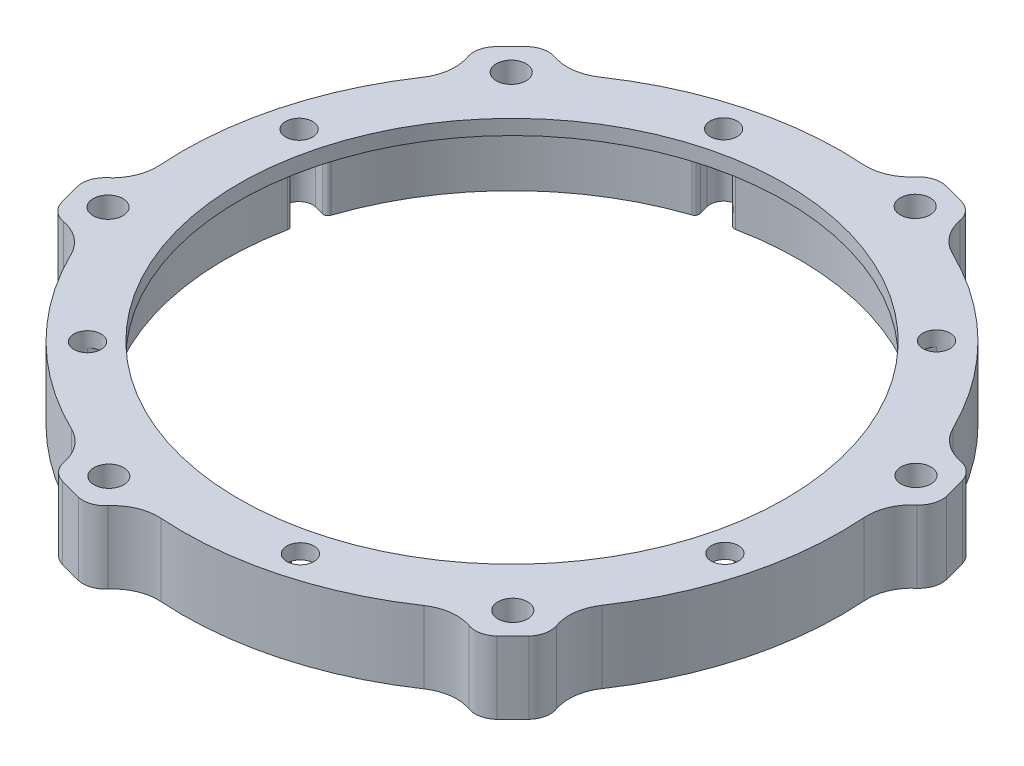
ISO-10303-21;
HEADER;
FILE_DESCRIPTION(('STEP AP214'),'2;1');
FILE_NAME('part.step','',(''),(''),'','','');
FILE_SCHEMA(('AUTOMOTIVE_DESIGN { 1 0 10303 214 1 1 1 1 }'));
ENDSEC;
DATA;
#1=APPLICATION_CONTEXT('core data for automotive mechanical design processes');
#2=APPLICATION_PROTOCOL_DEFINITION('international standard','automotive_design',2000,#1);
#3=PRODUCT_CONTEXT('',#1,'mechanical');
#4=PRODUCT('Part','Part','',(#3));
#5=PRODUCT_RELATED_PRODUCT_CATEGORY('part','',(#4));
#6=PRODUCT_DEFINITION_FORMATION('','',#4);
#7=PRODUCT_DEFINITION_CONTEXT('part definition',#1,'design');
#8=PRODUCT_DEFINITION('design','',#6,#7);
#9=PRODUCT_DEFINITION_SHAPE('','',#8);
#10=(LENGTH_UNIT() NAMED_UNIT(*) SI_UNIT(.MILLI.,.METRE.));
#11=(NAMED_UNIT(*) PLANE_ANGLE_UNIT() SI_UNIT($,.RADIAN.));
#12=(NAMED_UNIT(*) SI_UNIT($,.STERADIAN.) SOLID_ANGLE_UNIT());
#13=UNCERTAINTY_MEASURE_WITH_UNIT(LENGTH_MEASURE(1.E-05),#10,'distance_accuracy_value','');
#14=(GEOMETRIC_REPRESENTATION_CONTEXT(3) GLOBAL_UNCERTAINTY_ASSIGNED_CONTEXT((#13)) GLOBAL_UNIT_ASSIGNED_CONTEXT((#10,
#11,#12)) REPRESENTATION_CONTEXT('',''));
#15=CARTESIAN_POINT('',(0.,0.,0.));
#16=DIRECTION('',(0.,0.,1.));
#17=DIRECTION('',(1.,0.,0.));
#18=AXIS2_PLACEMENT_3D('',#15,#16,#17);
#19=CARTESIAN_POINT('',(1026.51465111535,1014.36700558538,1022.62067815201));
#20=DIRECTION('',(0.,1.,0.));
#21=DIRECTION('',(-0.966366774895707,0.,-0.257167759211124));
#22=AXIS2_PLACEMENT_3D('',#19,#20,#21);
#23=CYLINDRICAL_SURFACE('',#22,40.);
#24=CARTESIAN_POINT('',(1026.51465111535,1022.36700558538,1022.62067815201));
#25=DIRECTION('',(0.,1.,0.));
#26=DIRECTION('',(-0.966366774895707,0.,-0.257167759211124));
#27=AXIS2_PLACEMENT_3D('',#24,#25,#26);
#28=CIRCLE('',#27,40.);
#29=CARTESIAN_POINT('',(1038.00256944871,1022.36700558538,984.305828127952));
#30=VERTEX_POINT('',#29);
#31=CARTESIAN_POINT('',(1035.59013439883,1022.36700558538,983.66383532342));
#32=VERTEX_POINT('',#31);
#33=EDGE_CURVE('E1478',#30,#32,#28,.T.);
#34=ORIENTED_EDGE('',*,*,#33,.F.);
#35=DIRECTION('',(0.,-1.,0.));
#36=VECTOR('',#35,1.);
#37=CARTESIAN_POINT('',(1038.00256944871,1014.36700558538,984.305828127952));
#38=LINE('',#37,#36);
#39=CARTESIAN_POINT('',(1038.00256944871,1014.36700558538,984.305828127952));
#40=VERTEX_POINT('',#39);
#41=EDGE_CURVE('E795',#30,#40,#38,.T.);
#42=ORIENTED_EDGE('',*,*,#41,.T.);
#43=CARTESIAN_POINT('',(1026.51465111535,1014.36700558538,1022.62067815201));
#44=DIRECTION('',(0.,1.,0.));
#45=DIRECTION('',(-0.966366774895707,0.,-0.257167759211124));
#46=AXIS2_PLACEMENT_3D('',#43,#44,#45);
#47=CIRCLE('',#46,40.);
#48=CARTESIAN_POINT('',(1035.59013439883,1014.36700558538,983.66383532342));
#49=VERTEX_POINT('',#48);
#50=EDGE_CURVE('E1450',#40,#49,#47,.T.);
#51=ORIENTED_EDGE('',*,*,#50,.T.);
#52=DIRECTION('',(0.,1.,0.));
#53=VECTOR('',#52,1.);
#54=CARTESIAN_POINT('',(1035.59013439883,1014.36700558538,983.66383532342));
#55=LINE('',#54,#53);
#56=EDGE_CURVE('E655',#49,#32,#55,.T.);
#57=ORIENTED_EDGE('',*,*,#56,.T.);
#58=EDGE_LOOP('',(#34,#42,#51,#57));
#59=FACE_BOUND('',#58,.T.);
#60=ADVANCED_FACE('F17',(#59),#23,.T.);
#61=CARTESIAN_POINT('',(1026.51465111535,1014.36700558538,1022.62067815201));
#62=DIRECTION('',(0.,1.,0.));
#63=DIRECTION('',(-0.966366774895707,0.,-0.257167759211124));
#64=AXIS2_PLACEMENT_3D('',#61,#62,#63);
#65=CYLINDRICAL_SURFACE('',#64,40.);
#66=CARTESIAN_POINT('',(1026.51465111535,1014.36700558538,1022.62067815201));
#67=DIRECTION('',(0.,1.,0.));
#68=DIRECTION('',(-0.966366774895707,0.,-0.257167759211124));
#69=AXIS2_PLACEMENT_3D('',#66,#67,#68);
#70=CIRCLE('',#69,40.);
#71=CARTESIAN_POINT('',(999.076976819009,1014.36700558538,993.514424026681));
#72=VERTEX_POINT('',#71);
#73=CARTESIAN_POINT('',(997.314777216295,1014.36700558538,995.282657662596));
#74=VERTEX_POINT('',#73);
#75=EDGE_CURVE('E1454',#72,#74,#70,.T.);
#76=ORIENTED_EDGE('',*,*,#75,.T.);
#77=DIRECTION('',(0.,1.,0.));
#78=VECTOR('',#77,1.);
#79=CARTESIAN_POINT('',(997.314777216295,1014.36700558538,995.282657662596));
#80=LINE('',#79,#78);
#81=CARTESIAN_POINT('',(997.314777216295,1022.36700558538,995.282657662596));
#82=VERTEX_POINT('',#81);
#83=EDGE_CURVE('E975',#74,#82,#80,.T.);
#84=ORIENTED_EDGE('',*,*,#83,.T.);
#85=CARTESIAN_POINT('',(1026.51465111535,1022.36700558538,1022.62067815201));
#86=DIRECTION('',(0.,1.,0.));
#87=DIRECTION('',(-0.966366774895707,0.,-0.257167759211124));
#88=AXIS2_PLACEMENT_3D('',#85,#86,#87);
#89=CIRCLE('',#88,40.);
#90=CARTESIAN_POINT('',(999.076976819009,1022.36700558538,993.514424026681));
#91=VERTEX_POINT('',#90);
#92=EDGE_CURVE('E1466',#91,#82,#89,.T.);
#93=ORIENTED_EDGE('',*,*,#92,.F.);
#94=DIRECTION('',(0.,-1.,0.));
#95=VECTOR('',#94,1.);
#96=CARTESIAN_POINT('',(999.076976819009,1014.36700558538,993.514424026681));
#97=LINE('',#96,#95);
#98=EDGE_CURVE('E750',#91,#72,#97,.T.);
#99=ORIENTED_EDGE('',*,*,#98,.T.);
#100=EDGE_LOOP('',(#76,#84,#93,#99));
#101=FACE_BOUND('',#100,.T.);
#102=ADVANCED_FACE('F19',(#101),#65,.T.);
#103=CARTESIAN_POINT('',(1026.51465111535,1014.36700558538,1022.62067815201));
#104=DIRECTION('',(0.,1.,0.));
#105=DIRECTION('',(-0.966366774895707,0.,-0.257167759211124));
#106=AXIS2_PLACEMENT_3D('',#103,#104,#105);
#107=CYLINDRICAL_SURFACE('',#106,40.);
#108=CARTESIAN_POINT('',(1026.51465111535,1022.36700558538,1022.62067815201));
#109=DIRECTION('',(0.,1.,0.));
#110=DIRECTION('',(-0.966366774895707,0.,-0.257167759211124));
#111=AXIS2_PLACEMENT_3D('',#108,#109,#110);
#112=CIRCLE('',#111,40.);
#113=CARTESIAN_POINT('',(1015.02673278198,1022.36700558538,1060.93552817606));
#114=VERTEX_POINT('',#113);
#115=CARTESIAN_POINT('',(1017.43916783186,1022.36700558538,1061.57752098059));
#116=VERTEX_POINT('',#115);
#117=EDGE_CURVE('E1472',#114,#116,#112,.T.);
#118=ORIENTED_EDGE('',*,*,#117,.F.);
#119=DIRECTION('',(0.,-1.,0.));
#120=VECTOR('',#119,1.);
#121=CARTESIAN_POINT('',(1015.02673278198,1014.36700558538,1060.93552817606));
#122=LINE('',#121,#120);
#123=CARTESIAN_POINT('',(1015.02673278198,1014.36700558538,1060.93552817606));
#124=VERTEX_POINT('',#123);
#125=EDGE_CURVE('E765',#114,#124,#122,.T.);
#126=ORIENTED_EDGE('',*,*,#125,.T.);
#127=CARTESIAN_POINT('',(1026.51465111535,1014.36700558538,1022.62067815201));
#128=DIRECTION('',(0.,1.,0.));
#129=DIRECTION('',(-0.966366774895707,0.,-0.257167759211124));
#130=AXIS2_PLACEMENT_3D('',#127,#128,#129);
#131=CIRCLE('',#130,40.);
#132=CARTESIAN_POINT('',(1017.43916783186,1014.36700558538,1061.57752098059));
#133=VERTEX_POINT('',#132);
#134=EDGE_CURVE('E1485',#124,#133,#131,.T.);
#135=ORIENTED_EDGE('',*,*,#134,.T.);
#136=DIRECTION('',(0.,1.,0.));
#137=VECTOR('',#136,1.);
#138=CARTESIAN_POINT('',(1017.43916783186,1014.36700558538,1061.57752098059));
#139=LINE('',#138,#137);
#140=EDGE_CURVE('E789',#133,#116,#139,.T.);
#141=ORIENTED_EDGE('',*,*,#140,.T.);
#142=EDGE_LOOP('',(#118,#126,#135,#141));
#143=FACE_BOUND('',#142,.T.);
#144=ADVANCED_FACE('F3158',(#143),#107,.T.);
#145=CARTESIAN_POINT('',(1026.51465111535,1014.36700558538,1022.62067815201));
#146=DIRECTION('',(0.,1.,0.));
#147=DIRECTION('',(-0.966366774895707,0.,-0.257167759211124));
#148=AXIS2_PLACEMENT_3D('',#145,#146,#147);
#149=CYLINDRICAL_SURFACE('',#148,40.);
#150=CARTESIAN_POINT('',(1026.51465111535,1022.36700558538,1022.62067815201));
#151=DIRECTION('',(0.,1.,0.));
#152=DIRECTION('',(-0.966366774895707,0.,-0.257167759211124));
#153=AXIS2_PLACEMENT_3D('',#150,#151,#152);
#154=CIRCLE('',#153,40.);
#155=CARTESIAN_POINT('',(987.58905848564,1022.36700558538,1031.82927405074));
#156=VERTEX_POINT('',#155);
#157=CARTESIAN_POINT('',(988.239293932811,1022.36700558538,1034.23950049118));
#158=VERTEX_POINT('',#157);
#159=EDGE_CURVE('E1469',#156,#158,#154,.T.);
#160=ORIENTED_EDGE('',*,*,#159,.F.);
#161=DIRECTION('',(0.,-1.,0.));
#162=VECTOR('',#161,1.);
#163=CARTESIAN_POINT('',(987.58905848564,1014.36700558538,1031.82927405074));
#164=LINE('',#163,#162);
#165=CARTESIAN_POINT('',(987.58905848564,1014.36700558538,1031.82927405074));
#166=VERTEX_POINT('',#165);
#167=EDGE_CURVE('E661',#156,#166,#164,.T.);
#168=ORIENTED_EDGE('',*,*,#167,.T.);
#169=CARTESIAN_POINT('',(1026.51465111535,1014.36700558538,1022.62067815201));
#170=DIRECTION('',(0.,1.,0.));
#171=DIRECTION('',(-0.966366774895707,0.,-0.257167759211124));
#172=AXIS2_PLACEMENT_3D('',#169,#170,#171);
#173=CIRCLE('',#172,40.);
#174=CARTESIAN_POINT('',(988.239293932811,1014.36700558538,1034.23950049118));
#175=VERTEX_POINT('',#174);
#176=EDGE_CURVE('E26',#166,#175,#173,.T.);
#177=ORIENTED_EDGE('',*,*,#176,.T.);
#178=DIRECTION('',(0.,1.,0.));
#179=VECTOR('',#178,1.);
#180=CARTESIAN_POINT('',(988.239293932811,1014.36700558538,1034.23950049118));
#181=LINE('',#180,#179);
#182=EDGE_CURVE('E648',#175,#158,#181,.T.);
#183=ORIENTED_EDGE('',*,*,#182,.T.);
#184=EDGE_LOOP('',(#160,#168,#177,#183));
#185=FACE_BOUND('',#184,.T.);
#186=ADVANCED_FACE('F1491',(#185),#149,.T.);
#187=CARTESIAN_POINT('',(1026.51465111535,1014.36700558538,1022.62067815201));
#188=DIRECTION('',(0.,1.,0.));
#189=DIRECTION('',(-0.966366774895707,0.,-0.257167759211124));
#190=AXIS2_PLACEMENT_3D('',#187,#188,#189);
#191=CYLINDRICAL_SURFACE('',#190,40.);
#192=CARTESIAN_POINT('',(1026.51465111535,1022.36700558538,1022.62067815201));
#193=DIRECTION('',(0.,1.,0.));
#194=DIRECTION('',(-0.966366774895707,0.,-0.257167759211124));
#195=AXIS2_PLACEMENT_3D('',#192,#193,#194);
#196=CIRCLE('',#195,40.);
#197=CARTESIAN_POINT('',(1053.95232541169,1022.36700558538,1051.72693227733));
#198=VERTEX_POINT('',#197);
#199=CARTESIAN_POINT('',(1055.7145250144,1022.36700558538,1049.95869864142));
#200=VERTEX_POINT('',#199);
#201=EDGE_CURVE('E1475',#198,#200,#196,.T.);
#202=ORIENTED_EDGE('',*,*,#201,.F.);
#203=DIRECTION('',(0.,-1.,0.));
#204=VECTOR('',#203,1.);
#205=CARTESIAN_POINT('',(1053.95232541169,1014.36700558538,1051.72693227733));
#206=LINE('',#205,#204);
#207=CARTESIAN_POINT('',(1053.95232541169,1014.36700558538,1051.72693227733));
#208=VERTEX_POINT('',#207);
#209=EDGE_CURVE('E722',#198,#208,#206,.T.);
#210=ORIENTED_EDGE('',*,*,#209,.T.);
#211=CARTESIAN_POINT('',(1026.51465111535,1014.36700558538,1022.62067815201));
#212=DIRECTION('',(0.,1.,0.));
#213=DIRECTION('',(-0.966366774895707,0.,-0.257167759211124));
#214=AXIS2_PLACEMENT_3D('',#211,#212,#213);
#215=CIRCLE('',#214,40.);
#216=CARTESIAN_POINT('',(1055.7145250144,1014.36700558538,1049.95869864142));
#217=VERTEX_POINT('',#216);
#218=EDGE_CURVE('E1453',#208,#217,#215,.T.);
#219=ORIENTED_EDGE('',*,*,#218,.T.);
#220=DIRECTION('',(0.,1.,0.));
#221=VECTOR('',#220,1.);
#222=CARTESIAN_POINT('',(1055.7145250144,1014.36700558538,1049.95869864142));
#223=LINE('',#222,#221);
#224=EDGE_CURVE('E888',#217,#200,#223,.T.);
#225=ORIENTED_EDGE('',*,*,#224,.T.);
#226=EDGE_LOOP('',(#202,#210,#219,#225));
#227=FACE_BOUND('',#226,.T.);
#228=ADVANCED_FACE('F3228',(#227),#191,.T.);
#229=CARTESIAN_POINT('',(1026.51465111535,1014.36700558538,1022.62067815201));
#230=DIRECTION('',(0.,-1.,0.));
#231=DIRECTION('',(0.,0.,-1.));
#232=AXIS2_PLACEMENT_3D('',#229,#230,#231);
#233=PLANE('',#232);
#234=DIRECTION('',(0.705897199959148,0.,-0.708314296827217));
#235=VECTOR('',#234,1.);
#236=CARTESIAN_POINT('',(1025.4521796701,1014.36700558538,1021.56183235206));
#237=LINE('',#236,#235);
#238=CARTESIAN_POINT('',(1048.17354562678,1014.36700558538,998.762665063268));
#239=VERTEX_POINT('',#238);
#240=CARTESIAN_POINT('',(1048.92326156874,1014.36700558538,998.010381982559));
#241=VERTEX_POINT('',#240);
#242=EDGE_CURVE('E1147',#239,#241,#237,.T.);
#243=ORIENTED_EDGE('',*,*,#242,.F.);
#244=CARTESIAN_POINT('',(1047.81938847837,1014.36700558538,998.409716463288));
#245=DIRECTION('',(0.,-1.,0.));
#246=DIRECTION('',(0.966366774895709,0.,0.257167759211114));
#247=AXIS2_PLACEMENT_3D('',#244,#245,#246);
#248=CIRCLE('',#247,0.500000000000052);
#249=CARTESIAN_POINT('',(1047.48908247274,1014.36700558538,998.7850802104));
#250=VERTEX_POINT('',#249);
#251=EDGE_CURVE('E1301',#239,#250,#248,.T.);
#252=ORIENTED_EDGE('',*,*,#251,.T.);
#253=CARTESIAN_POINT('',(1026.51465111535,1014.36700558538,1022.62067815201));
#254=DIRECTION('',(0.,1.,0.));
#255=DIRECTION('',(-0.966366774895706,0.,-0.257167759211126));
#256=AXIS2_PLACEMENT_3D('',#253,#254,#255);
#257=CIRCLE('',#256,31.75);
#258=CARTESIAN_POINT('',(1020.16168683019,1014.36700558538,991.512763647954));
#259=VERTEX_POINT('',#258);
#260=EDGE_CURVE('E916',#250,#259,#257,.T.);
#261=ORIENTED_EDGE('',*,*,#260,.T.);
#262=CARTESIAN_POINT('',(1020.06164014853,1014.36700558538,991.022875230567));
#263=DIRECTION('',(0.,-1.,0.));
#264=DIRECTION('',(0.966366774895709,0.,0.257167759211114));
#265=AXIS2_PLACEMENT_3D('',#262,#263,#264);
#266=CIRCLE('',#265,0.500000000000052);
#267=CARTESIAN_POINT('',(1019.57889912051,1014.36700558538,991.153110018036));
#268=VERTEX_POINT('',#267);
#269=EDGE_CURVE('E712',#259,#268,#266,.T.);
#270=ORIENTED_EDGE('',*,*,#269,.T.);
#271=DIRECTION('',(0.260469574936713,0.,0.965482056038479));
#272=VECTOR('',#271,1.);
#273=CARTESIAN_POINT('',(1027.9628741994,1014.36700558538,1022.2299737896));
#274=LINE('',#273,#272);
#275=CARTESIAN_POINT('',(1019.30226083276,1014.36700558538,990.127695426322));
#276=VERTEX_POINT('',#275);
#277=EDGE_CURVE('E1396',#276,#268,#274,.T.);
#278=ORIENTED_EDGE('',*,*,#277,.F.);
#279=CARTESIAN_POINT('',(1017.8540377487,1014.36700558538,990.518399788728));
#280=DIRECTION('',(0.,-1.,0.));
#281=DIRECTION('',(0.966366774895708,0.,0.257167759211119));
#282=AXIS2_PLACEMENT_3D('',#279,#280,#281);
#283=CIRCLE('',#282,1.4999999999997);
#284=CARTESIAN_POINT('',(1016.40581466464,1014.36700558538,990.909104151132));
#285=VERTEX_POINT('',#284);
#286=EDGE_CURVE('E1411',#285,#276,#283,.T.);
#287=ORIENTED_EDGE('',*,*,#286,.F.);
#288=DIRECTION('',(-0.26046957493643,0.,-0.965482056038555));
#289=VECTOR('',#288,1.);
#290=CARTESIAN_POINT('',(1025.06642803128,1014.36700558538,1023.01138251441));
#291=LINE('',#290,#289);
#292=CARTESIAN_POINT('',(1016.68245295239,1014.36700558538,991.934518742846));
#293=VERTEX_POINT('',#292);
#294=EDGE_CURVE('E1388',#293,#285,#291,.T.);
#295=ORIENTED_EDGE('',*,*,#294,.F.);
#296=CARTESIAN_POINT('',(1016.19971192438,1014.36700558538,992.064753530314));
#297=DIRECTION('',(0.,-1.,0.));
#298=DIRECTION('',(0.966366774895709,0.,0.257167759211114));
#299=AXIS2_PLACEMENT_3D('',#296,#297,#298);
#300=CIRCLE('',#299,0.500000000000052);
#301=CARTESIAN_POINT('',(1016.35963346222,1014.36700558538,992.538488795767));
#302=VERTEX_POINT('',#301);
#303=EDGE_CURVE('E733',#293,#302,#300,.T.);
#304=ORIENTED_EDGE('',*,*,#303,.T.);
#305=CARTESIAN_POINT('',(1026.51465111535,1014.36700558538,1022.62067815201));
#306=DIRECTION('',(0.,1.,0.));
#307=DIRECTION('',(-0.966366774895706,0.,-0.257167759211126));
#308=AXIS2_PLACEMENT_3D('',#305,#306,#307);
#309=CIRCLE('',#308,31.75);
#310=CARTESIAN_POINT('',(996.397924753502,1014.36700558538,1012.56854936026));
#311=VERTEX_POINT('',#310);
#312=EDGE_CURVE('E844',#302,#311,#309,.T.);
#313=ORIENTED_EDGE('',*,*,#312,.T.);
#314=CARTESIAN_POINT('',(995.923645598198,1014.36700558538,1012.41024811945));
#315=DIRECTION('',(0.,-1.,0.));
#316=DIRECTION('',(0.966366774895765,0.,0.257167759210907));
#317=AXIS2_PLACEMENT_3D('',#314,#315,#316);
#318=CIRCLE('',#317,0.500000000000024);
#319=CARTESIAN_POINT('',(995.795061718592,1014.36700558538,1012.8934315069));
#320=VERTEX_POINT('',#319);
#321=EDGE_CURVE('E1171',#311,#320,#318,.T.);
#322=ORIENTED_EDGE('',*,*,#321,.T.);
#323=DIRECTION('',(0.966366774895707,0.,0.257167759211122));
#324=VECTOR('',#323,1.);
#325=CARTESIAN_POINT('',(1026.90040275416,1014.36700558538,1021.17112798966));
#326=LINE('',#325,#324);
#327=CARTESIAN_POINT('',(994.768707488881,1014.36700558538,1012.62029999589));
#328=VERTEX_POINT('',#327);
#329=EDGE_CURVE('E1424',#328,#320,#326,.T.);
#330=ORIENTED_EDGE('',*,*,#329,.F.);
#331=CARTESIAN_POINT('',(994.382955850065,1014.36700558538,1014.06985015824));
#332=DIRECTION('',(0.,-1.,0.));
#333=DIRECTION('',(0.966366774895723,0.,0.257167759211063));
#334=AXIS2_PLACEMENT_3D('',#331,#332,#333);
#335=CIRCLE('',#334,1.5);
#336=CARTESIAN_POINT('',(993.997204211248,1014.36700558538,1015.51940032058));
#337=VERTEX_POINT('',#336);
#338=EDGE_CURVE('E702',#337,#328,#335,.T.);
#339=ORIENTED_EDGE('',*,*,#338,.F.);
#340=DIRECTION('',(0.966366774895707,0.,0.257167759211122));
#341=VECTOR('',#340,1.);
#342=CARTESIAN_POINT('',(1026.12889947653,1014.36700558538,1024.07022831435));
#343=LINE('',#342,#341);
#344=CARTESIAN_POINT('',(995.023558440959,1014.36700558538,1015.79253183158));
#345=VERTEX_POINT('',#344);
#346=EDGE_CURVE('E1245',#337,#345,#343,.T.);
#347=ORIENTED_EDGE('',*,*,#346,.T.);
#348=CARTESIAN_POINT('',(994.894974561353,1014.36700558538,1016.27571521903));
#349=DIRECTION('',(0.,-1.,0.));
#350=DIRECTION('',(0.966366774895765,0.,0.257167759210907));
#351=AXIS2_PLACEMENT_3D('',#348,#349,#350);
#352=CIRCLE('',#351,0.500000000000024);
#353=CARTESIAN_POINT('',(995.385202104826,1014.36700558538,1016.37408673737));
#354=VERTEX_POINT('',#353);
#355=EDGE_CURVE('E1155',#345,#354,#352,.T.);
#356=ORIENTED_EDGE('',*,*,#355,.T.);
#357=CARTESIAN_POINT('',(1026.51465111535,1014.36700558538,1022.62067815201));
#358=DIRECTION('',(0.,1.,0.));
#359=DIRECTION('',(-0.966366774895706,0.,-0.257167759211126));
#360=AXIS2_PLACEMENT_3D('',#357,#358,#359);
#361=CIRCLE('',#360,31.75);
#362=CARTESIAN_POINT('',(1002.75088903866,1014.36700558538,1043.67646386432));
#363=VERTEX_POINT('',#362);
#364=EDGE_CURVE('E1036',#354,#363,#361,.T.);
#365=ORIENTED_EDGE('',*,*,#364,.T.);
#366=CARTESIAN_POINT('',(1002.37665656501,1014.36700558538,1044.00805104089));
#367=DIRECTION('',(0.,-1.,0.));
#368=DIRECTION('',(0.966366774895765,0.,0.257167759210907));
#369=AXIS2_PLACEMENT_3D('',#366,#367,#368);
#370=CIRCLE('',#369,0.500000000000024);
#371=CARTESIAN_POINT('',(1002.73081371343,1014.36700558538,1044.36099964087));
#372=VERTEX_POINT('',#371);
#373=EDGE_CURVE('E832',#363,#372,#370,.T.);
#374=ORIENTED_EDGE('',*,*,#373,.T.);
#375=DIRECTION('',(0.705897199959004,0.,-0.70831429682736));
#376=VECTOR('',#375,1.);
#377=CARTESIAN_POINT('',(1025.45217967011,1014.36700558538,1021.56183235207));
#378=LINE('',#377,#376);
#379=CARTESIAN_POINT('',(1001.98109777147,1014.36700558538,1045.11328272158));
#380=VERTEX_POINT('',#379);
#381=EDGE_CURVE('E1212',#380,#372,#378,.T.);
#382=ORIENTED_EDGE('',*,*,#381,.F.);
#383=CARTESIAN_POINT('',(1003.04356921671,1014.36700558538,1046.17212852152));
#384=DIRECTION('',(0.,-1.,0.));
#385=DIRECTION('',(0.966366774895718,0.,0.257167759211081));
#386=AXIS2_PLACEMENT_3D('',#383,#384,#385);
#387=CIRCLE('',#386,1.49999999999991);
#388=CARTESIAN_POINT('',(1004.10604066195,1014.36700558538,1047.23097432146));
#389=VERTEX_POINT('',#388);
#390=EDGE_CURVE('E1015',#389,#380,#387,.T.);
#391=ORIENTED_EDGE('',*,*,#390,.F.);
#392=DIRECTION('',(-0.705897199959,0.,0.708314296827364));
#393=VECTOR('',#392,1.);
#394=CARTESIAN_POINT('',(1027.57712256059,1014.36700558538,1023.67952395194));
#395=LINE('',#394,#393);
#396=CARTESIAN_POINT('',(1004.85575660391,1014.36700558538,1046.47869124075));
#397=VERTEX_POINT('',#396);
#398=EDGE_CURVE('E1381',#397,#389,#395,.T.);
#399=ORIENTED_EDGE('',*,*,#398,.F.);
#400=CARTESIAN_POINT('',(1005.20991375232,1014.36700558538,1046.83163984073));
#401=DIRECTION('',(0.,-1.,0.));
#402=DIRECTION('',(0.966366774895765,0.,0.257167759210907));
#403=AXIS2_PLACEMENT_3D('',#400,#401,#402);
#404=CIRCLE('',#403,0.500000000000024);
#405=CARTESIAN_POINT('',(1005.54021975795,1014.36700558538,1046.45627609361));
#406=VERTEX_POINT('',#405);
#407=EDGE_CURVE('E1198',#397,#406,#404,.T.);
#408=ORIENTED_EDGE('',*,*,#407,.T.);
#409=CARTESIAN_POINT('',(1026.51465111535,1014.36700558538,1022.62067815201));
#410=DIRECTION('',(0.,1.,0.));
#411=DIRECTION('',(-0.966366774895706,0.,-0.257167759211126));
#412=AXIS2_PLACEMENT_3D('',#409,#410,#411);
#413=CIRCLE('',#412,31.75);
#414=CARTESIAN_POINT('',(1032.86761540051,1014.36700558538,1053.72859265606));
#415=VERTEX_POINT('',#414);
#416=EDGE_CURVE('E920',#406,#415,#413,.T.);
#417=ORIENTED_EDGE('',*,*,#416,.T.);
#418=CARTESIAN_POINT('',(1032.96766208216,1014.36700558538,1054.21848107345));
#419=DIRECTION('',(0.,-1.,0.));
#420=DIRECTION('',(0.966366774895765,0.,0.257167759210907));
#421=AXIS2_PLACEMENT_3D('',#418,#419,#420);
#422=CIRCLE('',#421,0.500000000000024);
#423=CARTESIAN_POINT('',(1033.45040311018,1014.36700558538,1054.08824628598));
#424=VERTEX_POINT('',#423);
#425=EDGE_CURVE('E1285',#415,#424,#422,.T.);
#426=ORIENTED_EDGE('',*,*,#425,.T.);
#427=DIRECTION('',(-0.260469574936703,0.,-0.965482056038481));
#428=VECTOR('',#427,1.);
#429=CARTESIAN_POINT('',(1025.06642803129,1014.36700558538,1023.01138251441));
#430=LINE('',#429,#428);
#431=CARTESIAN_POINT('',(1033.72704139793,1014.36700558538,1055.11366087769));
#432=VERTEX_POINT('',#431);
#433=EDGE_CURVE('E1345',#432,#424,#430,.T.);
#434=ORIENTED_EDGE('',*,*,#433,.F.);
#435=CARTESIAN_POINT('',(1035.17526448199,1014.36700558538,1054.72295651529));
#436=DIRECTION('',(0.,-1.,0.));
#437=DIRECTION('',(0.966366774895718,0.,0.257167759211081));
#438=AXIS2_PLACEMENT_3D('',#435,#436,#437);
#439=CIRCLE('',#438,1.49999999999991);
#440=CARTESIAN_POINT('',(1036.62348756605,1014.36700558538,1054.33225215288));
#441=VERTEX_POINT('',#440);
#442=EDGE_CURVE('E1119',#441,#432,#439,.T.);
#443=ORIENTED_EDGE('',*,*,#442,.F.);
#444=DIRECTION('',(0.260469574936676,0.,0.965482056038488));
#445=VECTOR('',#444,1.);
#446=CARTESIAN_POINT('',(1027.96287419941,1014.36700558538,1022.2299737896));
#447=LINE('',#446,#445);
#448=CARTESIAN_POINT('',(1036.3468492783,1014.36700558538,1053.30683756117));
#449=VERTEX_POINT('',#448);
#450=EDGE_CURVE('E804',#449,#441,#447,.T.);
#451=ORIENTED_EDGE('',*,*,#450,.F.);
#452=CARTESIAN_POINT('',(1036.82959030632,1014.36700558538,1053.1766027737));
#453=DIRECTION('',(0.,-1.,0.));
#454=DIRECTION('',(0.966366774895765,0.,0.257167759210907));
#455=AXIS2_PLACEMENT_3D('',#452,#453,#454);
#456=CIRCLE('',#455,0.500000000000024);
#457=CARTESIAN_POINT('',(1036.66966876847,1014.36700558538,1052.70286750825));
#458=VERTEX_POINT('',#457);
#459=EDGE_CURVE('E1231',#449,#458,#456,.T.);
#460=ORIENTED_EDGE('',*,*,#459,.T.);
#461=CARTESIAN_POINT('',(1026.51465111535,1014.36700558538,1022.62067815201));
#462=DIRECTION('',(0.,1.,0.));
#463=DIRECTION('',(-0.966366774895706,0.,-0.257167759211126));
#464=AXIS2_PLACEMENT_3D('',#461,#462,#463);
#465=CIRCLE('',#464,31.75);
#466=CARTESIAN_POINT('',(1056.63137747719,1014.36700558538,1032.67280694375));
#467=VERTEX_POINT('',#466);
#468=EDGE_CURVE('E1459',#458,#467,#465,.T.);
#469=ORIENTED_EDGE('',*,*,#468,.T.);
#470=CARTESIAN_POINT('',(1057.1056566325,1014.36700558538,1032.83110818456));
#471=DIRECTION('',(0.,-1.,0.));
#472=DIRECTION('',(0.966366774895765,0.,0.257167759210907));
#473=AXIS2_PLACEMENT_3D('',#470,#471,#472);
#474=CIRCLE('',#473,0.500000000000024);
#475=CARTESIAN_POINT('',(1057.2342405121,1014.36700558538,1032.34792479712));
#476=VERTEX_POINT('',#475);
#477=EDGE_CURVE('E1232',#467,#476,#474,.T.);
#478=ORIENTED_EDGE('',*,*,#477,.T.);
#479=DIRECTION('',(-0.966366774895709,0.,-0.257167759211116));
#480=VECTOR('',#479,1.);
#481=CARTESIAN_POINT('',(1026.12889947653,1014.36700558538,1024.07022831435));
#482=LINE('',#481,#480);
#483=CARTESIAN_POINT('',(1058.26059474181,1014.36700558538,1032.62105630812));
#484=VERTEX_POINT('',#483);
#485=EDGE_CURVE('E1185',#484,#476,#482,.T.);
#486=ORIENTED_EDGE('',*,*,#485,.F.);
#487=CARTESIAN_POINT('',(1058.64634638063,1014.36700558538,1031.17150614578));
#488=DIRECTION('',(0.,-1.,0.));
#489=DIRECTION('',(0.966366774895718,0.,0.257167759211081));
#490=AXIS2_PLACEMENT_3D('',#487,#488,#489);
#491=CIRCLE('',#490,1.49999999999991);
#492=CARTESIAN_POINT('',(1059.03209801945,1014.36700558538,1029.72195598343));
#493=VERTEX_POINT('',#492);
#494=EDGE_CURVE('E679',#493,#484,#491,.T.);
#495=ORIENTED_EDGE('',*,*,#494,.F.);
#496=DIRECTION('',(0.966366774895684,0.,0.25716775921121));
#497=VECTOR('',#496,1.);
#498=CARTESIAN_POINT('',(1026.90040275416,1014.36700558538,1021.17112798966));
#499=LINE('',#498,#497);
#500=CARTESIAN_POINT('',(1058.00574378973,1014.36700558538,1029.44882447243));
#501=VERTEX_POINT('',#500);
#502=EDGE_CURVE('E1186',#501,#493,#499,.T.);
#503=ORIENTED_EDGE('',*,*,#502,.F.);
#504=CARTESIAN_POINT('',(1058.13432766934,1014.36700558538,1028.96564108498));
#505=DIRECTION('',(0.,-1.,0.));
#506=DIRECTION('',(0.966366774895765,0.,0.257167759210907));
#507=AXIS2_PLACEMENT_3D('',#504,#505,#506);
#508=CIRCLE('',#507,0.500000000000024);
#509=CARTESIAN_POINT('',(1057.64410012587,1014.36700558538,1028.86726956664));
#510=VERTEX_POINT('',#509);
#511=EDGE_CURVE('E1240',#501,#510,#508,.T.);
#512=ORIENTED_EDGE('',*,*,#511,.T.);
#513=CARTESIAN_POINT('',(1026.51465111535,1014.36700558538,1022.62067815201));
#514=DIRECTION('',(0.,1.,0.));
#515=DIRECTION('',(-0.966366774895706,0.,-0.257167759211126));
#516=AXIS2_PLACEMENT_3D('',#513,#514,#515);
#517=CIRCLE('',#516,31.75);
#518=CARTESIAN_POINT('',(1050.27841319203,1014.36700558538,1001.5648924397));
#519=VERTEX_POINT('',#518);
#520=EDGE_CURVE('E919',#510,#519,#517,.T.);
#521=ORIENTED_EDGE('',*,*,#520,.T.);
#522=CARTESIAN_POINT('',(1050.65264566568,1014.36700558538,1001.23330526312));
#523=DIRECTION('',(0.,-1.,0.));
#524=DIRECTION('',(0.966366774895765,0.,0.257167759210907));
#525=AXIS2_PLACEMENT_3D('',#522,#523,#524);
#526=CIRCLE('',#525,0.500000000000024);
#527=CARTESIAN_POINT('',(1050.29848851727,1014.36700558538,1000.88035666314));
#528=VERTEX_POINT('',#527);
#529=EDGE_CURVE('E1137',#519,#528,#526,.T.);
#530=ORIENTED_EDGE('',*,*,#529,.T.);
#531=DIRECTION('',(-0.705897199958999,0.,0.708314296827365));
#532=VECTOR('',#531,1.);
#533=CARTESIAN_POINT('',(1027.57712256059,1014.36700558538,1023.67952395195));
#534=LINE('',#533,#532);
#535=CARTESIAN_POINT('',(1051.04820445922,1014.36700558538,1000.12807358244));
#536=VERTEX_POINT('',#535);
#537=EDGE_CURVE('E1146',#536,#528,#534,.T.);
#538=ORIENTED_EDGE('',*,*,#537,.F.);
#539=CARTESIAN_POINT('',(1049.98573301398,1014.36700558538,999.069227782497));
#540=DIRECTION('',(0.,-1.,0.));
#541=DIRECTION('',(0.966366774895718,0.,0.257167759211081));
#542=AXIS2_PLACEMENT_3D('',#539,#540,#541);
#543=CIRCLE('',#542,1.49999999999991);
#544=EDGE_CURVE('E670',#241,#536,#543,.T.);
#545=ORIENTED_EDGE('',*,*,#544,.F.);
#546=EDGE_LOOP('',(#243,#252,#261,#270,#278,#287,#295,#304,#313,#322,#330,#339,#347,#356,#365,
#374,#382,#391,#399,#408,#417,#426,#434,#443,#451,#460,#469,#478,#486,#495,#503,#512,#521,#530,
#538,#545));
#547=FACE_BOUND('',#546,.T.);
#548=CARTESIAN_POINT('',(1052.36812294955,1014.36700558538,1048.38592595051));
#549=DIRECTION('',(0.,-1.,0.));
#550=DIRECTION('',(0.966366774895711,0.,0.257167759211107));
#551=AXIS2_PLACEMENT_3D('',#548,#549,#550);
#552=CIRCLE('',#551,1.64999999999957);
#553=CARTESIAN_POINT('',(1053.96262812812,1014.36700558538,1048.81025275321));
#554=VERTEX_POINT('',#553);
#555=EDGE_CURVE('E662',#554,#554,#552,.T.);
#556=ORIENTED_EDGE('',*,*,#555,.F.);
#557=EDGE_LOOP('',(#556));
#558=FACE_BOUND('',#557,.T.);
#559=CARTESIAN_POINT('',(1017.12802790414,1014.36700558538,1057.8930654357));
#560=DIRECTION('',(0.,-1.,0.));
#561=DIRECTION('',(0.966366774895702,0.,0.25716775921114));
#562=AXIS2_PLACEMENT_3D('',#559,#560,#561);
#563=CIRCLE('',#562,1.64999999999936);
#564=CARTESIAN_POINT('',(1018.72253308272,1014.36700558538,1058.3173922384));
#565=VERTEX_POINT('',#564);
#566=EDGE_CURVE('E1050',#565,#565,#563,.T.);
#567=ORIENTED_EDGE('',*,*,#566,.F.);
#568=EDGE_LOOP('',(#567));
#569=FACE_BOUND('',#568,.T.);
#570=CARTESIAN_POINT('',(991.274556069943,1014.36700558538,1032.1278176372));
#571=DIRECTION('',(0.,-1.,0.));
#572=DIRECTION('',(0.966366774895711,0.,0.257167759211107));
#573=AXIS2_PLACEMENT_3D('',#570,#571,#572);
#574=CIRCLE('',#573,1.64999999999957);
#575=CARTESIAN_POINT('',(992.869061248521,1014.36700558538,1032.55214443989));
#576=VERTEX_POINT('',#575);
#577=EDGE_CURVE('E1083',#576,#576,#574,.T.);
#578=ORIENTED_EDGE('',*,*,#577,.F.);
#579=EDGE_LOOP('',(#578));
#580=FACE_BOUND('',#579,.T.);
#581=CARTESIAN_POINT('',(1000.66117928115,1014.36700558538,996.855430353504));
#582=DIRECTION('',(0.,-1.,0.));
#583=DIRECTION('',(0.966366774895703,0.,0.257167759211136));
#584=AXIS2_PLACEMENT_3D('',#581,#582,#583);
#585=CIRCLE('',#584,1.64999999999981);
#586=CARTESIAN_POINT('',(1002.25568445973,1014.36700558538,997.279757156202));
#587=VERTEX_POINT('',#586);
#588=EDGE_CURVE('E1002',#587,#587,#585,.T.);
#589=ORIENTED_EDGE('',*,*,#588,.F.);
#590=EDGE_LOOP('',(#589));
#591=FACE_BOUND('',#590,.T.);
#592=CARTESIAN_POINT('',(1035.90127432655,1014.36700558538,987.348290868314));
#593=DIRECTION('',(0.,-1.,0.));
#594=DIRECTION('',(0.966366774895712,0.,0.257167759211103));
#595=AXIS2_PLACEMENT_3D('',#592,#593,#594);
#596=CIRCLE('',#595,1.65000000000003);
#597=CARTESIAN_POINT('',(1037.49577950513,1014.36700558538,987.772617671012));
#598=VERTEX_POINT('',#597);
#599=EDGE_CURVE('E866',#598,#598,#596,.T.);
#600=ORIENTED_EDGE('',*,*,#599,.F.);
#601=EDGE_LOOP('',(#600));
#602=FACE_BOUND('',#601,.T.);
#603=CARTESIAN_POINT('',(1061.75474616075,1014.36700558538,1013.11353866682));
#604=DIRECTION('',(0.,-1.,0.));
#605=DIRECTION('',(0.96636677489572,0.,0.257167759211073));
#606=AXIS2_PLACEMENT_3D('',#603,#604,#605);
#607=CIRCLE('',#606,1.64999999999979);
#608=CARTESIAN_POINT('',(1063.34925133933,1014.36700558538,1013.53786546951));
#609=VERTEX_POINT('',#608);
#610=EDGE_CURVE('E683',#609,#609,#607,.T.);
#611=ORIENTED_EDGE('',*,*,#610,.F.);
#612=EDGE_LOOP('',(#611));
#613=FACE_BOUND('',#612,.T.);
#614=CARTESIAN_POINT('',(1026.51465111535,1014.36700558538,1022.62067815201));
#615=DIRECTION('',(0.,-1.,0.));
#616=DIRECTION('',(0.966366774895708,0.,0.25716775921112));
#617=AXIS2_PLACEMENT_3D('',#614,#615,#616);
#618=CIRCLE('',#617,36.5);
#619=CARTESIAN_POINT('',(990.107398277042,1014.36700558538,1025.22105134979));
#620=VERTEX_POINT('',#619);
#621=CARTESIAN_POINT('',(996.215485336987,1014.36700558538,1002.26851479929));
#622=VERTEX_POINT('',#621);
#623=EDGE_CURVE('E941',#620,#622,#618,.T.);
#624=ORIENTED_EDGE('',*,*,#623,.T.);
#625=CARTESIAN_POINT('',(992.064914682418,1014.36700558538,999.480547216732));
#626=DIRECTION('',(0.,1.,0.));
#627=DIRECTION('',(0.966366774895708,0.,0.257167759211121));
#628=AXIS2_PLACEMENT_3D('',#625,#626,#627);
#629=CIRCLE('',#628,5.);
#630=CARTESIAN_POINT('',(996.781484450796,1014.36700558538,997.8210383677));
#631=VERTEX_POINT('',#630);
#632=EDGE_CURVE('E39',#622,#631,#629,.T.);
#633=ORIENTED_EDGE('',*,*,#632,.T.);
#634=CARTESIAN_POINT('',(999.139769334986,1014.36700558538,996.991283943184));
#635=DIRECTION('',(0.,-1.,0.));
#636=DIRECTION('',(0.966366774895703,0.,0.257167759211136));
#637=AXIS2_PLACEMENT_3D('',#634,#635,#636);
#638=CIRCLE('',#637,2.50000000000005);
#639=EDGE_CURVE('E837',#631,#74,#638,.T.);
#640=ORIENTED_EDGE('',*,*,#639,.T.);
#641=ORIENTED_EDGE('',*,*,#75,.F.);
#642=CARTESIAN_POINT('',(1000.79183146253,1014.36700558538,995.333564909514));
#643=DIRECTION('',(0.,-1.,0.));
#644=DIRECTION('',(0.966366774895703,0.,0.257167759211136));
#645=AXIS2_PLACEMENT_3D('',#642,#643,#644);
#646=CIRCLE('',#645,2.50000000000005);
#647=CARTESIAN_POINT('',(1001.6135197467,1014.36700558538,992.972457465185));
#648=VERTEX_POINT('',#647);
#649=EDGE_CURVE('E727',#72,#648,#646,.T.);
#650=ORIENTED_EDGE('',*,*,#649,.T.);
#651=CARTESIAN_POINT('',(1003.25689631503,1014.36700558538,988.250242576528));
#652=DIRECTION('',(0.,1.,0.));
#653=DIRECTION('',(0.966366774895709,0.,0.257167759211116));
#654=AXIS2_PLACEMENT_3D('',#651,#652,#653);
#655=CIRCLE('',#654,5.00000000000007);
#656=CARTESIAN_POINT('',(1006.0590354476,1014.36700558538,992.391258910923));
#657=VERTEX_POINT('',#656);
#658=EDGE_CURVE('E972',#648,#657,#655,.T.);
#659=ORIENTED_EDGE('',*,*,#658,.T.);
#660=CARTESIAN_POINT('',(1026.51465111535,1014.36700558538,1022.62067815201));
#661=DIRECTION('',(0.,-1.,0.));
#662=DIRECTION('',(0.966366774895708,0.,0.25716775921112));
#663=AXIS2_PLACEMENT_3D('',#660,#661,#662);
#664=CIRCLE('',#663,36.5);
#665=CARTESIAN_POINT('',(1028.99055871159,1014.36700558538,986.204749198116));
#666=VERTEX_POINT('',#665);
#667=EDGE_CURVE('E929',#657,#666,#664,.T.);
#668=ORIENTED_EDGE('',*,*,#667,.T.);
#669=CARTESIAN_POINT('',(1029.32972413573,1014.36700558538,981.216265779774));
#670=DIRECTION('',(0.,1.,0.));
#671=DIRECTION('',(0.966366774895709,0.,0.257167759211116));
#672=AXIS2_PLACEMENT_3D('',#669,#670,#671);
#673=CIRCLE('',#672,5.00000000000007);
#674=CARTESIAN_POINT('',(1033.12518584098,1014.36700558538,984.471180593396));
#675=VERTEX_POINT('',#674);
#676=EDGE_CURVE('E738',#666,#675,#673,.T.);
#677=ORIENTED_EDGE('',*,*,#676,.T.);
#678=CARTESIAN_POINT('',(1035.02291669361,1014.36700558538,986.098638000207));
#679=DIRECTION('',(0.,-1.,0.));
#680=DIRECTION('',(0.966366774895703,0.,0.257167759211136));
#681=AXIS2_PLACEMENT_3D('',#678,#679,#680);
#682=CIRCLE('',#681,2.50000000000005);
#683=EDGE_CURVE('E689',#675,#49,#682,.T.);
#684=ORIENTED_EDGE('',*,*,#683,.T.);
#685=ORIENTED_EDGE('',*,*,#50,.F.);
#686=CARTESIAN_POINT('',(1037.28457455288,1014.36700558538,986.700506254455));
#687=DIRECTION('',(0.,-1.,0.));
#688=DIRECTION('',(0.966366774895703,0.,0.257167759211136));
#689=AXIS2_PLACEMENT_3D('',#686,#687,#688);
#690=CIRCLE('',#689,2.50000000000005);
#691=CARTESIAN_POINT('',(1039.74019772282,1014.36700558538,986.23155546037));
#692=VERTEX_POINT('',#691);
#693=EDGE_CURVE('E791',#40,#692,#690,.T.);
#694=ORIENTED_EDGE('',*,*,#693,.T.);
#695=CARTESIAN_POINT('',(1044.65144406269,1014.36700558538,985.2936538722));
#696=DIRECTION('',(0.,1.,0.));
#697=DIRECTION('',(0.966366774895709,0.,0.257167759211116));
#698=AXIS2_PLACEMENT_3D('',#695,#696,#697);
#699=CIRCLE('',#698,5.00000000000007);
#700=CARTESIAN_POINT('',(1042.4662882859,1014.36700558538,989.790885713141));
#701=VERTEX_POINT('',#700);
#702=EDGE_CURVE('E996',#692,#701,#699,.T.);
#703=ORIENTED_EDGE('',*,*,#702,.T.);
#704=CARTESIAN_POINT('',(1026.51465111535,1014.36700558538,1022.62067815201));
#705=DIRECTION('',(0.,-1.,0.));
#706=DIRECTION('',(0.966366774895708,0.,0.25716775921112));
#707=AXIS2_PLACEMENT_3D('',#704,#705,#706);
#708=CIRCLE('',#707,36.5);
#709=CARTESIAN_POINT('',(1059.28972448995,1014.36700558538,1006.55691255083));
#710=VERTEX_POINT('',#709);
#711=EDGE_CURVE('E1007',#701,#710,#708,.T.);
#712=ORIENTED_EDGE('',*,*,#711,.T.);
#713=CARTESIAN_POINT('',(1063.77946056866,1014.36700558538,1004.35639671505));
#714=DIRECTION('',(0.,1.,0.));
#715=DIRECTION('',(0.966366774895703,0.,0.257167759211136));
#716=AXIS2_PLACEMENT_3D('',#713,#714,#715);
#717=CIRCLE('',#716,5.0000000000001);
#718=CARTESIAN_POINT('',(1062.85835250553,1014.36700558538,1009.2708203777));
#719=VERTEX_POINT('',#718);
#720=EDGE_CURVE('E1014',#710,#719,#717,.T.);
#721=ORIENTED_EDGE('',*,*,#720,.T.);
#722=CARTESIAN_POINT('',(1062.39779847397,1014.36700558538,1011.72803220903));
#723=DIRECTION('',(0.,-1.,0.));
#724=DIRECTION('',(0.966366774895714,0.,0.257167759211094));
#725=AXIS2_PLACEMENT_3D('',#722,#723,#724);
#726=CIRCLE('',#725,2.5);
#727=CARTESIAN_POINT('',(1064.79000829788,1014.36700558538,1011.00185581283));
#728=VERTEX_POINT('',#727);
#729=EDGE_CURVE('E820',#719,#728,#726,.T.);
#730=ORIENTED_EDGE('',*,*,#729,.T.);
#731=CARTESIAN_POINT('',(1026.51465111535,1014.36700558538,1022.62067815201));
#732=DIRECTION('',(0.,1.,0.));
#733=DIRECTION('',(-0.966366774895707,0.,-0.257167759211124));
#734=AXIS2_PLACEMENT_3D('',#731,#732,#733);
#735=CIRCLE('',#734,40.);
#736=CARTESIAN_POINT('',(1065.44024374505,1014.36700558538,1013.41208225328));
#737=VERTEX_POINT('',#736);
#738=EDGE_CURVE('E755',#737,#728,#735,.T.);
#739=ORIENTED_EDGE('',*,*,#738,.F.);
#740=CARTESIAN_POINT('',(1063.0073942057,1014.36700558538,1013.98761949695));
#741=DIRECTION('',(0.,-1.,0.));
#742=DIRECTION('',(0.966366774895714,0.,0.257167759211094));
#743=AXIS2_PLACEMENT_3D('',#740,#741,#742);
#744=CIRCLE('',#743,2.5);
#745=CARTESIAN_POINT('',(1064.64132909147,1014.36700558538,1015.87977614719));
#746=VERTEX_POINT('',#745);
#747=EDGE_CURVE('E766',#737,#746,#744,.T.);
#748=ORIENTED_EDGE('',*,*,#747,.T.);
#749=CARTESIAN_POINT('',(1067.90919886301,1014.36700558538,1019.66408944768));
#750=DIRECTION('',(0.,1.,0.));
#751=DIRECTION('',(0.966366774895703,0.,0.257167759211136));
#752=AXIS2_PLACEMENT_3D('',#749,#750,#751);
#753=CIRCLE('',#752,5.0000000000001);
#754=CARTESIAN_POINT('',(1062.92190395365,1014.36700558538,1020.02030495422));
#755=VERTEX_POINT('',#754);
#756=EDGE_CURVE('E1029',#746,#755,#753,.T.);
#757=ORIENTED_EDGE('',*,*,#756,.T.);
#758=CARTESIAN_POINT('',(1026.51465111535,1014.36700558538,1022.62067815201));
#759=DIRECTION('',(0.,-1.,0.));
#760=DIRECTION('',(0.966366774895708,0.,0.25716775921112));
#761=AXIS2_PLACEMENT_3D('',#758,#759,#760);
#762=CIRCLE('',#761,36.5);
#763=CARTESIAN_POINT('',(1056.81381689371,1014.36700558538,1042.97284150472));
#764=VERTEX_POINT('',#763);
#765=EDGE_CURVE('E1039',#755,#764,#762,.T.);
#766=ORIENTED_EDGE('',*,*,#765,.T.);
#767=CARTESIAN_POINT('',(1060.96438754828,1014.36700558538,1045.76080908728));
#768=DIRECTION('',(0.,1.,0.));
#769=DIRECTION('',(0.966366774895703,0.,0.257167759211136));
#770=AXIS2_PLACEMENT_3D('',#767,#768,#769);
#771=CIRCLE('',#770,5.0000000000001);
#772=CARTESIAN_POINT('',(1056.2478177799,1014.36700558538,1047.42031793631));
#773=VERTEX_POINT('',#772);
#774=EDGE_CURVE('E878',#764,#773,#771,.T.);
#775=ORIENTED_EDGE('',*,*,#774,.T.);
#776=CARTESIAN_POINT('',(1053.88953289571,1014.36700558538,1048.25007236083));
#777=DIRECTION('',(0.,-1.,0.));
#778=DIRECTION('',(0.966366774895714,0.,0.257167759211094));
#779=AXIS2_PLACEMENT_3D('',#776,#777,#778);
#780=CIRCLE('',#779,2.5);
#781=EDGE_CURVE('E723',#773,#217,#780,.T.);
#782=ORIENTED_EDGE('',*,*,#781,.T.);
#783=ORIENTED_EDGE('',*,*,#218,.F.);
#784=CARTESIAN_POINT('',(1052.23747076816,1014.36700558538,1049.9077913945));
#785=DIRECTION('',(0.,-1.,0.));
#786=DIRECTION('',(0.966366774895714,0.,0.257167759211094));
#787=AXIS2_PLACEMENT_3D('',#784,#785,#786);
#788=CIRCLE('',#787,2.5);
#789=CARTESIAN_POINT('',(1051.415782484,1014.36700558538,1052.26889883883));
#790=VERTEX_POINT('',#789);
#791=EDGE_CURVE('E718',#208,#790,#788,.T.);
#792=ORIENTED_EDGE('',*,*,#791,.T.);
#793=CARTESIAN_POINT('',(1049.77240591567,1014.36700558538,1056.99111372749));
#794=DIRECTION('',(0.,1.,0.));
#795=DIRECTION('',(0.966366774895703,0.,0.257167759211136));
#796=AXIS2_PLACEMENT_3D('',#793,#794,#795);
#797=CIRCLE('',#796,5.0000000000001);
#798=CARTESIAN_POINT('',(1046.9702667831,1014.36700558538,1052.85009739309));
#799=VERTEX_POINT('',#798);
#800=EDGE_CURVE('E877',#790,#799,#797,.T.);
#801=ORIENTED_EDGE('',*,*,#800,.T.);
#802=CARTESIAN_POINT('',(1026.51465111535,1014.36700558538,1022.62067815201));
#803=DIRECTION('',(0.,-1.,0.));
#804=DIRECTION('',(0.966366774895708,0.,0.25716775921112));
#805=AXIS2_PLACEMENT_3D('',#802,#803,#804);
#806=CIRCLE('',#805,36.5);
#807=CARTESIAN_POINT('',(1024.03874351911,1014.36700558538,1059.0366071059));
#808=VERTEX_POINT('',#807);
#809=EDGE_CURVE('E845',#799,#808,#806,.T.);
#810=ORIENTED_EDGE('',*,*,#809,.T.);
#811=CARTESIAN_POINT('',(1023.69957809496,1014.36700558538,1064.02509052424));
#812=DIRECTION('',(0.,1.,0.));
#813=DIRECTION('',(0.966366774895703,0.,0.257167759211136));
#814=AXIS2_PLACEMENT_3D('',#811,#812,#813);
#815=CIRCLE('',#814,5.0000000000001);
#816=CARTESIAN_POINT('',(1019.90411638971,1014.36700558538,1060.77017571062));
#817=VERTEX_POINT('',#816);
#818=EDGE_CURVE('E893',#808,#817,#815,.T.);
#819=ORIENTED_EDGE('',*,*,#818,.T.);
#820=CARTESIAN_POINT('',(1018.00638553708,1014.36700558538,1059.14271830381));
#821=DIRECTION('',(0.,-1.,0.));
#822=DIRECTION('',(0.966366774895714,0.,0.257167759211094));
#823=AXIS2_PLACEMENT_3D('',#820,#821,#822);
#824=CIRCLE('',#823,2.5);
#825=EDGE_CURVE('E937',#817,#133,#824,.T.);
#826=ORIENTED_EDGE('',*,*,#825,.T.);
#827=ORIENTED_EDGE('',*,*,#134,.F.);
#828=CARTESIAN_POINT('',(1015.74472767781,1014.36700558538,1058.54085004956));
#829=DIRECTION('',(0.,-1.,0.));
#830=DIRECTION('',(0.966366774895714,0.,0.257167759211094));
#831=AXIS2_PLACEMENT_3D('',#828,#829,#830);
#832=CIRCLE('',#831,2.5);
#833=CARTESIAN_POINT('',(1013.28910450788,1014.36700558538,1059.00980084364));
#834=VERTEX_POINT('',#833);
#835=EDGE_CURVE('E853',#124,#834,#832,.T.);
#836=ORIENTED_EDGE('',*,*,#835,.T.);
#837=CARTESIAN_POINT('',(1008.377858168,1014.36700558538,1059.94770243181));
#838=DIRECTION('',(0.,1.,0.));
#839=DIRECTION('',(0.966366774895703,0.,0.257167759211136));
#840=AXIS2_PLACEMENT_3D('',#837,#838,#839);
#841=CIRCLE('',#840,5.0000000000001);
#842=CARTESIAN_POINT('',(1010.56301394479,1014.36700558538,1055.45047059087));
#843=VERTEX_POINT('',#842);
#844=EDGE_CURVE('E799',#834,#843,#841,.T.);
#845=ORIENTED_EDGE('',*,*,#844,.T.);
#846=CARTESIAN_POINT('',(1026.51465111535,1014.36700558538,1022.62067815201));
#847=DIRECTION('',(0.,-1.,0.));
#848=DIRECTION('',(0.966366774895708,0.,0.25716775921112));
#849=AXIS2_PLACEMENT_3D('',#846,#847,#848);
#850=CIRCLE('',#849,36.5);
#851=CARTESIAN_POINT('',(993.739577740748,1014.36700558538,1038.68444375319));
#852=VERTEX_POINT('',#851);
#853=EDGE_CURVE('E627',#843,#852,#850,.T.);
#854=ORIENTED_EDGE('',*,*,#853,.T.);
#855=CARTESIAN_POINT('',(989.249841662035,1014.36700558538,1040.88495958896));
#856=DIRECTION('',(0.,1.,0.));
#857=DIRECTION('',(0.966366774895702,0.,0.257167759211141));
#858=AXIS2_PLACEMENT_3D('',#855,#856,#857);
#859=CIRCLE('',#858,5.);
#860=CARTESIAN_POINT('',(990.170949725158,1014.36700558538,1035.97053592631));
#861=VERTEX_POINT('',#860);
#862=EDGE_CURVE('E621',#852,#861,#859,.T.);
#863=ORIENTED_EDGE('',*,*,#862,.T.);
#864=CARTESIAN_POINT('',(990.63150375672,1014.36700558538,1033.51332409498));
#865=DIRECTION('',(0.,-1.,0.));
#866=DIRECTION('',(0.966366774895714,0.,0.257167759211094));
#867=AXIS2_PLACEMENT_3D('',#864,#865,#866);
#868=CIRCLE('',#867,2.5);
#869=EDGE_CURVE('E625',#861,#175,#868,.T.);
#870=ORIENTED_EDGE('',*,*,#869,.T.);
#871=ORIENTED_EDGE('',*,*,#176,.F.);
#872=CARTESIAN_POINT('',(990.021908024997,1014.36700558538,1031.25373680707));
#873=DIRECTION('',(0.,-1.,0.));
#874=DIRECTION('',(0.966366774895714,0.,0.257167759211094));
#875=AXIS2_PLACEMENT_3D('',#872,#873,#874);
#876=CIRCLE('',#875,2.5);
#877=CARTESIAN_POINT('',(988.387973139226,1014.36700558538,1029.36158015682));
#878=VERTEX_POINT('',#877);
#879=EDGE_CURVE('E657',#166,#878,#876,.T.);
#880=ORIENTED_EDGE('',*,*,#879,.T.);
#881=CARTESIAN_POINT('',(985.120103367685,1014.36700558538,1025.57726685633));
#882=DIRECTION('',(0.,1.,0.));
#883=DIRECTION('',(0.966366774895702,0.,0.257167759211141));
#884=AXIS2_PLACEMENT_3D('',#881,#882,#883);
#885=CIRCLE('',#884,5.);
#886=EDGE_CURVE('E816',#878,#620,#885,.T.);
#887=ORIENTED_EDGE('',*,*,#886,.T.);
#888=EDGE_LOOP('',(#624,#633,#640,#641,#650,#659,#668,#677,#684,#685,#694,#703,#712,#721,#730,
#739,#748,#757,#766,#775,#782,#783,#792,#801,#810,#819,#826,#827,#836,#845,#854,#863,#870,#871,
#880,#887));
#889=FACE_BOUND('',#888,.T.);
#890=ADVANCED_FACE('F623',(#547,#558,#569,#580,#591,#602,#613,#889),#233,.T.);
#891=CARTESIAN_POINT('',(987.54897441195,1022.36700558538,1024.25653849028));
#892=DIRECTION('',(0.,1.,0.));
#893=DIRECTION('',(1.,0.,0.));
#894=AXIS2_PLACEMENT_3D('',#891,#892,#893);
#895=PLANE('',#894);
#896=CARTESIAN_POINT('',(1049.98573301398,1022.36700558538,999.069227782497));
#897=DIRECTION('',(0.,-1.,0.));
#898=DIRECTION('',(-0.966366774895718,0.,-0.257167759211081));
#899=AXIS2_PLACEMENT_3D('',#896,#897,#898);
#900=CIRCLE('',#899,1.49999999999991);
#901=CARTESIAN_POINT('',(1048.53618285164,1022.36700558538,998.68347614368));
#902=VERTEX_POINT('',#901);
#903=EDGE_CURVE('E674',#902,#902,#900,.T.);
#904=ORIENTED_EDGE('',*,*,#903,.T.);
#905=EDGE_LOOP('',(#904));
#906=FACE_BOUND('',#905,.T.);
#907=CARTESIAN_POINT('',(1058.64634638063,1022.36700558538,1031.17150614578));
#908=DIRECTION('',(0.,-1.,0.));
#909=DIRECTION('',(-0.966366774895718,0.,-0.257167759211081));
#910=AXIS2_PLACEMENT_3D('',#907,#908,#909);
#911=CIRCLE('',#910,1.49999999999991);
#912=CARTESIAN_POINT('',(1057.19679621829,1022.36700558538,1030.78575450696));
#913=VERTEX_POINT('',#912);
#914=EDGE_CURVE('E675',#913,#913,#911,.T.);
#915=ORIENTED_EDGE('',*,*,#914,.T.);
#916=EDGE_LOOP('',(#915));
#917=FACE_BOUND('',#916,.T.);
#918=CARTESIAN_POINT('',(1035.17526448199,1022.36700558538,1054.72295651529));
#919=DIRECTION('',(0.,-1.,0.));
#920=DIRECTION('',(-0.966366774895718,0.,-0.257167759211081));
#921=AXIS2_PLACEMENT_3D('',#918,#919,#920);
#922=CIRCLE('',#921,1.49999999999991);
#923=CARTESIAN_POINT('',(1033.72571431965,1022.36700558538,1054.33720487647));
#924=VERTEX_POINT('',#923);
#925=EDGE_CURVE('E1115',#924,#924,#922,.T.);
#926=ORIENTED_EDGE('',*,*,#925,.T.);
#927=EDGE_LOOP('',(#926));
#928=FACE_BOUND('',#927,.T.);
#929=CARTESIAN_POINT('',(1003.04356921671,1022.36700558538,1046.17212852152));
#930=DIRECTION('',(0.,-1.,0.));
#931=DIRECTION('',(-0.966366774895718,0.,-0.257167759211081));
#932=AXIS2_PLACEMENT_3D('',#929,#930,#931);
#933=CIRCLE('',#932,1.49999999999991);
#934=CARTESIAN_POINT('',(1001.59401905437,1022.36700558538,1045.7863768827));
#935=VERTEX_POINT('',#934);
#936=EDGE_CURVE('E1368',#935,#935,#933,.T.);
#937=ORIENTED_EDGE('',*,*,#936,.T.);
#938=EDGE_LOOP('',(#937));
#939=FACE_BOUND('',#938,.T.);
#940=CARTESIAN_POINT('',(1017.8540377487,1022.36700558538,990.518399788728));
#941=DIRECTION('',(0.,-1.,0.));
#942=DIRECTION('',(-0.966366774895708,0.,-0.257167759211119));
#943=AXIS2_PLACEMENT_3D('',#940,#941,#942);
#944=CIRCLE('',#943,1.4999999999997);
#945=CARTESIAN_POINT('',(1016.40448758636,1022.36700558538,990.132648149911));
#946=VERTEX_POINT('',#945);
#947=EDGE_CURVE('E1218',#946,#946,#944,.T.);
#948=ORIENTED_EDGE('',*,*,#947,.T.);
#949=EDGE_LOOP('',(#948));
#950=FACE_BOUND('',#949,.T.);
#951=CARTESIAN_POINT('',(994.382955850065,1022.36700558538,1014.06985015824));
#952=DIRECTION('',(0.,1.,0.));
#953=DIRECTION('',(-0.966366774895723,0.,-0.257167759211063));
#954=AXIS2_PLACEMENT_3D('',#951,#952,#953);
#955=CIRCLE('',#954,1.5);
#956=CARTESIAN_POINT('',(992.933405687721,1022.36700558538,1013.68409851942));
#957=VERTEX_POINT('',#956);
#958=EDGE_CURVE('E703',#957,#957,#955,.T.);
#959=ORIENTED_EDGE('',*,*,#958,.F.);
#960=EDGE_LOOP('',(#959));
#961=FACE_BOUND('',#960,.T.);
#962=CARTESIAN_POINT('',(1026.51465111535,1022.36700558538,1022.62067815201));
#963=DIRECTION('',(0.,1.,0.));
#964=DIRECTION('',(-0.966366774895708,0.,-0.257167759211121));
#965=AXIS2_PLACEMENT_3D('',#962,#963,#964);
#966=CIRCLE('',#965,30.25);
#967=CARTESIAN_POINT('',(997.282056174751,1022.36700558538,1014.84135343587));
#968=VERTEX_POINT('',#967);
#969=EDGE_CURVE('E1446',#968,#968,#966,.T.);
#970=ORIENTED_EDGE('',*,*,#969,.F.);
#971=EDGE_LOOP('',(#970));
#972=FACE_BOUND('',#971,.T.);
#973=CARTESIAN_POINT('',(1052.36812294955,1022.36700558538,1048.38592595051));
#974=DIRECTION('',(0.,-1.,0.));
#975=DIRECTION('',(-0.966366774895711,0.,-0.257167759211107));
#976=AXIS2_PLACEMENT_3D('',#973,#974,#975);
#977=CIRCLE('',#976,1.64999999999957);
#978=CARTESIAN_POINT('',(1050.77361777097,1022.36700558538,1047.96159914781));
#979=VERTEX_POINT('',#978);
#980=EDGE_CURVE('E667',#979,#979,#977,.T.);
#981=ORIENTED_EDGE('',*,*,#980,.T.);
#982=EDGE_LOOP('',(#981));
#983=FACE_BOUND('',#982,.T.);
#984=CARTESIAN_POINT('',(1017.12802790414,1022.36700558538,1057.8930654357));
#985=DIRECTION('',(0.,-1.,0.));
#986=DIRECTION('',(-0.966366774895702,0.,-0.25716775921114));
#987=AXIS2_PLACEMENT_3D('',#984,#985,#986);
#988=CIRCLE('',#987,1.64999999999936);
#989=CARTESIAN_POINT('',(1015.53352272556,1022.36700558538,1057.468738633));
#990=VERTEX_POINT('',#989);
#991=EDGE_CURVE('E1054',#990,#990,#988,.T.);
#992=ORIENTED_EDGE('',*,*,#991,.T.);
#993=EDGE_LOOP('',(#992));
#994=FACE_BOUND('',#993,.T.);
#995=CARTESIAN_POINT('',(991.274556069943,1022.36700558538,1032.1278176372));
#996=DIRECTION('',(0.,-1.,0.));
#997=DIRECTION('',(-0.966366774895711,0.,-0.257167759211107));
#998=AXIS2_PLACEMENT_3D('',#995,#996,#997);
#999=CIRCLE('',#998,1.64999999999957);
#1000=CARTESIAN_POINT('',(989.680050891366,1022.36700558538,1031.7034908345));
#1001=VERTEX_POINT('',#1000);
#1002=EDGE_CURVE('E1006',#1001,#1001,#999,.T.);
#1003=ORIENTED_EDGE('',*,*,#1002,.T.);
#1004=EDGE_LOOP('',(#1003));
#1005=FACE_BOUND('',#1004,.T.);
#1006=CARTESIAN_POINT('',(1000.66117928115,1022.36700558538,996.855430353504));
#1007=DIRECTION('',(0.,-1.,0.));
#1008=DIRECTION('',(-0.966366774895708,0.,-0.25716775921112));
#1009=AXIS2_PLACEMENT_3D('',#1006,#1007,#1008);
#1010=CIRCLE('',#1009,1.64999999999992);
#1011=CARTESIAN_POINT('',(999.06667410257,1022.36700558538,996.431103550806));
#1012=VERTEX_POINT('',#1011);
#1013=EDGE_CURVE('E870',#1012,#1012,#1010,.T.);
#1014=ORIENTED_EDGE('',*,*,#1013,.T.);
#1015=EDGE_LOOP('',(#1014));
#1016=FACE_BOUND('',#1015,.T.);
#1017=CARTESIAN_POINT('',(1035.90127432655,1022.36700558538,987.348290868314));
#1018=DIRECTION('',(0.,-1.,0.));
#1019=DIRECTION('',(-0.966366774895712,0.,-0.257167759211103));
#1020=AXIS2_PLACEMENT_3D('',#1017,#1018,#1019);
#1021=CIRCLE('',#1020,1.65000000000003);
#1022=CARTESIAN_POINT('',(1034.30676914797,1022.36700558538,986.923964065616));
#1023=VERTEX_POINT('',#1022);
#1024=EDGE_CURVE('E687',#1023,#1023,#1021,.T.);
#1025=ORIENTED_EDGE('',*,*,#1024,.T.);
#1026=EDGE_LOOP('',(#1025));
#1027=FACE_BOUND('',#1026,.T.);
#1028=CARTESIAN_POINT('',(1061.75474616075,1022.36700558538,1013.11353866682));
#1029=DIRECTION('',(0.,-1.,0.));
#1030=DIRECTION('',(-0.96636677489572,0.,-0.257167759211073));
#1031=AXIS2_PLACEMENT_3D('',#1028,#1029,#1030);
#1032=CIRCLE('',#1031,1.64999999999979);
#1033=CARTESIAN_POINT('',(1060.16024098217,1022.36700558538,1012.68921186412));
#1034=VERTEX_POINT('',#1033);
#1035=EDGE_CURVE('E688',#1034,#1034,#1032,.T.);
#1036=ORIENTED_EDGE('',*,*,#1035,.T.);
#1037=EDGE_LOOP('',(#1036));
#1038=FACE_BOUND('',#1037,.T.);
#1039=ORIENTED_EDGE('',*,*,#92,.T.);
#1040=CARTESIAN_POINT('',(999.139769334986,1022.36700558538,996.991283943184));
#1041=DIRECTION('',(0.,1.,0.));
#1042=DIRECTION('',(-0.966366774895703,0.,-0.257167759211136));
#1043=AXIS2_PLACEMENT_3D('',#1040,#1041,#1042);
#1044=CIRCLE('',#1043,2.50000000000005);
#1045=CARTESIAN_POINT('',(996.781484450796,1022.36700558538,997.8210383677));
#1046=VERTEX_POINT('',#1045);
#1047=EDGE_CURVE('E969',#82,#1046,#1044,.T.);
#1048=ORIENTED_EDGE('',*,*,#1047,.T.);
#1049=CARTESIAN_POINT('',(992.064914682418,1022.36700558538,999.480547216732));
#1050=DIRECTION('',(0.,-1.,0.));
#1051=DIRECTION('',(-0.966366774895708,0.,-0.257167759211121));
#1052=AXIS2_PLACEMENT_3D('',#1049,#1050,#1051);
#1053=CIRCLE('',#1052,5.);
#1054=CARTESIAN_POINT('',(996.215485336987,1022.36700558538,1002.26851479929));
#1055=VERTEX_POINT('',#1054);
#1056=EDGE_CURVE('E50',#1046,#1055,#1053,.T.);
#1057=ORIENTED_EDGE('',*,*,#1056,.T.);
#1058=CARTESIAN_POINT('',(1026.51465111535,1022.36700558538,1022.62067815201));
#1059=DIRECTION('',(0.,1.,0.));
#1060=DIRECTION('',(-0.966366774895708,0.,-0.25716775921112));
#1061=AXIS2_PLACEMENT_3D('',#1058,#1059,#1060);
#1062=CIRCLE('',#1061,36.5);
#1063=CARTESIAN_POINT('',(990.107398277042,1022.36700558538,1025.22105134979));
#1064=VERTEX_POINT('',#1063);
#1065=EDGE_CURVE('E1089',#1055,#1064,#1062,.T.);
#1066=ORIENTED_EDGE('',*,*,#1065,.T.);
#1067=CARTESIAN_POINT('',(985.120103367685,1022.36700558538,1025.57726685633));
#1068=DIRECTION('',(0.,-1.,0.));
#1069=DIRECTION('',(-0.966366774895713,0.,-0.2571677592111));
#1070=AXIS2_PLACEMENT_3D('',#1067,#1068,#1069);
#1071=CIRCLE('',#1070,4.99999999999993);
#1072=CARTESIAN_POINT('',(988.387973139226,1022.36700558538,1029.36158015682));
#1073=VERTEX_POINT('',#1072);
#1074=EDGE_CURVE('E950',#1064,#1073,#1071,.T.);
#1075=ORIENTED_EDGE('',*,*,#1074,.T.);
#1076=CARTESIAN_POINT('',(990.021908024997,1022.36700558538,1031.25373680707));
#1077=DIRECTION('',(0.,1.,0.));
#1078=DIRECTION('',(-0.966366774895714,0.,-0.257167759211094));
#1079=AXIS2_PLACEMENT_3D('',#1076,#1077,#1078);
#1080=CIRCLE('',#1079,2.5);
#1081=EDGE_CURVE('E698',#1073,#156,#1080,.T.);
#1082=ORIENTED_EDGE('',*,*,#1081,.T.);
#1083=ORIENTED_EDGE('',*,*,#159,.T.);
#1084=CARTESIAN_POINT('',(990.63150375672,1022.36700558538,1033.51332409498));
#1085=DIRECTION('',(0.,1.,0.));
#1086=DIRECTION('',(-0.966366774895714,0.,-0.257167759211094));
#1087=AXIS2_PLACEMENT_3D('',#1084,#1085,#1086);
#1088=CIRCLE('',#1087,2.5);
#1089=CARTESIAN_POINT('',(990.170949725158,1022.36700558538,1035.97053592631));
#1090=VERTEX_POINT('',#1089);
#1091=EDGE_CURVE('E643',#158,#1090,#1088,.T.);
#1092=ORIENTED_EDGE('',*,*,#1091,.T.);
#1093=CARTESIAN_POINT('',(989.249841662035,1022.36700558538,1040.88495958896));
#1094=DIRECTION('',(0.,-1.,0.));
#1095=DIRECTION('',(-0.966366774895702,0.,-0.257167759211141));
#1096=AXIS2_PLACEMENT_3D('',#1093,#1094,#1095);
#1097=CIRCLE('',#1096,5.);
#1098=CARTESIAN_POINT('',(993.739577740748,1022.36700558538,1038.68444375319));
#1099=VERTEX_POINT('',#1098);
#1100=EDGE_CURVE('E633',#1090,#1099,#1097,.T.);
#1101=ORIENTED_EDGE('',*,*,#1100,.T.);
#1102=CARTESIAN_POINT('',(1026.51465111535,1022.36700558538,1022.62067815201));
#1103=DIRECTION('',(0.,1.,0.));
#1104=DIRECTION('',(-0.966366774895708,0.,-0.25716775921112));
#1105=AXIS2_PLACEMENT_3D('',#1102,#1103,#1104);
#1106=CIRCLE('',#1105,36.5);
#1107=CARTESIAN_POINT('',(1010.56301394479,1022.36700558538,1055.45047059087));
#1108=VERTEX_POINT('',#1107);
#1109=EDGE_CURVE('E1025',#1099,#1108,#1106,.T.);
#1110=ORIENTED_EDGE('',*,*,#1109,.T.);
#1111=CARTESIAN_POINT('',(1008.377858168,1022.36700558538,1059.94770243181));
#1112=DIRECTION('',(0.,-1.,0.));
#1113=DIRECTION('',(-0.966366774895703,0.,-0.257167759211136));
#1114=AXIS2_PLACEMENT_3D('',#1111,#1112,#1113);
#1115=CIRCLE('',#1114,5.0000000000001);
#1116=CARTESIAN_POINT('',(1013.28910450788,1022.36700558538,1059.00980084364));
#1117=VERTEX_POINT('',#1116);
#1118=EDGE_CURVE('E796',#1108,#1117,#1115,.T.);
#1119=ORIENTED_EDGE('',*,*,#1118,.T.);
#1120=CARTESIAN_POINT('',(1015.74472767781,1022.36700558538,1058.54085004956));
#1121=DIRECTION('',(0.,1.,0.));
#1122=DIRECTION('',(-0.966366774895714,0.,-0.257167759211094));
#1123=AXIS2_PLACEMENT_3D('',#1120,#1121,#1122);
#1124=CIRCLE('',#1123,2.5);
#1125=EDGE_CURVE('E760',#1117,#114,#1124,.T.);
#1126=ORIENTED_EDGE('',*,*,#1125,.T.);
#1127=ORIENTED_EDGE('',*,*,#117,.T.);
#1128=CARTESIAN_POINT('',(1018.00638553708,1022.36700558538,1059.14271830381));
#1129=DIRECTION('',(0.,1.,0.));
#1130=DIRECTION('',(-0.966366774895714,0.,-0.257167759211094));
#1131=AXIS2_PLACEMENT_3D('',#1128,#1129,#1130);
#1132=CIRCLE('',#1131,2.5);
#1133=CARTESIAN_POINT('',(1019.90411638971,1022.36700558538,1060.77017571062));
#1134=VERTEX_POINT('',#1133);
#1135=EDGE_CURVE('E785',#116,#1134,#1132,.T.);
#1136=ORIENTED_EDGE('',*,*,#1135,.T.);
#1137=CARTESIAN_POINT('',(1023.69957809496,1022.36700558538,1064.02509052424));
#1138=DIRECTION('',(0.,-1.,0.));
#1139=DIRECTION('',(-0.966366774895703,0.,-0.257167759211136));
#1140=AXIS2_PLACEMENT_3D('',#1137,#1138,#1139);
#1141=CIRCLE('',#1140,5.0000000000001);
#1142=CARTESIAN_POINT('',(1024.03874351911,1022.36700558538,1059.0366071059));
#1143=VERTEX_POINT('',#1142);
#1144=EDGE_CURVE('E1066',#1134,#1143,#1141,.T.);
#1145=ORIENTED_EDGE('',*,*,#1144,.T.);
#1146=CARTESIAN_POINT('',(1026.51465111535,1022.36700558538,1022.62067815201));
#1147=DIRECTION('',(0.,1.,0.));
#1148=DIRECTION('',(-0.966366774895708,0.,-0.25716775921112));
#1149=AXIS2_PLACEMENT_3D('',#1146,#1147,#1148);
#1150=CIRCLE('',#1149,36.5);
#1151=CARTESIAN_POINT('',(1046.9702667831,1022.36700558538,1052.85009739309));
#1152=VERTEX_POINT('',#1151);
#1153=EDGE_CURVE('E849',#1143,#1152,#1150,.T.);
#1154=ORIENTED_EDGE('',*,*,#1153,.T.);
#1155=CARTESIAN_POINT('',(1049.77240591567,1022.36700558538,1056.99111372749));
#1156=DIRECTION('',(0.,-1.,0.));
#1157=DIRECTION('',(-0.966366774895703,0.,-0.257167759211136));
#1158=AXIS2_PLACEMENT_3D('',#1155,#1156,#1157);
#1159=CIRCLE('',#1158,5.0000000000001);
#1160=CARTESIAN_POINT('',(1051.415782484,1022.36700558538,1052.26889883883));
#1161=VERTEX_POINT('',#1160);
#1162=EDGE_CURVE('E882',#1152,#1161,#1159,.T.);
#1163=ORIENTED_EDGE('',*,*,#1162,.T.);
#1164=CARTESIAN_POINT('',(1052.23747076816,1022.36700558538,1049.9077913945));
#1165=DIRECTION('',(0.,1.,0.));
#1166=DIRECTION('',(-0.966366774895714,0.,-0.257167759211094));
#1167=AXIS2_PLACEMENT_3D('',#1164,#1165,#1166);
#1168=CIRCLE('',#1167,2.5);
#1169=EDGE_CURVE('E915',#1161,#198,#1168,.T.);
#1170=ORIENTED_EDGE('',*,*,#1169,.T.);
#1171=ORIENTED_EDGE('',*,*,#201,.T.);
#1172=CARTESIAN_POINT('',(1053.88953289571,1022.36700558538,1048.25007236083));
#1173=DIRECTION('',(0.,1.,0.));
#1174=DIRECTION('',(-0.966366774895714,0.,-0.257167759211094));
#1175=AXIS2_PLACEMENT_3D('',#1172,#1173,#1174);
#1176=CIRCLE('',#1175,2.5);
#1177=CARTESIAN_POINT('',(1056.2478177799,1022.36700558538,1047.42031793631));
#1178=VERTEX_POINT('',#1177);
#1179=EDGE_CURVE('E770',#200,#1178,#1176,.T.);
#1180=ORIENTED_EDGE('',*,*,#1179,.T.);
#1181=CARTESIAN_POINT('',(1060.96438754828,1022.36700558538,1045.76080908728));
#1182=DIRECTION('',(0.,-1.,0.));
#1183=DIRECTION('',(-0.966366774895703,0.,-0.257167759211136));
#1184=AXIS2_PLACEMENT_3D('',#1181,#1182,#1183);
#1185=CIRCLE('',#1184,5.0000000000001);
#1186=CARTESIAN_POINT('',(1056.81381689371,1022.36700558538,1042.97284150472));
#1187=VERTEX_POINT('',#1186);
#1188=EDGE_CURVE('E1046',#1178,#1187,#1185,.T.);
#1189=ORIENTED_EDGE('',*,*,#1188,.T.);
#1190=CARTESIAN_POINT('',(1026.51465111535,1022.36700558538,1022.62067815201));
#1191=DIRECTION('',(0.,1.,0.));
#1192=DIRECTION('',(-0.966366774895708,0.,-0.25716775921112));
#1193=AXIS2_PLACEMENT_3D('',#1190,#1191,#1192);
#1194=CIRCLE('',#1193,36.5);
#1195=CARTESIAN_POINT('',(1062.92190395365,1022.36700558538,1020.02030495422));
#1196=VERTEX_POINT('',#1195);
#1197=EDGE_CURVE('E848',#1187,#1196,#1194,.T.);
#1198=ORIENTED_EDGE('',*,*,#1197,.T.);
#1199=CARTESIAN_POINT('',(1067.90919886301,1022.36700558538,1019.66408944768));
#1200=DIRECTION('',(0.,-1.,0.));
#1201=DIRECTION('',(-0.966366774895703,0.,-0.257167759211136));
#1202=AXIS2_PLACEMENT_3D('',#1199,#1200,#1201);
#1203=CIRCLE('',#1202,5.0000000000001);
#1204=CARTESIAN_POINT('',(1064.64132909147,1022.36700558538,1015.87977614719));
#1205=VERTEX_POINT('',#1204);
#1206=EDGE_CURVE('E1033',#1196,#1205,#1203,.T.);
#1207=ORIENTED_EDGE('',*,*,#1206,.T.);
#1208=CARTESIAN_POINT('',(1063.0073942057,1022.36700558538,1013.98761949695));
#1209=DIRECTION('',(0.,1.,0.));
#1210=DIRECTION('',(-0.966366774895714,0.,-0.257167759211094));
#1211=AXIS2_PLACEMENT_3D('',#1208,#1209,#1210);
#1212=CIRCLE('',#1211,2.5);
#1213=CARTESIAN_POINT('',(1065.44024374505,1022.36700558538,1013.41208225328));
#1214=VERTEX_POINT('',#1213);
#1215=EDGE_CURVE('E865',#1205,#1214,#1212,.T.);
#1216=ORIENTED_EDGE('',*,*,#1215,.T.);
#1217=CARTESIAN_POINT('',(1026.51465111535,1022.36700558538,1022.62067815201));
#1218=DIRECTION('',(0.,1.,0.));
#1219=DIRECTION('',(-0.966366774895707,0.,-0.257167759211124));
#1220=AXIS2_PLACEMENT_3D('',#1217,#1218,#1219);
#1221=CIRCLE('',#1220,40.);
#1222=CARTESIAN_POINT('',(1064.79000829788,1022.36700558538,1011.00185581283));
#1223=VERTEX_POINT('',#1222);
#1224=EDGE_CURVE('E756',#1214,#1223,#1221,.T.);
#1225=ORIENTED_EDGE('',*,*,#1224,.T.);
#1226=CARTESIAN_POINT('',(1062.39779847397,1022.36700558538,1011.72803220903));
#1227=DIRECTION('',(0.,1.,0.));
#1228=DIRECTION('',(-0.966366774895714,0.,-0.257167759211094));
#1229=AXIS2_PLACEMENT_3D('',#1226,#1227,#1228);
#1230=CIRCLE('',#1229,2.5);
#1231=CARTESIAN_POINT('',(1062.85835250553,1022.36700558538,1009.2708203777));
#1232=VERTEX_POINT('',#1231);
#1233=EDGE_CURVE('E841',#1223,#1232,#1230,.T.);
#1234=ORIENTED_EDGE('',*,*,#1233,.T.);
#1235=CARTESIAN_POINT('',(1063.77946056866,1022.36700558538,1004.35639671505));
#1236=DIRECTION('',(0.,-1.,0.));
#1237=DIRECTION('',(-0.966366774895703,0.,-0.257167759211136));
#1238=AXIS2_PLACEMENT_3D('',#1235,#1236,#1237);
#1239=CIRCLE('',#1238,5.0000000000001);
#1240=CARTESIAN_POINT('',(1059.28972448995,1022.36700558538,1006.55691255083));
#1241=VERTEX_POINT('',#1240);
#1242=EDGE_CURVE('E902',#1232,#1241,#1239,.T.);
#1243=ORIENTED_EDGE('',*,*,#1242,.T.);
#1244=CARTESIAN_POINT('',(1026.51465111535,1022.36700558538,1022.62067815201));
#1245=DIRECTION('',(0.,1.,0.));
#1246=DIRECTION('',(-0.966366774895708,0.,-0.25716775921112));
#1247=AXIS2_PLACEMENT_3D('',#1244,#1245,#1246);
#1248=CIRCLE('',#1247,36.5);
#1249=CARTESIAN_POINT('',(1042.4662882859,1022.36700558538,989.790885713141));
#1250=VERTEX_POINT('',#1249);
#1251=EDGE_CURVE('E1010',#1241,#1250,#1248,.T.);
#1252=ORIENTED_EDGE('',*,*,#1251,.T.);
#1253=CARTESIAN_POINT('',(1044.65144406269,1022.36700558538,985.2936538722));
#1254=DIRECTION('',(0.,-1.,0.));
#1255=DIRECTION('',(-0.966366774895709,0.,-0.257167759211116));
#1256=AXIS2_PLACEMENT_3D('',#1253,#1254,#1255);
#1257=CIRCLE('',#1256,5.00000000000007);
#1258=CARTESIAN_POINT('',(1039.74019772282,1022.36700558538,986.23155546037));
#1259=VERTEX_POINT('',#1258);
#1260=EDGE_CURVE('E903',#1250,#1259,#1257,.T.);
#1261=ORIENTED_EDGE('',*,*,#1260,.T.);
#1262=CARTESIAN_POINT('',(1037.28457455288,1022.36700558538,986.700506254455));
#1263=DIRECTION('',(0.,1.,0.));
#1264=DIRECTION('',(-0.966366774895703,0.,-0.257167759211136));
#1265=AXIS2_PLACEMENT_3D('',#1262,#1263,#1264);
#1266=CIRCLE('',#1265,2.50000000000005);
#1267=EDGE_CURVE('E803',#1259,#30,#1266,.T.);
#1268=ORIENTED_EDGE('',*,*,#1267,.T.);
#1269=ORIENTED_EDGE('',*,*,#33,.T.);
#1270=CARTESIAN_POINT('',(1035.02291669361,1022.36700558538,986.098638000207));
#1271=DIRECTION('',(0.,1.,0.));
#1272=DIRECTION('',(-0.966366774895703,0.,-0.257167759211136));
#1273=AXIS2_PLACEMENT_3D('',#1270,#1271,#1272);
#1274=CIRCLE('',#1273,2.50000000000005);
#1275=CARTESIAN_POINT('',(1033.12518584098,1022.36700558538,984.471180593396));
#1276=VERTEX_POINT('',#1275);
#1277=EDGE_CURVE('E781',#32,#1276,#1274,.T.);
#1278=ORIENTED_EDGE('',*,*,#1277,.T.);
#1279=CARTESIAN_POINT('',(1029.32972413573,1022.36700558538,981.216265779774));
#1280=DIRECTION('',(0.,-1.,0.));
#1281=DIRECTION('',(-0.966366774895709,0.,-0.257167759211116));
#1282=AXIS2_PLACEMENT_3D('',#1279,#1280,#1281);
#1283=CIRCLE('',#1282,5.00000000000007);
#1284=CARTESIAN_POINT('',(1028.99055871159,1022.36700558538,986.204749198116));
#1285=VERTEX_POINT('',#1284);
#1286=EDGE_CURVE('E742',#1276,#1285,#1283,.T.);
#1287=ORIENTED_EDGE('',*,*,#1286,.T.);
#1288=CARTESIAN_POINT('',(1026.51465111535,1022.36700558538,1022.62067815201));
#1289=DIRECTION('',(0.,1.,0.));
#1290=DIRECTION('',(-0.966366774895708,0.,-0.25716775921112));
#1291=AXIS2_PLACEMENT_3D('',#1288,#1289,#1290);
#1292=CIRCLE('',#1291,36.5);
#1293=CARTESIAN_POINT('',(1006.0590354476,1022.36700558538,992.391258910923));
#1294=VERTEX_POINT('',#1293);
#1295=EDGE_CURVE('E938',#1285,#1294,#1292,.T.);
#1296=ORIENTED_EDGE('',*,*,#1295,.T.);
#1297=CARTESIAN_POINT('',(1003.25689631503,1022.36700558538,988.250242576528));
#1298=DIRECTION('',(0.,-1.,0.));
#1299=DIRECTION('',(-0.966366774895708,0.,-0.257167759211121));
#1300=AXIS2_PLACEMENT_3D('',#1297,#1298,#1299);
#1301=CIRCLE('',#1300,5.);
#1302=CARTESIAN_POINT('',(1001.6135197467,1022.36700558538,992.972457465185));
#1303=VERTEX_POINT('',#1302);
#1304=EDGE_CURVE('E930',#1294,#1303,#1301,.T.);
#1305=ORIENTED_EDGE('',*,*,#1304,.T.);
#1306=CARTESIAN_POINT('',(1000.79183146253,1022.36700558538,995.333564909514));
#1307=DIRECTION('',(0.,1.,0.));
#1308=DIRECTION('',(-0.966366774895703,0.,-0.257167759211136));
#1309=AXIS2_PLACEMENT_3D('',#1306,#1307,#1308);
#1310=CIRCLE('',#1309,2.50000000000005);
#1311=EDGE_CURVE('E711',#1303,#91,#1310,.T.);
#1312=ORIENTED_EDGE('',*,*,#1311,.T.);
#1313=EDGE_LOOP('',(#1039,#1048,#1057,#1066,#1075,#1082,#1083,#1092,#1101,#1110,#1119,#1126,
#1127,#1136,#1145,#1154,#1163,#1170,#1171,#1180,#1189,#1198,#1207,#1216,#1225,#1234,#1243,#1252,
#1261,#1268,#1269,#1278,#1287,#1296,#1305,#1312));
#1314=FACE_BOUND('',#1313,.T.);
#1315=ADVANCED_FACE('F3211',(#906,#917,#928,#939,#950,#961,#972,#983,#994,#1005,#1016,#1027,
#1038,#1314),#895,.T.);
#1316=CARTESIAN_POINT('',(1026.51465111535,1018.01700558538,1022.62067815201));
#1317=DIRECTION('',(0.,1.,0.));
#1318=DIRECTION('',(-0.966366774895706,0.,-0.257167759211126));
#1319=AXIS2_PLACEMENT_3D('',#1316,#1317,#1318);
#1320=CYLINDRICAL_SURFACE('',#1319,31.75);
#1321=ORIENTED_EDGE('',*,*,#468,.F.);
#1322=DIRECTION('',(0.,1.,0.));
#1323=VECTOR('',#1322,1.);
#1324=CARTESIAN_POINT('',(1036.66966876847,1018.01700558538,1052.70286750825));
#1325=LINE('',#1324,#1323);
#1326=CARTESIAN_POINT('',(1036.66966876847,1020.71700558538,1052.70286750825));
#1327=VERTEX_POINT('',#1326);
#1328=EDGE_CURVE('E1462',#458,#1327,#1325,.T.);
#1329=ORIENTED_EDGE('',*,*,#1328,.T.);
#1330=CARTESIAN_POINT('',(1026.51465111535,1020.71700558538,1022.62067815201));
#1331=DIRECTION('',(0.,1.,0.));
#1332=DIRECTION('',(-0.966366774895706,0.,-0.257167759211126));
#1333=AXIS2_PLACEMENT_3D('',#1330,#1331,#1332);
#1334=CIRCLE('',#1333,31.75);
#1335=CARTESIAN_POINT('',(1056.63137747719,1020.71700558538,1032.67280694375));
#1336=VERTEX_POINT('',#1335);
#1337=EDGE_CURVE('E1114',#1327,#1336,#1334,.T.);
#1338=ORIENTED_EDGE('',*,*,#1337,.T.);
#1339=DIRECTION('',(0.,-1.,0.));
#1340=VECTOR('',#1339,1.);
#1341=CARTESIAN_POINT('',(1056.63137747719,1018.01700558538,1032.67280694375));
#1342=LINE('',#1341,#1340);
#1343=EDGE_CURVE('E1227',#1336,#467,#1342,.T.);
#1344=ORIENTED_EDGE('',*,*,#1343,.T.);
#1345=EDGE_LOOP('',(#1321,#1329,#1338,#1344));
#1346=FACE_BOUND('',#1345,.T.);
#1347=ADVANCED_FACE('F3202',(#1346),#1320,.F.);
#1348=CARTESIAN_POINT('',(1026.51465111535,1018.01700558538,1022.62067815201));
#1349=DIRECTION('',(0.,1.,0.));
#1350=DIRECTION('',(-0.966366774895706,0.,-0.257167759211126));
#1351=AXIS2_PLACEMENT_3D('',#1348,#1349,#1350);
#1352=CYLINDRICAL_SURFACE('',#1351,31.75);
#1353=ORIENTED_EDGE('',*,*,#520,.F.);
#1354=DIRECTION('',(0.,1.,0.));
#1355=VECTOR('',#1354,1.);
#1356=CARTESIAN_POINT('',(1057.64410012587,1018.01700558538,1028.86726956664));
#1357=LINE('',#1356,#1355);
#1358=CARTESIAN_POINT('',(1057.64410012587,1020.71700558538,1028.86726956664));
#1359=VERTEX_POINT('',#1358);
#1360=EDGE_CURVE('E1236',#510,#1359,#1357,.T.);
#1361=ORIENTED_EDGE('',*,*,#1360,.T.);
#1362=CARTESIAN_POINT('',(1026.51465111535,1020.71700558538,1022.62067815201));
#1363=DIRECTION('',(0.,1.,0.));
#1364=DIRECTION('',(-0.966366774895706,0.,-0.257167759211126));
#1365=AXIS2_PLACEMENT_3D('',#1362,#1363,#1364);
#1366=CIRCLE('',#1365,31.75);
#1367=CARTESIAN_POINT('',(1050.27841319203,1020.71700558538,1001.5648924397));
#1368=VERTEX_POINT('',#1367);
#1369=EDGE_CURVE('E1179',#1359,#1368,#1366,.T.);
#1370=ORIENTED_EDGE('',*,*,#1369,.T.);
#1371=DIRECTION('',(0.,-1.,0.));
#1372=VECTOR('',#1371,1.);
#1373=CARTESIAN_POINT('',(1050.27841319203,1018.01700558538,1001.5648924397));
#1374=LINE('',#1373,#1372);
#1375=EDGE_CURVE('E992',#1368,#519,#1374,.T.);
#1376=ORIENTED_EDGE('',*,*,#1375,.T.);
#1377=EDGE_LOOP('',(#1353,#1361,#1370,#1376));
#1378=FACE_BOUND('',#1377,.T.);
#1379=ADVANCED_FACE('F2808',(#1378),#1352,.F.);
#1380=CARTESIAN_POINT('',(1026.51465111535,1018.01700558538,1022.62067815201));
#1381=DIRECTION('',(0.,1.,0.));
#1382=DIRECTION('',(-0.966366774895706,0.,-0.257167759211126));
#1383=AXIS2_PLACEMENT_3D('',#1380,#1381,#1382);
#1384=CYLINDRICAL_SURFACE('',#1383,31.75);
#1385=ORIENTED_EDGE('',*,*,#260,.F.);
#1386=DIRECTION('',(0.,1.,0.));
#1387=VECTOR('',#1386,1.);
#1388=CARTESIAN_POINT('',(1047.48908247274,1018.01700558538,998.7850802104));
#1389=LINE('',#1388,#1387);
#1390=CARTESIAN_POINT('',(1047.48908247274,1020.71700558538,998.7850802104));
#1391=VERTEX_POINT('',#1390);
#1392=EDGE_CURVE('E1297',#250,#1391,#1389,.T.);
#1393=ORIENTED_EDGE('',*,*,#1392,.T.);
#1394=CARTESIAN_POINT('',(1026.51465111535,1020.71700558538,1022.62067815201));
#1395=DIRECTION('',(0.,1.,0.));
#1396=DIRECTION('',(-0.966366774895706,0.,-0.257167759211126));
#1397=AXIS2_PLACEMENT_3D('',#1394,#1395,#1396);
#1398=CIRCLE('',#1397,31.75);
#1399=CARTESIAN_POINT('',(1020.16168683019,1020.71700558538,991.512763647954));
#1400=VERTEX_POINT('',#1399);
#1401=EDGE_CURVE('E1176',#1391,#1400,#1398,.T.);
#1402=ORIENTED_EDGE('',*,*,#1401,.T.);
#1403=DIRECTION('',(0.,-1.,0.));
#1404=VECTOR('',#1403,1.);
#1405=CARTESIAN_POINT('',(1020.16168683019,1018.01700558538,991.512763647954));
#1406=LINE('',#1405,#1404);
#1407=EDGE_CURVE('E716',#1400,#259,#1406,.T.);
#1408=ORIENTED_EDGE('',*,*,#1407,.T.);
#1409=EDGE_LOOP('',(#1385,#1393,#1402,#1408));
#1410=FACE_BOUND('',#1409,.T.);
#1411=ADVANCED_FACE('F2803',(#1410),#1384,.F.);
#1412=CARTESIAN_POINT('',(1026.51465111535,1018.01700558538,1022.62067815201));
#1413=DIRECTION('',(0.,1.,0.));
#1414=DIRECTION('',(-0.966366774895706,0.,-0.257167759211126));
#1415=AXIS2_PLACEMENT_3D('',#1412,#1413,#1414);
#1416=CYLINDRICAL_SURFACE('',#1415,31.75);
#1417=CARTESIAN_POINT('',(1026.51465111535,1020.71700558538,1022.62067815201));
#1418=DIRECTION('',(0.,1.,0.));
#1419=DIRECTION('',(-0.966366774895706,0.,-0.257167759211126));
#1420=AXIS2_PLACEMENT_3D('',#1417,#1418,#1419);
#1421=CIRCLE('',#1420,31.75);
#1422=CARTESIAN_POINT('',(1005.54021975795,1020.71700558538,1046.45627609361));
#1423=VERTEX_POINT('',#1422);
#1424=CARTESIAN_POINT('',(1032.86761540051,1020.71700558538,1053.72859265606));
#1425=VERTEX_POINT('',#1424);
#1426=EDGE_CURVE('E1110',#1423,#1425,#1421,.T.);
#1427=ORIENTED_EDGE('',*,*,#1426,.T.);
#1428=DIRECTION('',(0.,-1.,0.));
#1429=VECTOR('',#1428,1.);
#1430=CARTESIAN_POINT('',(1032.86761540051,1018.01700558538,1053.72859265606));
#1431=LINE('',#1430,#1429);
#1432=EDGE_CURVE('E1289',#1425,#415,#1431,.T.);
#1433=ORIENTED_EDGE('',*,*,#1432,.T.);
#1434=ORIENTED_EDGE('',*,*,#416,.F.);
#1435=DIRECTION('',(0.,1.,0.));
#1436=VECTOR('',#1435,1.);
#1437=CARTESIAN_POINT('',(1005.54021975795,1018.01700558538,1046.45627609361));
#1438=LINE('',#1437,#1436);
#1439=EDGE_CURVE('E1194',#406,#1423,#1438,.T.);
#1440=ORIENTED_EDGE('',*,*,#1439,.T.);
#1441=EDGE_LOOP('',(#1427,#1433,#1434,#1440));
#1442=FACE_BOUND('',#1441,.T.);
#1443=ADVANCED_FACE('F2807',(#1442),#1416,.F.);
#1444=CARTESIAN_POINT('',(1026.51465111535,1018.01700558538,1022.62067815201));
#1445=DIRECTION('',(0.,1.,0.));
#1446=DIRECTION('',(-0.966366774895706,0.,-0.257167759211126));
#1447=AXIS2_PLACEMENT_3D('',#1444,#1445,#1446);
#1448=CYLINDRICAL_SURFACE('',#1447,31.75);
#1449=CARTESIAN_POINT('',(1026.51465111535,1020.71700558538,1022.62067815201));
#1450=DIRECTION('',(0.,1.,0.));
#1451=DIRECTION('',(-0.966366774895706,0.,-0.257167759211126));
#1452=AXIS2_PLACEMENT_3D('',#1449,#1450,#1451);
#1453=CIRCLE('',#1452,31.75);
#1454=CARTESIAN_POINT('',(995.385202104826,1020.71700558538,1016.37408673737));
#1455=VERTEX_POINT('',#1454);
#1456=CARTESIAN_POINT('',(1002.75088903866,1020.71700558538,1043.67646386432));
#1457=VERTEX_POINT('',#1456);
#1458=EDGE_CURVE('E1113',#1455,#1457,#1453,.T.);
#1459=ORIENTED_EDGE('',*,*,#1458,.T.);
#1460=DIRECTION('',(0.,-1.,0.));
#1461=VECTOR('',#1460,1.);
#1462=CARTESIAN_POINT('',(1002.75088903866,1018.01700558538,1043.67646386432));
#1463=LINE('',#1462,#1461);
#1464=EDGE_CURVE('E1133',#1457,#363,#1463,.T.);
#1465=ORIENTED_EDGE('',*,*,#1464,.T.);
#1466=ORIENTED_EDGE('',*,*,#364,.F.);
#1467=DIRECTION('',(0.,1.,0.));
#1468=VECTOR('',#1467,1.);
#1469=CARTESIAN_POINT('',(995.385202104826,1018.01700558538,1016.37408673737));
#1470=LINE('',#1469,#1468);
#1471=EDGE_CURVE('E1151',#354,#1455,#1470,.T.);
#1472=ORIENTED_EDGE('',*,*,#1471,.T.);
#1473=EDGE_LOOP('',(#1459,#1465,#1466,#1472));
#1474=FACE_BOUND('',#1473,.T.);
#1475=ADVANCED_FACE('F3141',(#1474),#1448,.F.);
#1476=CARTESIAN_POINT('',(1026.51465111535,1028.01700558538,1022.62067815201));
#1477=DIRECTION('',(0.,-1.,0.));
#1478=DIRECTION('',(0.966366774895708,0.,0.257167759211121));
#1479=AXIS2_PLACEMENT_3D('',#1476,#1477,#1478);
#1480=CYLINDRICAL_SURFACE('',#1479,30.25);
#1481=CARTESIAN_POINT('',(1026.51465111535,1020.71700558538,1022.62067815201));
#1482=DIRECTION('',(0.,1.,0.));
#1483=DIRECTION('',(-0.966366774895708,0.,-0.257167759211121));
#1484=AXIS2_PLACEMENT_3D('',#1481,#1482,#1483);
#1485=CIRCLE('',#1484,30.25);
#1486=CARTESIAN_POINT('',(997.282056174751,1020.71700558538,1014.84135343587));
#1487=VERTEX_POINT('',#1486);
#1488=EDGE_CURVE('E1408',#1487,#1487,#1485,.T.);
#1489=ORIENTED_EDGE('',*,*,#1488,.F.);
#1490=EDGE_LOOP('',(#1489));
#1491=FACE_BOUND('',#1490,.T.);
#1492=ORIENTED_EDGE('',*,*,#969,.T.);
#1493=EDGE_LOOP('',(#1492));
#1494=FACE_BOUND('',#1493,.T.);
#1495=ADVANCED_FACE('F3018',(#1491,#1494),#1480,.F.);
#1496=CARTESIAN_POINT('',(1026.51465111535,1014.36700558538,1022.62067815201));
#1497=DIRECTION('',(0.,1.,0.));
#1498=DIRECTION('',(-0.966366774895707,0.,-0.257167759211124));
#1499=AXIS2_PLACEMENT_3D('',#1496,#1497,#1498);
#1500=CYLINDRICAL_SURFACE('',#1499,40.);
#1501=ORIENTED_EDGE('',*,*,#1224,.F.);
#1502=DIRECTION('',(0.,-1.,0.));
#1503=VECTOR('',#1502,1.);
#1504=CARTESIAN_POINT('',(1065.44024374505,1014.36700558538,1013.41208225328));
#1505=LINE('',#1504,#1503);
#1506=EDGE_CURVE('E751',#1214,#737,#1505,.T.);
#1507=ORIENTED_EDGE('',*,*,#1506,.T.);
#1508=ORIENTED_EDGE('',*,*,#738,.T.);
#1509=DIRECTION('',(0.,1.,0.));
#1510=VECTOR('',#1509,1.);
#1511=CARTESIAN_POINT('',(1064.79000829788,1014.36700558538,1011.00185581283));
#1512=LINE('',#1511,#1510);
#1513=EDGE_CURVE('E861',#728,#1223,#1512,.T.);
#1514=ORIENTED_EDGE('',*,*,#1513,.T.);
#1515=EDGE_LOOP('',(#1501,#1507,#1508,#1514));
#1516=FACE_BOUND('',#1515,.T.);
#1517=ADVANCED_FACE('F2748',(#1516),#1500,.T.);
#1518=CARTESIAN_POINT('',(1026.51465111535,1018.01700558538,1022.62067815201));
#1519=DIRECTION('',(0.,1.,0.));
#1520=DIRECTION('',(-0.966366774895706,0.,-0.257167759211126));
#1521=AXIS2_PLACEMENT_3D('',#1518,#1519,#1520);
#1522=CYLINDRICAL_SURFACE('',#1521,31.75);
#1523=CARTESIAN_POINT('',(1026.51465111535,1020.71700558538,1022.62067815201));
#1524=DIRECTION('',(0.,1.,0.));
#1525=DIRECTION('',(-0.966366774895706,0.,-0.257167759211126));
#1526=AXIS2_PLACEMENT_3D('',#1523,#1524,#1525);
#1527=CIRCLE('',#1526,31.75);
#1528=CARTESIAN_POINT('',(1016.35963346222,1020.71700558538,992.538488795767));
#1529=VERTEX_POINT('',#1528);
#1530=CARTESIAN_POINT('',(996.397924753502,1020.71700558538,1012.56854936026));
#1531=VERTEX_POINT('',#1530);
#1532=EDGE_CURVE('E1405',#1529,#1531,#1527,.T.);
#1533=ORIENTED_EDGE('',*,*,#1532,.T.);
#1534=DIRECTION('',(0.,-1.,0.));
#1535=VECTOR('',#1534,1.);
#1536=CARTESIAN_POINT('',(996.397924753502,1018.01700558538,1012.56854936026));
#1537=LINE('',#1536,#1535);
#1538=EDGE_CURVE('E1175',#1531,#311,#1537,.T.);
#1539=ORIENTED_EDGE('',*,*,#1538,.T.);
#1540=ORIENTED_EDGE('',*,*,#312,.F.);
#1541=DIRECTION('',(0.,1.,0.));
#1542=VECTOR('',#1541,1.);
#1543=CARTESIAN_POINT('',(1016.35963346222,1018.01700558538,992.538488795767));
#1544=LINE('',#1543,#1542);
#1545=EDGE_CURVE('E737',#302,#1529,#1544,.T.);
#1546=ORIENTED_EDGE('',*,*,#1545,.T.);
#1547=EDGE_LOOP('',(#1533,#1539,#1540,#1546));
#1548=FACE_BOUND('',#1547,.T.);
#1549=ADVANCED_FACE('F2743',(#1548),#1522,.F.);
#1550=CARTESIAN_POINT('',(1026.51465111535,1020.71700558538,1022.62067815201));
#1551=DIRECTION('',(0.,1.,0.));
#1552=DIRECTION('',(1.,0.,0.));
#1553=AXIS2_PLACEMENT_3D('',#1550,#1551,#1552);
#1554=PLANE('',#1553);
#1555=ORIENTED_EDGE('',*,*,#1488,.T.);
#1556=EDGE_LOOP('',(#1555));
#1557=FACE_BOUND('',#1556,.T.);
#1558=ORIENTED_EDGE('',*,*,#1401,.F.);
#1559=CARTESIAN_POINT('',(1047.81938847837,1020.71700558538,998.409716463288));
#1560=DIRECTION('',(0.,1.,0.));
#1561=DIRECTION('',(-0.966366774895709,0.,-0.257167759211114));
#1562=AXIS2_PLACEMENT_3D('',#1559,#1560,#1561);
#1563=CIRCLE('',#1562,0.500000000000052);
#1564=CARTESIAN_POINT('',(1048.17354562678,1020.71700558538,998.762665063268));
#1565=VERTEX_POINT('',#1564);
#1566=EDGE_CURVE('E1293',#1391,#1565,#1563,.T.);
#1567=ORIENTED_EDGE('',*,*,#1566,.T.);
#1568=DIRECTION('',(0.705897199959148,0.,-0.708314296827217));
#1569=VECTOR('',#1568,1.);
#1570=CARTESIAN_POINT('',(1025.4521796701,1020.71700558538,1021.56183235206));
#1571=LINE('',#1570,#1569);
#1572=CARTESIAN_POINT('',(1048.92326156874,1020.71700558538,998.010381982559));
#1573=VERTEX_POINT('',#1572);
#1574=EDGE_CURVE('E1322',#1565,#1573,#1571,.T.);
#1575=ORIENTED_EDGE('',*,*,#1574,.T.);
#1576=CARTESIAN_POINT('',(1049.98573301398,1020.71700558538,999.069227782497));
#1577=DIRECTION('',(0.,-1.,0.));
#1578=DIRECTION('',(0.966366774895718,0.,0.257167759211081));
#1579=AXIS2_PLACEMENT_3D('',#1576,#1577,#1578);
#1580=CIRCLE('',#1579,1.49999999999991);
#1581=CARTESIAN_POINT('',(1051.04820445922,1020.71700558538,1000.12807358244));
#1582=VERTEX_POINT('',#1581);
#1583=EDGE_CURVE('E673',#1582,#1573,#1580,.T.);
#1584=ORIENTED_EDGE('',*,*,#1583,.F.);
#1585=DIRECTION('',(-0.705897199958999,0.,0.708314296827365));
#1586=VECTOR('',#1585,1.);
#1587=CARTESIAN_POINT('',(1027.57712256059,1020.71700558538,1023.67952395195));
#1588=LINE('',#1587,#1586);
#1589=CARTESIAN_POINT('',(1050.29848851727,1020.71700558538,1000.88035666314));
#1590=VERTEX_POINT('',#1589);
#1591=EDGE_CURVE('E1336',#1582,#1590,#1588,.T.);
#1592=ORIENTED_EDGE('',*,*,#1591,.T.);
#1593=CARTESIAN_POINT('',(1050.65264566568,1020.71700558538,1001.23330526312));
#1594=DIRECTION('',(0.,1.,0.));
#1595=DIRECTION('',(-0.966366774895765,0.,-0.257167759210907));
#1596=AXIS2_PLACEMENT_3D('',#1593,#1594,#1595);
#1597=CIRCLE('',#1596,0.500000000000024);
#1598=EDGE_CURVE('E987',#1590,#1368,#1597,.T.);
#1599=ORIENTED_EDGE('',*,*,#1598,.T.);
#1600=ORIENTED_EDGE('',*,*,#1369,.F.);
#1601=CARTESIAN_POINT('',(1058.13432766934,1020.71700558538,1028.96564108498));
#1602=DIRECTION('',(0.,1.,0.));
#1603=DIRECTION('',(-0.966366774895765,0.,-0.257167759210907));
#1604=AXIS2_PLACEMENT_3D('',#1601,#1602,#1603);
#1605=CIRCLE('',#1604,0.500000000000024);
#1606=CARTESIAN_POINT('',(1058.00574378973,1020.71700558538,1029.44882447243));
#1607=VERTEX_POINT('',#1606);
#1608=EDGE_CURVE('E991',#1359,#1607,#1605,.T.);
#1609=ORIENTED_EDGE('',*,*,#1608,.T.);
#1610=DIRECTION('',(0.966366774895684,0.,0.25716775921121));
#1611=VECTOR('',#1610,1.);
#1612=CARTESIAN_POINT('',(1026.90040275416,1020.71700558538,1021.17112798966));
#1613=LINE('',#1612,#1611);
#1614=CARTESIAN_POINT('',(1059.03209801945,1020.71700558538,1029.72195598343));
#1615=VERTEX_POINT('',#1614);
#1616=EDGE_CURVE('E1309',#1607,#1615,#1613,.T.);
#1617=ORIENTED_EDGE('',*,*,#1616,.T.);
#1618=CARTESIAN_POINT('',(1058.64634638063,1020.71700558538,1031.17150614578));
#1619=DIRECTION('',(0.,-1.,0.));
#1620=DIRECTION('',(0.966366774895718,0.,0.257167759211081));
#1621=AXIS2_PLACEMENT_3D('',#1618,#1619,#1620);
#1622=CIRCLE('',#1621,1.49999999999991);
#1623=CARTESIAN_POINT('',(1058.26059474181,1020.71700558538,1032.62105630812));
#1624=VERTEX_POINT('',#1623);
#1625=EDGE_CURVE('E1097',#1624,#1615,#1622,.T.);
#1626=ORIENTED_EDGE('',*,*,#1625,.F.);
#1627=DIRECTION('',(-0.966366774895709,0.,-0.257167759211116));
#1628=VECTOR('',#1627,1.);
#1629=CARTESIAN_POINT('',(1026.12889947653,1020.71700558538,1024.07022831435));
#1630=LINE('',#1629,#1628);
#1631=CARTESIAN_POINT('',(1057.2342405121,1020.71700558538,1032.34792479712));
#1632=VERTEX_POINT('',#1631);
#1633=EDGE_CURVE('E857',#1624,#1632,#1630,.T.);
#1634=ORIENTED_EDGE('',*,*,#1633,.T.);
#1635=CARTESIAN_POINT('',(1057.1056566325,1020.71700558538,1032.83110818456));
#1636=DIRECTION('',(0.,1.,0.));
#1637=DIRECTION('',(-0.966366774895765,0.,-0.257167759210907));
#1638=AXIS2_PLACEMENT_3D('',#1635,#1636,#1637);
#1639=CIRCLE('',#1638,0.500000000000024);
#1640=EDGE_CURVE('E1253',#1632,#1336,#1639,.T.);
#1641=ORIENTED_EDGE('',*,*,#1640,.T.);
#1642=ORIENTED_EDGE('',*,*,#1337,.F.);
#1643=CARTESIAN_POINT('',(1036.82959030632,1020.71700558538,1053.1766027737));
#1644=DIRECTION('',(0.,1.,0.));
#1645=DIRECTION('',(-0.966366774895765,0.,-0.257167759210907));
#1646=AXIS2_PLACEMENT_3D('',#1643,#1644,#1645);
#1647=CIRCLE('',#1646,0.500000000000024);
#1648=CARTESIAN_POINT('',(1036.3468492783,1020.71700558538,1053.30683756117));
#1649=VERTEX_POINT('',#1648);
#1650=EDGE_CURVE('E1270',#1327,#1649,#1647,.T.);
#1651=ORIENTED_EDGE('',*,*,#1650,.T.);
#1652=DIRECTION('',(0.260469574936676,0.,0.965482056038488));
#1653=VECTOR('',#1652,1.);
#1654=CARTESIAN_POINT('',(1027.96287419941,1020.71700558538,1022.2299737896));
#1655=LINE('',#1654,#1653);
#1656=CARTESIAN_POINT('',(1036.62348756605,1020.71700558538,1054.33225215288));
#1657=VERTEX_POINT('',#1656);
#1658=EDGE_CURVE('E809',#1649,#1657,#1655,.T.);
#1659=ORIENTED_EDGE('',*,*,#1658,.T.);
#1660=CARTESIAN_POINT('',(1035.17526448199,1020.71700558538,1054.72295651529));
#1661=DIRECTION('',(0.,-1.,0.));
#1662=DIRECTION('',(0.966366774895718,0.,0.257167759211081));
#1663=AXIS2_PLACEMENT_3D('',#1660,#1661,#1662);
#1664=CIRCLE('',#1663,1.49999999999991);
#1665=CARTESIAN_POINT('',(1033.72704139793,1020.71700558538,1055.11366087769));
#1666=VERTEX_POINT('',#1665);
#1667=EDGE_CURVE('E1281',#1666,#1657,#1664,.T.);
#1668=ORIENTED_EDGE('',*,*,#1667,.F.);
#1669=DIRECTION('',(-0.260469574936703,0.,-0.965482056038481));
#1670=VECTOR('',#1669,1.);
#1671=CARTESIAN_POINT('',(1025.06642803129,1020.71700558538,1023.01138251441));
#1672=LINE('',#1671,#1670);
#1673=CARTESIAN_POINT('',(1033.45040311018,1020.71700558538,1054.08824628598));
#1674=VERTEX_POINT('',#1673);
#1675=EDGE_CURVE('E1348',#1666,#1674,#1672,.T.);
#1676=ORIENTED_EDGE('',*,*,#1675,.T.);
#1677=CARTESIAN_POINT('',(1032.96766208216,1020.71700558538,1054.21848107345));
#1678=DIRECTION('',(0.,1.,0.));
#1679=DIRECTION('',(-0.966366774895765,0.,-0.257167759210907));
#1680=AXIS2_PLACEMENT_3D('',#1677,#1678,#1679);
#1681=CIRCLE('',#1680,0.500000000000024);
#1682=EDGE_CURVE('E1274',#1674,#1425,#1681,.T.);
#1683=ORIENTED_EDGE('',*,*,#1682,.T.);
#1684=ORIENTED_EDGE('',*,*,#1426,.F.);
#1685=CARTESIAN_POINT('',(1005.20991375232,1020.71700558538,1046.83163984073));
#1686=DIRECTION('',(0.,1.,0.));
#1687=DIRECTION('',(-0.966366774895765,0.,-0.257167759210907));
#1688=AXIS2_PLACEMENT_3D('',#1685,#1686,#1687);
#1689=CIRCLE('',#1688,0.500000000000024);
#1690=CARTESIAN_POINT('',(1004.85575660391,1020.71700558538,1046.47869124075));
#1691=VERTEX_POINT('',#1690);
#1692=EDGE_CURVE('E1190',#1423,#1691,#1689,.T.);
#1693=ORIENTED_EDGE('',*,*,#1692,.T.);
#1694=DIRECTION('',(-0.705897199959,0.,0.708314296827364));
#1695=VECTOR('',#1694,1.);
#1696=CARTESIAN_POINT('',(1027.57712256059,1020.71700558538,1023.67952395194));
#1697=LINE('',#1696,#1695);
#1698=CARTESIAN_POINT('',(1004.10604066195,1020.71700558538,1047.23097432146));
#1699=VERTEX_POINT('',#1698);
#1700=EDGE_CURVE('E1018',#1691,#1699,#1697,.T.);
#1701=ORIENTED_EDGE('',*,*,#1700,.T.);
#1702=CARTESIAN_POINT('',(1003.04356921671,1020.71700558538,1046.17212852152));
#1703=DIRECTION('',(0.,-1.,0.));
#1704=DIRECTION('',(0.966366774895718,0.,0.257167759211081));
#1705=AXIS2_PLACEMENT_3D('',#1702,#1703,#1704);
#1706=CIRCLE('',#1705,1.49999999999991);
#1707=CARTESIAN_POINT('',(1001.98109777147,1020.71700558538,1045.11328272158));
#1708=VERTEX_POINT('',#1707);
#1709=EDGE_CURVE('E1372',#1708,#1699,#1706,.T.);
#1710=ORIENTED_EDGE('',*,*,#1709,.F.);
#1711=DIRECTION('',(0.705897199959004,0.,-0.70831429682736));
#1712=VECTOR('',#1711,1.);
#1713=CARTESIAN_POINT('',(1025.45217967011,1020.71700558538,1021.56183235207));
#1714=LINE('',#1713,#1712);
#1715=CARTESIAN_POINT('',(1002.73081371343,1020.71700558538,1044.36099964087));
#1716=VERTEX_POINT('',#1715);
#1717=EDGE_CURVE('E1215',#1708,#1716,#1714,.T.);
#1718=ORIENTED_EDGE('',*,*,#1717,.T.);
#1719=CARTESIAN_POINT('',(1002.37665656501,1020.71700558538,1044.00805104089));
#1720=DIRECTION('',(0.,1.,0.));
#1721=DIRECTION('',(-0.966366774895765,0.,-0.257167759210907));
#1722=AXIS2_PLACEMENT_3D('',#1719,#1720,#1721);
#1723=CIRCLE('',#1722,0.500000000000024);
#1724=EDGE_CURVE('E833',#1716,#1457,#1723,.T.);
#1725=ORIENTED_EDGE('',*,*,#1724,.T.);
#1726=ORIENTED_EDGE('',*,*,#1458,.F.);
#1727=CARTESIAN_POINT('',(994.894974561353,1020.71700558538,1016.27571521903));
#1728=DIRECTION('',(0.,1.,0.));
#1729=DIRECTION('',(-0.966366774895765,0.,-0.257167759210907));
#1730=AXIS2_PLACEMENT_3D('',#1727,#1728,#1729);
#1731=CIRCLE('',#1730,0.500000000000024);
#1732=CARTESIAN_POINT('',(995.023558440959,1020.71700558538,1015.79253183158));
#1733=VERTEX_POINT('',#1732);
#1734=EDGE_CURVE('E1141',#1455,#1733,#1731,.T.);
#1735=ORIENTED_EDGE('',*,*,#1734,.T.);
#1736=DIRECTION('',(0.966366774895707,0.,0.257167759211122));
#1737=VECTOR('',#1736,1.);
#1738=CARTESIAN_POINT('',(1026.12889947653,1020.71700558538,1024.07022831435));
#1739=LINE('',#1738,#1737);
#1740=CARTESIAN_POINT('',(993.997204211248,1020.71700558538,1015.51940032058));
#1741=VERTEX_POINT('',#1740);
#1742=EDGE_CURVE('E1414',#1741,#1733,#1739,.T.);
#1743=ORIENTED_EDGE('',*,*,#1742,.F.);
#1744=CARTESIAN_POINT('',(994.382955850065,1020.71700558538,1014.06985015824));
#1745=DIRECTION('',(0.,-1.,0.));
#1746=DIRECTION('',(0.966366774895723,0.,0.257167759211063));
#1747=AXIS2_PLACEMENT_3D('',#1744,#1745,#1746);
#1748=CIRCLE('',#1747,1.5);
#1749=CARTESIAN_POINT('',(994.768707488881,1020.71700558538,1012.62029999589));
#1750=VERTEX_POINT('',#1749);
#1751=EDGE_CURVE('E699',#1750,#1741,#1748,.T.);
#1752=ORIENTED_EDGE('',*,*,#1751,.F.);
#1753=DIRECTION('',(0.966366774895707,0.,0.257167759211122));
#1754=VECTOR('',#1753,1.);
#1755=CARTESIAN_POINT('',(1026.90040275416,1020.71700558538,1021.17112798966));
#1756=LINE('',#1755,#1754);
#1757=CARTESIAN_POINT('',(995.795061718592,1020.71700558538,1012.8934315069));
#1758=VERTEX_POINT('',#1757);
#1759=EDGE_CURVE('E1427',#1750,#1758,#1756,.T.);
#1760=ORIENTED_EDGE('',*,*,#1759,.T.);
#1761=CARTESIAN_POINT('',(995.923645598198,1020.71700558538,1012.41024811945));
#1762=DIRECTION('',(0.,1.,0.));
#1763=DIRECTION('',(-0.966366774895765,0.,-0.257167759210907));
#1764=AXIS2_PLACEMENT_3D('',#1761,#1762,#1763);
#1765=CIRCLE('',#1764,0.500000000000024);
#1766=EDGE_CURVE('E1163',#1758,#1531,#1765,.T.);
#1767=ORIENTED_EDGE('',*,*,#1766,.T.);
#1768=ORIENTED_EDGE('',*,*,#1532,.F.);
#1769=CARTESIAN_POINT('',(1016.19971192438,1020.71700558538,992.064753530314));
#1770=DIRECTION('',(0.,1.,0.));
#1771=DIRECTION('',(-0.966366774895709,0.,-0.257167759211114));
#1772=AXIS2_PLACEMENT_3D('',#1769,#1770,#1771);
#1773=CIRCLE('',#1772,0.500000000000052);
#1774=CARTESIAN_POINT('',(1016.68245295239,1020.71700558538,991.934518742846));
#1775=VERTEX_POINT('',#1774);
#1776=EDGE_CURVE('E666',#1529,#1775,#1773,.T.);
#1777=ORIENTED_EDGE('',*,*,#1776,.T.);
#1778=DIRECTION('',(-0.26046957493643,0.,-0.965482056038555));
#1779=VECTOR('',#1778,1.);
#1780=CARTESIAN_POINT('',(1025.06642803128,1020.71700558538,1023.01138251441));
#1781=LINE('',#1780,#1779);
#1782=CARTESIAN_POINT('',(1016.40581466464,1020.71700558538,990.909104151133));
#1783=VERTEX_POINT('',#1782);
#1784=EDGE_CURVE('E1384',#1775,#1783,#1781,.T.);
#1785=ORIENTED_EDGE('',*,*,#1784,.T.);
#1786=CARTESIAN_POINT('',(1017.8540377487,1020.71700558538,990.518399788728));
#1787=DIRECTION('',(0.,-1.,0.));
#1788=DIRECTION('',(0.966366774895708,0.,0.257167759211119));
#1789=AXIS2_PLACEMENT_3D('',#1786,#1787,#1788);
#1790=CIRCLE('',#1789,1.4999999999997);
#1791=CARTESIAN_POINT('',(1019.30226083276,1020.71700558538,990.127695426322));
#1792=VERTEX_POINT('',#1791);
#1793=EDGE_CURVE('E1222',#1792,#1783,#1790,.T.);
#1794=ORIENTED_EDGE('',*,*,#1793,.F.);
#1795=DIRECTION('',(0.260469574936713,0.,0.965482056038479));
#1796=VECTOR('',#1795,1.);
#1797=CARTESIAN_POINT('',(1027.9628741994,1020.71700558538,1022.2299737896));
#1798=LINE('',#1797,#1796);
#1799=CARTESIAN_POINT('',(1019.57889912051,1020.71700558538,991.153110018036));
#1800=VERTEX_POINT('',#1799);
#1801=EDGE_CURVE('E1399',#1792,#1800,#1798,.T.);
#1802=ORIENTED_EDGE('',*,*,#1801,.T.);
#1803=CARTESIAN_POINT('',(1020.06164014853,1020.71700558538,991.022875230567));
#1804=DIRECTION('',(0.,1.,0.));
#1805=DIRECTION('',(-0.966366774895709,0.,-0.257167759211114));
#1806=AXIS2_PLACEMENT_3D('',#1803,#1804,#1805);
#1807=CIRCLE('',#1806,0.500000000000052);
#1808=EDGE_CURVE('E732',#1800,#1400,#1807,.T.);
#1809=ORIENTED_EDGE('',*,*,#1808,.T.);
#1810=EDGE_LOOP('',(#1558,#1567,#1575,#1584,#1592,#1599,#1600,#1609,#1617,#1626,#1634,#1641,
#1642,#1651,#1659,#1668,#1676,#1683,#1684,#1693,#1701,#1710,#1718,#1725,#1726,#1735,#1743,#1752,
#1760,#1767,#1768,#1777,#1785,#1794,#1802,#1809));
#1811=FACE_BOUND('',#1810,.T.);
#1812=ADVANCED_FACE('F2747',(#1557,#1811),#1554,.F.);
#1813=CARTESIAN_POINT('',(1026.90040275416,1024.98478886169,1021.17112798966));
#1814=DIRECTION('',(0.257167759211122,0.,-0.966366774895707));
#1815=DIRECTION('',(0.,-1.,0.));
#1816=AXIS2_PLACEMENT_3D('',#1813,#1814,#1815);
#1817=PLANE('',#1816);
#1818=ORIENTED_EDGE('',*,*,#329,.T.);
#1819=DIRECTION('',(0.,1.,0.));
#1820=VECTOR('',#1819,1.);
#1821=CARTESIAN_POINT('',(995.795061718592,1020.71700558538,1012.8934315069));
#1822=LINE('',#1821,#1820);
#1823=EDGE_CURVE('E1167',#320,#1758,#1822,.T.);
#1824=ORIENTED_EDGE('',*,*,#1823,.T.);
#1825=ORIENTED_EDGE('',*,*,#1759,.F.);
#1826=DIRECTION('',(0.,-1.,0.));
#1827=VECTOR('',#1826,1.);
#1828=CARTESIAN_POINT('',(994.768707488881,1024.98478886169,1012.62029999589));
#1829=LINE('',#1828,#1827);
#1830=EDGE_CURVE('E1180',#1750,#328,#1829,.T.);
#1831=ORIENTED_EDGE('',*,*,#1830,.T.);
#1832=EDGE_LOOP('',(#1818,#1824,#1825,#1831));
#1833=FACE_BOUND('',#1832,.T.);
#1834=ADVANCED_FACE('F2814',(#1833),#1817,.F.);
#1835=CARTESIAN_POINT('',(994.382955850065,1024.98478886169,1014.06985015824));
#1836=DIRECTION('',(0.,-1.,0.));
#1837=DIRECTION('',(0.966366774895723,0.,0.257167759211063));
#1838=AXIS2_PLACEMENT_3D('',#1835,#1836,#1837);
#1839=CYLINDRICAL_SURFACE('',#1838,1.5);
#1840=ORIENTED_EDGE('',*,*,#338,.T.);
#1841=ORIENTED_EDGE('',*,*,#1830,.F.);
#1842=ORIENTED_EDGE('',*,*,#1751,.T.);
#1843=DIRECTION('',(0.,-1.,0.));
#1844=VECTOR('',#1843,1.);
#1845=CARTESIAN_POINT('',(993.997204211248,1024.98478886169,1015.51940032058));
#1846=LINE('',#1845,#1844);
#1847=EDGE_CURVE('E1241',#1741,#337,#1846,.T.);
#1848=ORIENTED_EDGE('',*,*,#1847,.T.);
#1849=EDGE_LOOP('',(#1840,#1841,#1842,#1848));
#1850=FACE_BOUND('',#1849,.T.);
#1851=ORIENTED_EDGE('',*,*,#958,.T.);
#1852=EDGE_LOOP('',(#1851));
#1853=FACE_BOUND('',#1852,.T.);
#1854=ADVANCED_FACE('F2759',(#1850,#1853),#1839,.F.);
#1855=CARTESIAN_POINT('',(1026.12889947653,1024.98478886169,1024.07022831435));
#1856=DIRECTION('',(0.257167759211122,0.,-0.966366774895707));
#1857=DIRECTION('',(0.,-1.,0.));
#1858=AXIS2_PLACEMENT_3D('',#1855,#1856,#1857);
#1859=PLANE('',#1858);
#1860=ORIENTED_EDGE('',*,*,#1742,.T.);
#1861=DIRECTION('',(0.,-1.,0.));
#1862=VECTOR('',#1861,1.);
#1863=CARTESIAN_POINT('',(995.023558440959,1024.98478886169,1015.79253183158));
#1864=LINE('',#1863,#1862);
#1865=EDGE_CURVE('E1159',#1733,#345,#1864,.T.);
#1866=ORIENTED_EDGE('',*,*,#1865,.T.);
#1867=ORIENTED_EDGE('',*,*,#346,.F.);
#1868=ORIENTED_EDGE('',*,*,#1847,.F.);
#1869=EDGE_LOOP('',(#1860,#1866,#1867,#1868));
#1870=FACE_BOUND('',#1869,.T.);
#1871=ADVANCED_FACE('F2754',(#1870),#1859,.T.);
#1872=CARTESIAN_POINT('',(1017.8540377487,1025.77035657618,990.518399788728));
#1873=DIRECTION('',(0.,-1.,0.));
#1874=DIRECTION('',(0.966366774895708,0.,0.257167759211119));
#1875=AXIS2_PLACEMENT_3D('',#1872,#1873,#1874);
#1876=CYLINDRICAL_SURFACE('',#1875,1.4999999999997);
#1877=ORIENTED_EDGE('',*,*,#286,.T.);
#1878=DIRECTION('',(0.,-1.,0.));
#1879=VECTOR('',#1878,1.);
#1880=CARTESIAN_POINT('',(1019.30226083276,1025.77035657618,990.127695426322));
#1881=LINE('',#1880,#1879);
#1882=EDGE_CURVE('E1223',#1792,#276,#1881,.T.);
#1883=ORIENTED_EDGE('',*,*,#1882,.F.);
#1884=ORIENTED_EDGE('',*,*,#1793,.T.);
#1885=DIRECTION('',(0.,-1.,0.));
#1886=VECTOR('',#1885,1.);
#1887=CARTESIAN_POINT('',(1016.40581466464,1025.77035657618,990.909104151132));
#1888=LINE('',#1887,#1886);
#1889=EDGE_CURVE('E1392',#1783,#285,#1888,.T.);
#1890=ORIENTED_EDGE('',*,*,#1889,.T.);
#1891=EDGE_LOOP('',(#1877,#1883,#1884,#1890));
#1892=FACE_BOUND('',#1891,.T.);
#1893=ORIENTED_EDGE('',*,*,#947,.F.);
#1894=EDGE_LOOP('',(#1893));
#1895=FACE_BOUND('',#1894,.T.);
#1896=ADVANCED_FACE('F2758',(#1892,#1895),#1876,.F.);
#1897=CARTESIAN_POINT('',(1027.9628741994,1025.77035657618,1022.2299737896));
#1898=DIRECTION('',(0.965482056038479,0.,-0.260469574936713));
#1899=DIRECTION('',(0.,-1.,0.));
#1900=AXIS2_PLACEMENT_3D('',#1897,#1898,#1899);
#1901=PLANE('',#1900);
#1902=ORIENTED_EDGE('',*,*,#277,.T.);
#1903=DIRECTION('',(0.,1.,0.));
#1904=VECTOR('',#1903,1.);
#1905=CARTESIAN_POINT('',(1019.57889912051,1020.71700558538,991.153110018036));
#1906=LINE('',#1905,#1904);
#1907=EDGE_CURVE('E717',#268,#1800,#1906,.T.);
#1908=ORIENTED_EDGE('',*,*,#1907,.T.);
#1909=ORIENTED_EDGE('',*,*,#1801,.F.);
#1910=ORIENTED_EDGE('',*,*,#1882,.T.);
#1911=EDGE_LOOP('',(#1902,#1908,#1909,#1910));
#1912=FACE_BOUND('',#1911,.T.);
#1913=ADVANCED_FACE('F2594',(#1912),#1901,.F.);
#1914=CARTESIAN_POINT('',(1025.06642803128,1025.77035657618,1023.01138251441));
#1915=DIRECTION('',(-0.965482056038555,0.,0.26046957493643));
#1916=DIRECTION('',(0.,1.,0.));
#1917=AXIS2_PLACEMENT_3D('',#1914,#1915,#1916);
#1918=PLANE('',#1917);
#1919=ORIENTED_EDGE('',*,*,#1784,.F.);
#1920=DIRECTION('',(0.,-1.,0.));
#1921=VECTOR('',#1920,1.);
#1922=CARTESIAN_POINT('',(1016.68245295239,1014.36700558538,991.934518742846));
#1923=LINE('',#1922,#1921);
#1924=EDGE_CURVE('E728',#1775,#293,#1923,.T.);
#1925=ORIENTED_EDGE('',*,*,#1924,.T.);
#1926=ORIENTED_EDGE('',*,*,#294,.T.);
#1927=ORIENTED_EDGE('',*,*,#1889,.F.);
#1928=EDGE_LOOP('',(#1919,#1925,#1926,#1927));
#1929=FACE_BOUND('',#1928,.T.);
#1930=ADVANCED_FACE('F2589',(#1929),#1918,.F.);
#1931=CARTESIAN_POINT('',(1027.57712256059,1025.77035657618,1023.67952395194));
#1932=DIRECTION('',(0.708314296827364,0.,0.705897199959));
#1933=DIRECTION('',(0.,-1.,0.));
#1934=AXIS2_PLACEMENT_3D('',#1931,#1932,#1933);
#1935=PLANE('',#1934);
#1936=ORIENTED_EDGE('',*,*,#1700,.F.);
#1937=DIRECTION('',(0.,-1.,0.));
#1938=VECTOR('',#1937,1.);
#1939=CARTESIAN_POINT('',(1004.85575660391,1014.36700558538,1046.47869124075));
#1940=LINE('',#1939,#1938);
#1941=EDGE_CURVE('E1202',#1691,#397,#1940,.T.);
#1942=ORIENTED_EDGE('',*,*,#1941,.T.);
#1943=ORIENTED_EDGE('',*,*,#398,.T.);
#1944=DIRECTION('',(0.,-1.,0.));
#1945=VECTOR('',#1944,1.);
#1946=CARTESIAN_POINT('',(1004.10604066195,1025.77035657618,1047.23097432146));
#1947=LINE('',#1946,#1945);
#1948=EDGE_CURVE('E1019',#1699,#389,#1947,.T.);
#1949=ORIENTED_EDGE('',*,*,#1948,.F.);
#1950=EDGE_LOOP('',(#1936,#1942,#1943,#1949));
#1951=FACE_BOUND('',#1950,.T.);
#1952=ADVANCED_FACE('F2593',(#1951),#1935,.F.);
#1953=CARTESIAN_POINT('',(1003.04356921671,1025.77035657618,1046.17212852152));
#1954=DIRECTION('',(0.,-1.,0.));
#1955=DIRECTION('',(0.966366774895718,0.,0.257167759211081));
#1956=AXIS2_PLACEMENT_3D('',#1953,#1954,#1955);
#1957=CYLINDRICAL_SURFACE('',#1956,1.49999999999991);
#1958=ORIENTED_EDGE('',*,*,#390,.T.);
#1959=DIRECTION('',(0.,-1.,0.));
#1960=VECTOR('',#1959,1.);
#1961=CARTESIAN_POINT('',(1001.98109777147,1025.77035657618,1045.11328272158));
#1962=LINE('',#1961,#1960);
#1963=EDGE_CURVE('E1364',#1708,#380,#1962,.T.);
#1964=ORIENTED_EDGE('',*,*,#1963,.F.);
#1965=ORIENTED_EDGE('',*,*,#1709,.T.);
#1966=ORIENTED_EDGE('',*,*,#1948,.T.);
#1967=EDGE_LOOP('',(#1958,#1964,#1965,#1966));
#1968=FACE_BOUND('',#1967,.T.);
#1969=ORIENTED_EDGE('',*,*,#936,.F.);
#1970=EDGE_LOOP('',(#1969));
#1971=FACE_BOUND('',#1970,.T.);
#1972=ADVANCED_FACE('F3070',(#1968,#1971),#1957,.F.);
#1973=CARTESIAN_POINT('',(1025.45217967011,1025.77035657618,1021.56183235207));
#1974=DIRECTION('',(-0.70831429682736,0.,-0.705897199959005));
#1975=DIRECTION('',(-0.705897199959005,0.,0.70831429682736));
#1976=AXIS2_PLACEMENT_3D('',#1973,#1974,#1975);
#1977=PLANE('',#1976);
#1978=ORIENTED_EDGE('',*,*,#381,.T.);
#1979=DIRECTION('',(0.,1.,0.));
#1980=VECTOR('',#1979,1.);
#1981=CARTESIAN_POINT('',(1002.73081371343,1020.71700558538,1044.36099964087));
#1982=LINE('',#1981,#1980);
#1983=EDGE_CURVE('E828',#372,#1716,#1982,.T.);
#1984=ORIENTED_EDGE('',*,*,#1983,.T.);
#1985=ORIENTED_EDGE('',*,*,#1717,.F.);
#1986=ORIENTED_EDGE('',*,*,#1963,.T.);
#1987=EDGE_LOOP('',(#1978,#1984,#1985,#1986));
#1988=FACE_BOUND('',#1987,.T.);
#1989=ADVANCED_FACE('F3065',(#1988),#1977,.F.);
#1990=CARTESIAN_POINT('',(1027.96287419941,1025.77035657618,1022.2299737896));
#1991=DIRECTION('',(0.965482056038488,0.,-0.260469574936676));
#1992=DIRECTION('',(0.,-1.,0.));
#1993=AXIS2_PLACEMENT_3D('',#1990,#1991,#1992);
#1994=PLANE('',#1993);
#1995=ORIENTED_EDGE('',*,*,#1658,.F.);
#1996=DIRECTION('',(0.,-1.,0.));
#1997=VECTOR('',#1996,1.);
#1998=CARTESIAN_POINT('',(1036.3468492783,1014.36700558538,1053.30683756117));
#1999=LINE('',#1998,#1997);
#2000=EDGE_CURVE('E1266',#1649,#449,#1999,.T.);
#2001=ORIENTED_EDGE('',*,*,#2000,.T.);
#2002=ORIENTED_EDGE('',*,*,#450,.T.);
#2003=DIRECTION('',(0.,-1.,0.));
#2004=VECTOR('',#2003,1.);
#2005=CARTESIAN_POINT('',(1036.62348756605,1025.77035657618,1054.33225215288));
#2006=LINE('',#2005,#2004);
#2007=EDGE_CURVE('E808',#1657,#441,#2006,.T.);
#2008=ORIENTED_EDGE('',*,*,#2007,.F.);
#2009=EDGE_LOOP('',(#1995,#2001,#2002,#2008));
#2010=FACE_BOUND('',#2009,.T.);
#2011=ADVANCED_FACE('F3069',(#2010),#1994,.F.);
#2012=CARTESIAN_POINT('',(1035.17526448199,1025.77035657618,1054.72295651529));
#2013=DIRECTION('',(0.,-1.,0.));
#2014=DIRECTION('',(0.966366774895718,0.,0.257167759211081));
#2015=AXIS2_PLACEMENT_3D('',#2012,#2013,#2014);
#2016=CYLINDRICAL_SURFACE('',#2015,1.49999999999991);
#2017=ORIENTED_EDGE('',*,*,#1667,.T.);
#2018=ORIENTED_EDGE('',*,*,#2007,.T.);
#2019=ORIENTED_EDGE('',*,*,#442,.T.);
#2020=DIRECTION('',(0.,-1.,0.));
#2021=VECTOR('',#2020,1.);
#2022=CARTESIAN_POINT('',(1033.72704139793,1025.77035657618,1055.11366087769));
#2023=LINE('',#2022,#2021);
#2024=EDGE_CURVE('E1120',#1666,#432,#2023,.T.);
#2025=ORIENTED_EDGE('',*,*,#2024,.F.);
#2026=EDGE_LOOP('',(#2017,#2018,#2019,#2025));
#2027=FACE_BOUND('',#2026,.T.);
#2028=ORIENTED_EDGE('',*,*,#925,.F.);
#2029=EDGE_LOOP('',(#2028));
#2030=FACE_BOUND('',#2029,.T.);
#2031=ADVANCED_FACE('F2644',(#2027,#2030),#2016,.F.);
#2032=CARTESIAN_POINT('',(1025.06642803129,1025.77035657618,1023.01138251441));
#2033=DIRECTION('',(-0.965482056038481,0.,0.260469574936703));
#2034=DIRECTION('',(0.,1.,0.));
#2035=AXIS2_PLACEMENT_3D('',#2032,#2033,#2034);
#2036=PLANE('',#2035);
#2037=ORIENTED_EDGE('',*,*,#433,.T.);
#2038=DIRECTION('',(0.,1.,0.));
#2039=VECTOR('',#2038,1.);
#2040=CARTESIAN_POINT('',(1033.45040311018,1020.71700558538,1054.08824628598));
#2041=LINE('',#2040,#2039);
#2042=EDGE_CURVE('E1278',#424,#1674,#2041,.T.);
#2043=ORIENTED_EDGE('',*,*,#2042,.T.);
#2044=ORIENTED_EDGE('',*,*,#1675,.F.);
#2045=ORIENTED_EDGE('',*,*,#2024,.T.);
#2046=EDGE_LOOP('',(#2037,#2043,#2044,#2045));
#2047=FACE_BOUND('',#2046,.T.);
#2048=ADVANCED_FACE('F2639',(#2047),#2036,.F.);
#2049=CARTESIAN_POINT('',(1049.98573301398,1025.77035657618,999.069227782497));
#2050=DIRECTION('',(0.,-1.,0.));
#2051=DIRECTION('',(0.966366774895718,0.,0.257167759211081));
#2052=AXIS2_PLACEMENT_3D('',#2049,#2050,#2051);
#2053=CYLINDRICAL_SURFACE('',#2052,1.49999999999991);
#2054=ORIENTED_EDGE('',*,*,#1583,.T.);
#2055=DIRECTION('',(0.,-1.,0.));
#2056=VECTOR('',#2055,1.);
#2057=CARTESIAN_POINT('',(1048.92326156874,1025.77035657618,998.010381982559));
#2058=LINE('',#2057,#2056);
#2059=EDGE_CURVE('E1142',#1573,#241,#2058,.T.);
#2060=ORIENTED_EDGE('',*,*,#2059,.T.);
#2061=ORIENTED_EDGE('',*,*,#544,.T.);
#2062=DIRECTION('',(0.,-1.,0.));
#2063=VECTOR('',#2062,1.);
#2064=CARTESIAN_POINT('',(1051.04820445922,1025.77035657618,1000.12807358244));
#2065=LINE('',#2064,#2063);
#2066=EDGE_CURVE('E746',#1582,#536,#2065,.T.);
#2067=ORIENTED_EDGE('',*,*,#2066,.F.);
#2068=EDGE_LOOP('',(#2054,#2060,#2061,#2067));
#2069=FACE_BOUND('',#2068,.T.);
#2070=ORIENTED_EDGE('',*,*,#903,.F.);
#2071=EDGE_LOOP('',(#2070));
#2072=FACE_BOUND('',#2071,.T.);
#2073=ADVANCED_FACE('F2643',(#2069,#2072),#2053,.F.);
#2074=CARTESIAN_POINT('',(1027.57712256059,1025.77035657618,1023.67952395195));
#2075=DIRECTION('',(0.708314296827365,0.,0.705897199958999));
#2076=DIRECTION('',(0.,-1.,0.));
#2077=AXIS2_PLACEMENT_3D('',#2074,#2075,#2076);
#2078=PLANE('',#2077);
#2079=ORIENTED_EDGE('',*,*,#537,.T.);
#2080=DIRECTION('',(0.,1.,0.));
#2081=VECTOR('',#2080,1.);
#2082=CARTESIAN_POINT('',(1050.29848851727,1020.71700558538,1000.88035666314));
#2083=LINE('',#2082,#2081);
#2084=EDGE_CURVE('E1332',#528,#1590,#2083,.T.);
#2085=ORIENTED_EDGE('',*,*,#2084,.T.);
#2086=ORIENTED_EDGE('',*,*,#1591,.F.);
#2087=ORIENTED_EDGE('',*,*,#2066,.T.);
#2088=EDGE_LOOP('',(#2079,#2085,#2086,#2087));
#2089=FACE_BOUND('',#2088,.T.);
#2090=ADVANCED_FACE('F3079',(#2089),#2078,.F.);
#2091=CARTESIAN_POINT('',(1025.4521796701,1025.77035657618,1021.56183235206));
#2092=DIRECTION('',(-0.708314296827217,0.,-0.705897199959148));
#2093=DIRECTION('',(-0.705897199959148,0.,0.708314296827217));
#2094=AXIS2_PLACEMENT_3D('',#2091,#2092,#2093);
#2095=PLANE('',#2094);
#2096=ORIENTED_EDGE('',*,*,#1574,.F.);
#2097=DIRECTION('',(0.,-1.,0.));
#2098=VECTOR('',#2097,1.);
#2099=CARTESIAN_POINT('',(1048.17354562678,1014.36700558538,998.762665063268));
#2100=LINE('',#2099,#2098);
#2101=EDGE_CURVE('E1305',#1565,#239,#2100,.T.);
#2102=ORIENTED_EDGE('',*,*,#2101,.T.);
#2103=ORIENTED_EDGE('',*,*,#242,.T.);
#2104=ORIENTED_EDGE('',*,*,#2059,.F.);
#2105=EDGE_LOOP('',(#2096,#2102,#2103,#2104));
#2106=FACE_BOUND('',#2105,.T.);
#2107=ADVANCED_FACE('F2901',(#2106),#2095,.F.);
#2108=CARTESIAN_POINT('',(1058.64634638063,1025.77035657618,1031.17150614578));
#2109=DIRECTION('',(0.,-1.,0.));
#2110=DIRECTION('',(0.966366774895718,0.,0.257167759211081));
#2111=AXIS2_PLACEMENT_3D('',#2108,#2109,#2110);
#2112=CYLINDRICAL_SURFACE('',#2111,1.49999999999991);
#2113=ORIENTED_EDGE('',*,*,#1625,.T.);
#2114=DIRECTION('',(0.,-1.,0.));
#2115=VECTOR('',#2114,1.);
#2116=CARTESIAN_POINT('',(1059.03209801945,1025.77035657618,1029.72195598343));
#2117=LINE('',#2116,#2115);
#2118=EDGE_CURVE('E1181',#1615,#493,#2117,.T.);
#2119=ORIENTED_EDGE('',*,*,#2118,.T.);
#2120=ORIENTED_EDGE('',*,*,#494,.T.);
#2121=DIRECTION('',(0.,-1.,0.));
#2122=VECTOR('',#2121,1.);
#2123=CARTESIAN_POINT('',(1058.26059474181,1025.77035657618,1032.62105630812));
#2124=LINE('',#2123,#2122);
#2125=EDGE_CURVE('E680',#1624,#484,#2124,.T.);
#2126=ORIENTED_EDGE('',*,*,#2125,.F.);
#2127=EDGE_LOOP('',(#2113,#2119,#2120,#2126));
#2128=FACE_BOUND('',#2127,.T.);
#2129=ORIENTED_EDGE('',*,*,#914,.F.);
#2130=EDGE_LOOP('',(#2129));
#2131=FACE_BOUND('',#2130,.T.);
#2132=ADVANCED_FACE('F2896',(#2128,#2131),#2112,.F.);
#2133=CARTESIAN_POINT('',(1026.12889947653,1025.77035657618,1024.07022831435));
#2134=DIRECTION('',(-0.257167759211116,0.,0.966366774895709));
#2135=DIRECTION('',(0.,1.,0.));
#2136=AXIS2_PLACEMENT_3D('',#2133,#2134,#2135);
#2137=PLANE('',#2136);
#2138=ORIENTED_EDGE('',*,*,#485,.T.);
#2139=DIRECTION('',(0.,1.,0.));
#2140=VECTOR('',#2139,1.);
#2141=CARTESIAN_POINT('',(1057.2342405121,1020.71700558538,1032.34792479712));
#2142=LINE('',#2141,#2140);
#2143=EDGE_CURVE('E1257',#476,#1632,#2142,.T.);
#2144=ORIENTED_EDGE('',*,*,#2143,.T.);
#2145=ORIENTED_EDGE('',*,*,#1633,.F.);
#2146=ORIENTED_EDGE('',*,*,#2125,.T.);
#2147=EDGE_LOOP('',(#2138,#2144,#2145,#2146));
#2148=FACE_BOUND('',#2147,.T.);
#2149=ADVANCED_FACE('F2900',(#2148),#2137,.F.);
#2150=CARTESIAN_POINT('',(1026.90040275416,1025.77035657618,1021.17112798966));
#2151=DIRECTION('',(0.25716775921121,0.,-0.966366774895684));
#2152=DIRECTION('',(0.,-1.,0.));
#2153=AXIS2_PLACEMENT_3D('',#2150,#2151,#2152);
#2154=PLANE('',#2153);
#2155=ORIENTED_EDGE('',*,*,#1616,.F.);
#2156=DIRECTION('',(0.,-1.,0.));
#2157=VECTOR('',#2156,1.);
#2158=CARTESIAN_POINT('',(1058.00574378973,1014.36700558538,1029.44882447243));
#2159=LINE('',#2158,#2157);
#2160=EDGE_CURVE('E1249',#1607,#501,#2159,.T.);
#2161=ORIENTED_EDGE('',*,*,#2160,.T.);
#2162=ORIENTED_EDGE('',*,*,#502,.T.);
#2163=ORIENTED_EDGE('',*,*,#2118,.F.);
#2164=EDGE_LOOP('',(#2155,#2161,#2162,#2163));
#2165=FACE_BOUND('',#2164,.T.);
#2166=ADVANCED_FACE('F3036',(#2165),#2154,.F.);
#2167=CARTESIAN_POINT('',(1047.81938847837,1018.01700558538,998.409716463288));
#2168=DIRECTION('',(0.,1.,0.));
#2169=DIRECTION('',(-0.966366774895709,0.,-0.257167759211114));
#2170=AXIS2_PLACEMENT_3D('',#2167,#2168,#2169);
#2171=CYLINDRICAL_SURFACE('',#2170,0.500000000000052);
#2172=ORIENTED_EDGE('',*,*,#1566,.F.);
#2173=ORIENTED_EDGE('',*,*,#1392,.F.);
#2174=ORIENTED_EDGE('',*,*,#251,.F.);
#2175=ORIENTED_EDGE('',*,*,#2101,.F.);
#2176=EDGE_LOOP('',(#2172,#2173,#2174,#2175));
#2177=FACE_BOUND('',#2176,.T.);
#2178=ADVANCED_FACE('F3027',(#2177),#2171,.T.);
#2179=CARTESIAN_POINT('',(1032.96766208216,1018.01700558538,1054.21848107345));
#2180=DIRECTION('',(0.,1.,0.));
#2181=DIRECTION('',(-0.966366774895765,0.,-0.257167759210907));
#2182=AXIS2_PLACEMENT_3D('',#2179,#2180,#2181);
#2183=CYLINDRICAL_SURFACE('',#2182,0.500000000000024);
#2184=ORIENTED_EDGE('',*,*,#1682,.F.);
#2185=ORIENTED_EDGE('',*,*,#2042,.F.);
#2186=ORIENTED_EDGE('',*,*,#425,.F.);
#2187=ORIENTED_EDGE('',*,*,#1432,.F.);
#2188=EDGE_LOOP('',(#2184,#2185,#2186,#2187));
#2189=FACE_BOUND('',#2188,.T.);
#2190=ADVANCED_FACE('F2729',(#2189),#2183,.T.);
#2191=CARTESIAN_POINT('',(1036.82959030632,1018.01700558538,1053.1766027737));
#2192=DIRECTION('',(0.,1.,0.));
#2193=DIRECTION('',(-0.966366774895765,0.,-0.257167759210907));
#2194=AXIS2_PLACEMENT_3D('',#2191,#2192,#2193);
#2195=CYLINDRICAL_SURFACE('',#2194,0.500000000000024);
#2196=ORIENTED_EDGE('',*,*,#1650,.F.);
#2197=ORIENTED_EDGE('',*,*,#1328,.F.);
#2198=ORIENTED_EDGE('',*,*,#459,.F.);
#2199=ORIENTED_EDGE('',*,*,#2000,.F.);
#2200=EDGE_LOOP('',(#2196,#2197,#2198,#2199));
#2201=FACE_BOUND('',#2200,.T.);
#2202=ADVANCED_FACE('F2725',(#2201),#2195,.T.);
#2203=CARTESIAN_POINT('',(1057.1056566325,1018.01700558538,1032.83110818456));
#2204=DIRECTION('',(0.,1.,0.));
#2205=DIRECTION('',(-0.966366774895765,0.,-0.257167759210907));
#2206=AXIS2_PLACEMENT_3D('',#2203,#2204,#2205);
#2207=CYLINDRICAL_SURFACE('',#2206,0.500000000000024);
#2208=ORIENTED_EDGE('',*,*,#1640,.F.);
#2209=ORIENTED_EDGE('',*,*,#2143,.F.);
#2210=ORIENTED_EDGE('',*,*,#477,.F.);
#2211=ORIENTED_EDGE('',*,*,#1343,.F.);
#2212=EDGE_LOOP('',(#2208,#2209,#2210,#2211));
#2213=FACE_BOUND('',#2212,.T.);
#2214=ADVANCED_FACE('F2671',(#2213),#2207,.T.);
#2215=CARTESIAN_POINT('',(1058.13432766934,1018.01700558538,1028.96564108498));
#2216=DIRECTION('',(0.,1.,0.));
#2217=DIRECTION('',(-0.966366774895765,0.,-0.257167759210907));
#2218=AXIS2_PLACEMENT_3D('',#2215,#2216,#2217);
#2219=CYLINDRICAL_SURFACE('',#2218,0.500000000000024);
#2220=ORIENTED_EDGE('',*,*,#1608,.F.);
#2221=ORIENTED_EDGE('',*,*,#1360,.F.);
#2222=ORIENTED_EDGE('',*,*,#511,.F.);
#2223=ORIENTED_EDGE('',*,*,#2160,.F.);
#2224=EDGE_LOOP('',(#2220,#2221,#2222,#2223));
#2225=FACE_BOUND('',#2224,.T.);
#2226=ADVANCED_FACE('F2666',(#2225),#2219,.T.);
#2227=CARTESIAN_POINT('',(1050.65264566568,1018.01700558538,1001.23330526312));
#2228=DIRECTION('',(0.,1.,0.));
#2229=DIRECTION('',(-0.966366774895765,0.,-0.257167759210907));
#2230=AXIS2_PLACEMENT_3D('',#2227,#2228,#2229);
#2231=CYLINDRICAL_SURFACE('',#2230,0.500000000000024);
#2232=ORIENTED_EDGE('',*,*,#1598,.F.);
#2233=ORIENTED_EDGE('',*,*,#2084,.F.);
#2234=ORIENTED_EDGE('',*,*,#529,.F.);
#2235=ORIENTED_EDGE('',*,*,#1375,.F.);
#2236=EDGE_LOOP('',(#2232,#2233,#2234,#2235));
#2237=FACE_BOUND('',#2236,.T.);
#2238=ADVANCED_FACE('F2670',(#2237),#2231,.T.);
#2239=CARTESIAN_POINT('',(1002.37665656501,1018.01700558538,1044.00805104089));
#2240=DIRECTION('',(0.,1.,0.));
#2241=DIRECTION('',(-0.966366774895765,0.,-0.257167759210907));
#2242=AXIS2_PLACEMENT_3D('',#2239,#2240,#2241);
#2243=CYLINDRICAL_SURFACE('',#2242,0.500000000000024);
#2244=ORIENTED_EDGE('',*,*,#1724,.F.);
#2245=ORIENTED_EDGE('',*,*,#1983,.F.);
#2246=ORIENTED_EDGE('',*,*,#373,.F.);
#2247=ORIENTED_EDGE('',*,*,#1464,.F.);
#2248=EDGE_LOOP('',(#2244,#2245,#2246,#2247));
#2249=FACE_BOUND('',#2248,.T.);
#2250=ADVANCED_FACE('F2871',(#2249),#2243,.T.);
#2251=CARTESIAN_POINT('',(1005.20991375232,1018.01700558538,1046.83163984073));
#2252=DIRECTION('',(0.,1.,0.));
#2253=DIRECTION('',(-0.966366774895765,0.,-0.257167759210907));
#2254=AXIS2_PLACEMENT_3D('',#2251,#2252,#2253);
#2255=CYLINDRICAL_SURFACE('',#2254,0.500000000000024);
#2256=ORIENTED_EDGE('',*,*,#1692,.F.);
#2257=ORIENTED_EDGE('',*,*,#1439,.F.);
#2258=ORIENTED_EDGE('',*,*,#407,.F.);
#2259=ORIENTED_EDGE('',*,*,#1941,.F.);
#2260=EDGE_LOOP('',(#2256,#2257,#2258,#2259));
#2261=FACE_BOUND('',#2260,.T.);
#2262=ADVANCED_FACE('F2565',(#2261),#2255,.T.);
#2263=CARTESIAN_POINT('',(995.923645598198,1018.01700558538,1012.41024811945));
#2264=DIRECTION('',(0.,1.,0.));
#2265=DIRECTION('',(-0.966366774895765,0.,-0.257167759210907));
#2266=AXIS2_PLACEMENT_3D('',#2263,#2264,#2265);
#2267=CYLINDRICAL_SURFACE('',#2266,0.500000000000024);
#2268=ORIENTED_EDGE('',*,*,#1766,.F.);
#2269=ORIENTED_EDGE('',*,*,#1823,.F.);
#2270=ORIENTED_EDGE('',*,*,#321,.F.);
#2271=ORIENTED_EDGE('',*,*,#1538,.F.);
#2272=EDGE_LOOP('',(#2268,#2269,#2270,#2271));
#2273=FACE_BOUND('',#2272,.T.);
#2274=ADVANCED_FACE('F2560',(#2273),#2267,.T.);
#2275=CARTESIAN_POINT('',(994.894974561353,1018.01700558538,1016.27571521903));
#2276=DIRECTION('',(0.,1.,0.));
#2277=DIRECTION('',(-0.966366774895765,0.,-0.257167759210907));
#2278=AXIS2_PLACEMENT_3D('',#2275,#2276,#2277);
#2279=CYLINDRICAL_SURFACE('',#2278,0.500000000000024);
#2280=ORIENTED_EDGE('',*,*,#1734,.F.);
#2281=ORIENTED_EDGE('',*,*,#1471,.F.);
#2282=ORIENTED_EDGE('',*,*,#355,.F.);
#2283=ORIENTED_EDGE('',*,*,#1865,.F.);
#2284=EDGE_LOOP('',(#2280,#2281,#2282,#2283));
#2285=FACE_BOUND('',#2284,.T.);
#2286=ADVANCED_FACE('F2564',(#2285),#2279,.T.);
#2287=CARTESIAN_POINT('',(1020.06164014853,1018.01700558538,991.022875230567));
#2288=DIRECTION('',(0.,1.,0.));
#2289=DIRECTION('',(-0.966366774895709,0.,-0.257167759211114));
#2290=AXIS2_PLACEMENT_3D('',#2287,#2288,#2289);
#2291=CYLINDRICAL_SURFACE('',#2290,0.500000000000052);
#2292=ORIENTED_EDGE('',*,*,#1808,.F.);
#2293=ORIENTED_EDGE('',*,*,#1907,.F.);
#2294=ORIENTED_EDGE('',*,*,#269,.F.);
#2295=ORIENTED_EDGE('',*,*,#1407,.F.);
#2296=EDGE_LOOP('',(#2292,#2293,#2294,#2295));
#2297=FACE_BOUND('',#2296,.T.);
#2298=ADVANCED_FACE('F2848',(#2297),#2291,.T.);
#2299=CARTESIAN_POINT('',(1016.19971192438,1018.01700558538,992.064753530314));
#2300=DIRECTION('',(0.,1.,0.));
#2301=DIRECTION('',(-0.966366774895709,0.,-0.257167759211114));
#2302=AXIS2_PLACEMENT_3D('',#2299,#2300,#2301);
#2303=CYLINDRICAL_SURFACE('',#2302,0.500000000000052);
#2304=ORIENTED_EDGE('',*,*,#1776,.F.);
#2305=ORIENTED_EDGE('',*,*,#1545,.F.);
#2306=ORIENTED_EDGE('',*,*,#303,.F.);
#2307=ORIENTED_EDGE('',*,*,#1924,.F.);
#2308=EDGE_LOOP('',(#2304,#2305,#2306,#2307));
#2309=FACE_BOUND('',#2308,.T.);
#2310=ADVANCED_FACE('F2977',(#2309),#2303,.T.);
#2311=CARTESIAN_POINT('',(1052.36812294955,1028.30670254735,1048.38592595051));
#2312=DIRECTION('',(0.,-1.,0.));
#2313=DIRECTION('',(0.966366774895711,0.,0.257167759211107));
#2314=AXIS2_PLACEMENT_3D('',#2311,#2312,#2313);
#2315=CYLINDRICAL_SURFACE('',#2314,1.64999999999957);
#2316=ORIENTED_EDGE('',*,*,#555,.T.);
#2317=EDGE_LOOP('',(#2316));
#2318=FACE_BOUND('',#2317,.T.);
#2319=ORIENTED_EDGE('',*,*,#980,.F.);
#2320=EDGE_LOOP('',(#2319));
#2321=FACE_BOUND('',#2320,.T.);
#2322=ADVANCED_FACE('F2882',(#2318,#2321),#2315,.F.);
#2323=CARTESIAN_POINT('',(1017.12802790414,1028.30670254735,1057.8930654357));
#2324=DIRECTION('',(0.,-1.,0.));
#2325=DIRECTION('',(0.966366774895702,0.,0.25716775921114));
#2326=AXIS2_PLACEMENT_3D('',#2323,#2324,#2325);
#2327=CYLINDRICAL_SURFACE('',#2326,1.64999999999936);
#2328=ORIENTED_EDGE('',*,*,#566,.T.);
#2329=EDGE_LOOP('',(#2328));
#2330=FACE_BOUND('',#2329,.T.);
#2331=ORIENTED_EDGE('',*,*,#991,.F.);
#2332=EDGE_LOOP('',(#2331));
#2333=FACE_BOUND('',#2332,.T.);
#2334=ADVANCED_FACE('F2877',(#2330,#2333),#2327,.F.);
#2335=CARTESIAN_POINT('',(991.274556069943,1028.30670254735,1032.1278176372));
#2336=DIRECTION('',(0.,-1.,0.));
#2337=DIRECTION('',(0.966366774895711,0.,0.257167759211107));
#2338=AXIS2_PLACEMENT_3D('',#2335,#2336,#2337);
#2339=CYLINDRICAL_SURFACE('',#2338,1.64999999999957);
#2340=ORIENTED_EDGE('',*,*,#577,.T.);
#2341=EDGE_LOOP('',(#2340));
#2342=FACE_BOUND('',#2341,.T.);
#2343=ORIENTED_EDGE('',*,*,#1002,.F.);
#2344=EDGE_LOOP('',(#2343));
#2345=FACE_BOUND('',#2344,.T.);
#2346=ADVANCED_FACE('F2881',(#2342,#2345),#2339,.F.);
#2347=CARTESIAN_POINT('',(1000.66117928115,1028.30670254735,996.855430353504));
#2348=DIRECTION('',(0.,-1.,0.));
#2349=DIRECTION('',(0.966366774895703,0.,0.257167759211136));
#2350=AXIS2_PLACEMENT_3D('',#2347,#2348,#2349);
#2351=CYLINDRICAL_SURFACE('',#2350,1.64999999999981);
#2352=ORIENTED_EDGE('',*,*,#588,.T.);
#2353=EDGE_LOOP('',(#2352));
#2354=FACE_BOUND('',#2353,.T.);
#2355=ORIENTED_EDGE('',*,*,#1013,.F.);
#2356=EDGE_LOOP('',(#2355));
#2357=FACE_BOUND('',#2356,.T.);
#2358=ADVANCED_FACE('F2944',(#2354,#2357),#2351,.F.);
#2359=CARTESIAN_POINT('',(1035.90127432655,1028.30670254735,987.348290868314));
#2360=DIRECTION('',(0.,-1.,0.));
#2361=DIRECTION('',(0.966366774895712,0.,0.257167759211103));
#2362=AXIS2_PLACEMENT_3D('',#2359,#2360,#2361);
#2363=CYLINDRICAL_SURFACE('',#2362,1.65000000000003);
#2364=ORIENTED_EDGE('',*,*,#599,.T.);
#2365=EDGE_LOOP('',(#2364));
#2366=FACE_BOUND('',#2365,.T.);
#2367=ORIENTED_EDGE('',*,*,#1024,.F.);
#2368=EDGE_LOOP('',(#2367));
#2369=FACE_BOUND('',#2368,.T.);
#2370=ADVANCED_FACE('F2788',(#2366,#2369),#2363,.F.);
#2371=CARTESIAN_POINT('',(1061.75474616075,1028.30670254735,1013.11353866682));
#2372=DIRECTION('',(0.,-1.,0.));
#2373=DIRECTION('',(0.96636677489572,0.,0.257167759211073));
#2374=AXIS2_PLACEMENT_3D('',#2371,#2372,#2373);
#2375=CYLINDRICAL_SURFACE('',#2374,1.64999999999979);
#2376=ORIENTED_EDGE('',*,*,#610,.T.);
#2377=EDGE_LOOP('',(#2376));
#2378=FACE_BOUND('',#2377,.T.);
#2379=ORIENTED_EDGE('',*,*,#1035,.F.);
#2380=EDGE_LOOP('',(#2379));
#2381=FACE_BOUND('',#2380,.T.);
#2382=ADVANCED_FACE('F2783',(#2378,#2381),#2375,.F.);
#2383=CARTESIAN_POINT('',(1026.51465111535,1012.36700558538,1022.62067815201));
#2384=DIRECTION('',(0.,1.,0.));
#2385=DIRECTION('',(-0.966366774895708,0.,-0.25716775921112));
#2386=AXIS2_PLACEMENT_3D('',#2383,#2384,#2385);
#2387=CYLINDRICAL_SURFACE('',#2386,36.5);
#2388=ORIENTED_EDGE('',*,*,#1251,.F.);
#2389=DIRECTION('',(0.,-1.,0.));
#2390=VECTOR('',#2389,1.);
#2391=CARTESIAN_POINT('',(1059.28972448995,1012.36700558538,1006.55691255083));
#2392=LINE('',#2391,#2390);
#2393=EDGE_CURVE('E1022',#1241,#710,#2392,.T.);
#2394=ORIENTED_EDGE('',*,*,#2393,.T.);
#2395=ORIENTED_EDGE('',*,*,#711,.F.);
#2396=DIRECTION('',(0.,1.,0.));
#2397=VECTOR('',#2396,1.);
#2398=CARTESIAN_POINT('',(1042.4662882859,1012.36700558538,989.790885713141));
#2399=LINE('',#2398,#2397);
#2400=EDGE_CURVE('E898',#701,#1250,#2399,.T.);
#2401=ORIENTED_EDGE('',*,*,#2400,.T.);
#2402=EDGE_LOOP('',(#2388,#2394,#2395,#2401));
#2403=FACE_BOUND('',#2402,.T.);
#2404=ADVANCED_FACE('F2787',(#2403),#2387,.T.);
#2405=CARTESIAN_POINT('',(1026.51465111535,1012.36700558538,1022.62067815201));
#2406=DIRECTION('',(0.,1.,0.));
#2407=DIRECTION('',(-0.966366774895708,0.,-0.25716775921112));
#2408=AXIS2_PLACEMENT_3D('',#2405,#2406,#2407);
#2409=CYLINDRICAL_SURFACE('',#2408,36.5);
#2410=ORIENTED_EDGE('',*,*,#1197,.F.);
#2411=DIRECTION('',(0.,-1.,0.));
#2412=VECTOR('',#2411,1.);
#2413=CARTESIAN_POINT('',(1056.81381689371,1012.36700558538,1042.97284150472));
#2414=LINE('',#2413,#2412);
#2415=EDGE_CURVE('E873',#1187,#764,#2414,.T.);
#2416=ORIENTED_EDGE('',*,*,#2415,.T.);
#2417=ORIENTED_EDGE('',*,*,#765,.F.);
#2418=DIRECTION('',(0.,1.,0.));
#2419=VECTOR('',#2418,1.);
#2420=CARTESIAN_POINT('',(1062.92190395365,1012.36700558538,1020.02030495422));
#2421=LINE('',#2420,#2419);
#2422=EDGE_CURVE('E1042',#755,#1196,#2421,.T.);
#2423=ORIENTED_EDGE('',*,*,#2422,.T.);
#2424=EDGE_LOOP('',(#2410,#2416,#2417,#2423));
#2425=FACE_BOUND('',#2424,.T.);
#2426=ADVANCED_FACE('F2919',(#2425),#2409,.T.);
#2427=CARTESIAN_POINT('',(1026.51465111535,1012.36700558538,1022.62067815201));
#2428=DIRECTION('',(0.,1.,0.));
#2429=DIRECTION('',(-0.966366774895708,0.,-0.25716775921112));
#2430=AXIS2_PLACEMENT_3D('',#2427,#2428,#2429);
#2431=CYLINDRICAL_SURFACE('',#2430,36.5);
#2432=ORIENTED_EDGE('',*,*,#1153,.F.);
#2433=DIRECTION('',(0.,-1.,0.));
#2434=VECTOR('',#2433,1.);
#2435=CARTESIAN_POINT('',(1024.03874351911,1012.36700558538,1059.0366071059));
#2436=LINE('',#2435,#2434);
#2437=EDGE_CURVE('E889',#1143,#808,#2436,.T.);
#2438=ORIENTED_EDGE('',*,*,#2437,.T.);
#2439=ORIENTED_EDGE('',*,*,#809,.F.);
#2440=DIRECTION('',(0.,1.,0.));
#2441=VECTOR('',#2440,1.);
#2442=CARTESIAN_POINT('',(1046.9702667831,1012.36700558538,1052.85009739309));
#2443=LINE('',#2442,#2441);
#2444=EDGE_CURVE('E885',#799,#1152,#2443,.T.);
#2445=ORIENTED_EDGE('',*,*,#2444,.T.);
#2446=EDGE_LOOP('',(#2432,#2438,#2439,#2445));
#2447=FACE_BOUND('',#2446,.T.);
#2448=ADVANCED_FACE('F2910',(#2447),#2431,.T.);
#2449=CARTESIAN_POINT('',(1026.51465111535,1012.36700558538,1022.62067815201));
#2450=DIRECTION('',(0.,1.,0.));
#2451=DIRECTION('',(-0.966366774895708,0.,-0.25716775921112));
#2452=AXIS2_PLACEMENT_3D('',#2449,#2450,#2451);
#2453=CYLINDRICAL_SURFACE('',#2452,36.5);
#2454=ORIENTED_EDGE('',*,*,#1109,.F.);
#2455=DIRECTION('',(0.,-1.,0.));
#2456=VECTOR('',#2455,1.);
#2457=CARTESIAN_POINT('',(993.739577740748,1012.36700558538,1038.68444375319));
#2458=LINE('',#2457,#2456);
#2459=EDGE_CURVE('E632',#1099,#852,#2458,.T.);
#2460=ORIENTED_EDGE('',*,*,#2459,.T.);
#2461=ORIENTED_EDGE('',*,*,#853,.F.);
#2462=DIRECTION('',(0.,1.,0.));
#2463=VECTOR('',#2462,1.);
#2464=CARTESIAN_POINT('',(1010.56301394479,1012.36700558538,1055.45047059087));
#2465=LINE('',#2464,#2463);
#2466=EDGE_CURVE('E776',#843,#1108,#2465,.T.);
#2467=ORIENTED_EDGE('',*,*,#2466,.T.);
#2468=EDGE_LOOP('',(#2454,#2460,#2461,#2467));
#2469=FACE_BOUND('',#2468,.T.);
#2470=ADVANCED_FACE('F2891',(#2469),#2453,.T.);
#2471=CARTESIAN_POINT('',(1026.51465111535,1012.36700558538,1022.62067815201));
#2472=DIRECTION('',(0.,1.,0.));
#2473=DIRECTION('',(-0.966366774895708,0.,-0.25716775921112));
#2474=AXIS2_PLACEMENT_3D('',#2471,#2472,#2473);
#2475=CYLINDRICAL_SURFACE('',#2474,36.5);
#2476=ORIENTED_EDGE('',*,*,#1065,.F.);
#2477=DIRECTION('',(0.,-1.,0.));
#2478=VECTOR('',#2477,1.);
#2479=CARTESIAN_POINT('',(996.215485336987,1012.36700558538,1002.26851479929));
#2480=LINE('',#2479,#2478);
#2481=EDGE_CURVE('E11',#1055,#622,#2480,.T.);
#2482=ORIENTED_EDGE('',*,*,#2481,.T.);
#2483=ORIENTED_EDGE('',*,*,#623,.F.);
#2484=DIRECTION('',(0.,1.,0.));
#2485=VECTOR('',#2484,1.);
#2486=CARTESIAN_POINT('',(990.107398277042,1012.36700558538,1025.22105134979));
#2487=LINE('',#2486,#2485);
#2488=EDGE_CURVE('E954',#620,#1064,#2487,.T.);
#2489=ORIENTED_EDGE('',*,*,#2488,.T.);
#2490=EDGE_LOOP('',(#2476,#2482,#2483,#2489));
#2491=FACE_BOUND('',#2490,.T.);
#2492=ADVANCED_FACE('F1503',(#2491),#2475,.T.);
#2493=CARTESIAN_POINT('',(1026.51465111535,1012.36700558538,1022.62067815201));
#2494=DIRECTION('',(0.,1.,0.));
#2495=DIRECTION('',(-0.966366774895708,0.,-0.25716775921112));
#2496=AXIS2_PLACEMENT_3D('',#2493,#2494,#2495);
#2497=CYLINDRICAL_SURFACE('',#2496,36.5);
#2498=ORIENTED_EDGE('',*,*,#667,.F.);
#2499=DIRECTION('',(0.,1.,0.));
#2500=VECTOR('',#2499,1.);
#2501=CARTESIAN_POINT('',(1006.0590354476,1012.36700558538,992.391258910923));
#2502=LINE('',#2501,#2500);
#2503=EDGE_CURVE('E925',#657,#1294,#2502,.T.);
#2504=ORIENTED_EDGE('',*,*,#2503,.T.);
#2505=ORIENTED_EDGE('',*,*,#1295,.F.);
#2506=DIRECTION('',(0.,-1.,0.));
#2507=VECTOR('',#2506,1.);
#2508=CARTESIAN_POINT('',(1028.99055871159,1012.36700558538,986.204749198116));
#2509=LINE('',#2508,#2507);
#2510=EDGE_CURVE('E741',#1285,#666,#2509,.T.);
#2511=ORIENTED_EDGE('',*,*,#2510,.T.);
#2512=EDGE_LOOP('',(#2498,#2504,#2505,#2511));
#2513=FACE_BOUND('',#2512,.T.);
#2514=ADVANCED_FACE('F1523',(#2513),#2497,.T.);
#2515=CARTESIAN_POINT('',(1003.25689631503,1014.36700558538,988.250242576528));
#2516=DIRECTION('',(0.,-1.,0.));
#2517=DIRECTION('',(0.966366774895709,0.,0.257167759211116));
#2518=AXIS2_PLACEMENT_3D('',#2515,#2516,#2517);
#2519=CYLINDRICAL_SURFACE('',#2518,5.00000000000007);
#2520=ORIENTED_EDGE('',*,*,#658,.F.);
#2521=DIRECTION('',(0.,1.,0.));
#2522=VECTOR('',#2521,1.);
#2523=CARTESIAN_POINT('',(1001.6135197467,1014.36700558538,992.972457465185));
#2524=LINE('',#2523,#2522);
#2525=EDGE_CURVE('E694',#648,#1303,#2524,.T.);
#2526=ORIENTED_EDGE('',*,*,#2525,.T.);
#2527=ORIENTED_EDGE('',*,*,#1304,.F.);
#2528=ORIENTED_EDGE('',*,*,#2503,.F.);
#2529=EDGE_LOOP('',(#2520,#2526,#2527,#2528));
#2530=FACE_BOUND('',#2529,.T.);
#2531=ADVANCED_FACE('F1520',(#2530),#2519,.F.);
#2532=CARTESIAN_POINT('',(992.064914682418,1012.36700558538,999.480547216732));
#2533=DIRECTION('',(0.,-1.,0.));
#2534=DIRECTION('',(0.966366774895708,0.,0.257167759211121));
#2535=AXIS2_PLACEMENT_3D('',#2532,#2533,#2534);
#2536=CYLINDRICAL_SURFACE('',#2535,5.);
#2537=ORIENTED_EDGE('',*,*,#632,.F.);
#2538=ORIENTED_EDGE('',*,*,#2481,.F.);
#2539=ORIENTED_EDGE('',*,*,#1056,.F.);
#2540=DIRECTION('',(0.,-1.,0.));
#2541=VECTOR('',#2540,1.);
#2542=CARTESIAN_POINT('',(996.781484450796,1012.36700558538,997.8210383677));
#2543=LINE('',#2542,#2541);
#2544=EDGE_CURVE('E963',#1046,#631,#2543,.T.);
#2545=ORIENTED_EDGE('',*,*,#2544,.T.);
#2546=EDGE_LOOP('',(#2537,#2538,#2539,#2545));
#2547=FACE_BOUND('',#2546,.T.);
#2548=ADVANCED_FACE('F1506',(#2547),#2536,.F.);
#2549=CARTESIAN_POINT('',(985.120103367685,1014.36700558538,1025.57726685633));
#2550=DIRECTION('',(0.,-1.,0.));
#2551=DIRECTION('',(0.966366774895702,0.,0.257167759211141));
#2552=AXIS2_PLACEMENT_3D('',#2549,#2550,#2551);
#2553=CYLINDRICAL_SURFACE('',#2552,5.);
#2554=ORIENTED_EDGE('',*,*,#886,.F.);
#2555=DIRECTION('',(0.,1.,0.));
#2556=VECTOR('',#2555,1.);
#2557=CARTESIAN_POINT('',(988.387973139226,1014.36700558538,1029.36158015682));
#2558=LINE('',#2557,#2556);
#2559=EDGE_CURVE('E707',#878,#1073,#2558,.T.);
#2560=ORIENTED_EDGE('',*,*,#2559,.T.);
#2561=ORIENTED_EDGE('',*,*,#1074,.F.);
#2562=ORIENTED_EDGE('',*,*,#2488,.F.);
#2563=EDGE_LOOP('',(#2554,#2560,#2561,#2562));
#2564=FACE_BOUND('',#2563,.T.);
#2565=ADVANCED_FACE('F1501',(#2564),#2553,.F.);
#2566=CARTESIAN_POINT('',(989.249841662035,1012.36700558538,1040.88495958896));
#2567=DIRECTION('',(0.,-1.,0.));
#2568=DIRECTION('',(0.966366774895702,0.,0.257167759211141));
#2569=AXIS2_PLACEMENT_3D('',#2566,#2567,#2568);
#2570=CYLINDRICAL_SURFACE('',#2569,5.);
#2571=ORIENTED_EDGE('',*,*,#1100,.F.);
#2572=DIRECTION('',(0.,-1.,0.));
#2573=VECTOR('',#2572,1.);
#2574=CARTESIAN_POINT('',(990.170949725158,1012.36700558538,1035.97053592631));
#2575=LINE('',#2574,#2573);
#2576=EDGE_CURVE('E636',#1090,#861,#2575,.T.);
#2577=ORIENTED_EDGE('',*,*,#2576,.T.);
#2578=ORIENTED_EDGE('',*,*,#862,.F.);
#2579=ORIENTED_EDGE('',*,*,#2459,.F.);
#2580=EDGE_LOOP('',(#2571,#2577,#2578,#2579));
#2581=FACE_BOUND('',#2580,.T.);
#2582=ADVANCED_FACE('F637',(#2581),#2570,.F.);
#2583=CARTESIAN_POINT('',(1008.377858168,1014.36700558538,1059.94770243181));
#2584=DIRECTION('',(0.,-1.,0.));
#2585=DIRECTION('',(0.966366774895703,0.,0.257167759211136));
#2586=AXIS2_PLACEMENT_3D('',#2583,#2584,#2585);
#2587=CYLINDRICAL_SURFACE('',#2586,5.0000000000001);
#2588=ORIENTED_EDGE('',*,*,#844,.F.);
#2589=DIRECTION('',(0.,1.,0.));
#2590=VECTOR('',#2589,1.);
#2591=CARTESIAN_POINT('',(1013.28910450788,1014.36700558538,1059.00980084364));
#2592=LINE('',#2591,#2590);
#2593=EDGE_CURVE('E764',#834,#1117,#2592,.T.);
#2594=ORIENTED_EDGE('',*,*,#2593,.T.);
#2595=ORIENTED_EDGE('',*,*,#1118,.F.);
#2596=ORIENTED_EDGE('',*,*,#2466,.F.);
#2597=EDGE_LOOP('',(#2588,#2594,#2595,#2596));
#2598=FACE_BOUND('',#2597,.T.);
#2599=ADVANCED_FACE('F2797',(#2598),#2587,.F.);
#2600=CARTESIAN_POINT('',(1023.69957809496,1012.36700558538,1064.02509052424));
#2601=DIRECTION('',(0.,-1.,0.));
#2602=DIRECTION('',(0.966366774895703,0.,0.257167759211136));
#2603=AXIS2_PLACEMENT_3D('',#2600,#2601,#2602);
#2604=CYLINDRICAL_SURFACE('',#2603,5.0000000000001);
#2605=ORIENTED_EDGE('',*,*,#1144,.F.);
#2606=DIRECTION('',(0.,-1.,0.));
#2607=VECTOR('',#2606,1.);
#2608=CARTESIAN_POINT('',(1019.90411638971,1012.36700558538,1060.77017571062));
#2609=LINE('',#2608,#2607);
#2610=EDGE_CURVE('E790',#1134,#817,#2609,.T.);
#2611=ORIENTED_EDGE('',*,*,#2610,.T.);
#2612=ORIENTED_EDGE('',*,*,#818,.F.);
#2613=ORIENTED_EDGE('',*,*,#2437,.F.);
#2614=EDGE_LOOP('',(#2605,#2611,#2612,#2613));
#2615=FACE_BOUND('',#2614,.T.);
#2616=ADVANCED_FACE('F2777',(#2615),#2604,.F.);
#2617=CARTESIAN_POINT('',(1049.77240591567,1014.36700558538,1056.99111372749));
#2618=DIRECTION('',(0.,-1.,0.));
#2619=DIRECTION('',(0.966366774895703,0.,0.257167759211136));
#2620=AXIS2_PLACEMENT_3D('',#2617,#2618,#2619);
#2621=CYLINDRICAL_SURFACE('',#2620,5.0000000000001);
#2622=ORIENTED_EDGE('',*,*,#800,.F.);
#2623=DIRECTION('',(0.,1.,0.));
#2624=VECTOR('',#2623,1.);
#2625=CARTESIAN_POINT('',(1051.415782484,1014.36700558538,1052.26889883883));
#2626=LINE('',#2625,#2624);
#2627=EDGE_CURVE('E924',#790,#1161,#2626,.T.);
#2628=ORIENTED_EDGE('',*,*,#2627,.T.);
#2629=ORIENTED_EDGE('',*,*,#1162,.F.);
#2630=ORIENTED_EDGE('',*,*,#2444,.F.);
#2631=EDGE_LOOP('',(#2622,#2628,#2629,#2630));
#2632=FACE_BOUND('',#2631,.T.);
#2633=ADVANCED_FACE('F2768',(#2632),#2621,.F.);
#2634=CARTESIAN_POINT('',(1060.96438754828,1012.36700558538,1045.76080908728));
#2635=DIRECTION('',(0.,-1.,0.));
#2636=DIRECTION('',(0.966366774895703,0.,0.257167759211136));
#2637=AXIS2_PLACEMENT_3D('',#2634,#2635,#2636);
#2638=CYLINDRICAL_SURFACE('',#2637,5.0000000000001);
#2639=ORIENTED_EDGE('',*,*,#1188,.F.);
#2640=DIRECTION('',(0.,-1.,0.));
#2641=VECTOR('',#2640,1.);
#2642=CARTESIAN_POINT('',(1056.2478177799,1012.36700558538,1047.42031793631));
#2643=LINE('',#2642,#2641);
#2644=EDGE_CURVE('E897',#1178,#773,#2643,.T.);
#2645=ORIENTED_EDGE('',*,*,#2644,.T.);
#2646=ORIENTED_EDGE('',*,*,#774,.F.);
#2647=ORIENTED_EDGE('',*,*,#2415,.F.);
#2648=EDGE_LOOP('',(#2639,#2645,#2646,#2647));
#2649=FACE_BOUND('',#2648,.T.);
#2650=ADVANCED_FACE('F2719',(#2649),#2638,.F.);
#2651=CARTESIAN_POINT('',(1067.90919886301,1014.36700558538,1019.66408944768));
#2652=DIRECTION('',(0.,-1.,0.));
#2653=DIRECTION('',(0.966366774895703,0.,0.257167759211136));
#2654=AXIS2_PLACEMENT_3D('',#2651,#2652,#2653);
#2655=CYLINDRICAL_SURFACE('',#2654,5.0000000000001);
#2656=ORIENTED_EDGE('',*,*,#756,.F.);
#2657=DIRECTION('',(0.,1.,0.));
#2658=VECTOR('',#2657,1.);
#2659=CARTESIAN_POINT('',(1064.64132909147,1014.36700558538,1015.87977614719));
#2660=LINE('',#2659,#2658);
#2661=EDGE_CURVE('E771',#746,#1205,#2660,.T.);
#2662=ORIENTED_EDGE('',*,*,#2661,.T.);
#2663=ORIENTED_EDGE('',*,*,#1206,.F.);
#2664=ORIENTED_EDGE('',*,*,#2422,.F.);
#2665=EDGE_LOOP('',(#2656,#2662,#2663,#2664));
#2666=FACE_BOUND('',#2665,.T.);
#2667=ADVANCED_FACE('F2554',(#2666),#2655,.F.);
#2668=CARTESIAN_POINT('',(1063.77946056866,1012.36700558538,1004.35639671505));
#2669=DIRECTION('',(0.,-1.,0.));
#2670=DIRECTION('',(0.966366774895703,0.,0.257167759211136));
#2671=AXIS2_PLACEMENT_3D('',#2668,#2669,#2670);
#2672=CYLINDRICAL_SURFACE('',#2671,5.0000000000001);
#2673=ORIENTED_EDGE('',*,*,#1242,.F.);
#2674=DIRECTION('',(0.,-1.,0.));
#2675=VECTOR('',#2674,1.);
#2676=CARTESIAN_POINT('',(1062.85835250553,1012.36700558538,1009.2708203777));
#2677=LINE('',#2676,#2675);
#2678=EDGE_CURVE('E824',#1232,#719,#2677,.T.);
#2679=ORIENTED_EDGE('',*,*,#2678,.T.);
#2680=ORIENTED_EDGE('',*,*,#720,.F.);
#2681=ORIENTED_EDGE('',*,*,#2393,.F.);
#2682=EDGE_LOOP('',(#2673,#2679,#2680,#2681));
#2683=FACE_BOUND('',#2682,.T.);
#2684=ADVANCED_FACE('F2549',(#2683),#2672,.F.);
#2685=CARTESIAN_POINT('',(1044.65144406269,1014.36700558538,985.2936538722));
#2686=DIRECTION('',(0.,-1.,0.));
#2687=DIRECTION('',(0.966366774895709,0.,0.257167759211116));
#2688=AXIS2_PLACEMENT_3D('',#2685,#2686,#2687);
#2689=CYLINDRICAL_SURFACE('',#2688,5.00000000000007);
#2690=ORIENTED_EDGE('',*,*,#702,.F.);
#2691=DIRECTION('',(0.,1.,0.));
#2692=VECTOR('',#2691,1.);
#2693=CARTESIAN_POINT('',(1039.74019772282,1014.36700558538,986.23155546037));
#2694=LINE('',#2693,#2692);
#2695=EDGE_CURVE('E813',#692,#1259,#2694,.T.);
#2696=ORIENTED_EDGE('',*,*,#2695,.T.);
#2697=ORIENTED_EDGE('',*,*,#1260,.F.);
#2698=ORIENTED_EDGE('',*,*,#2400,.F.);
#2699=EDGE_LOOP('',(#2690,#2696,#2697,#2698));
#2700=FACE_BOUND('',#2699,.T.);
#2701=ADVANCED_FACE('F2553',(#2700),#2689,.F.);
#2702=CARTESIAN_POINT('',(1029.32972413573,1012.36700558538,981.216265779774));
#2703=DIRECTION('',(0.,-1.,0.));
#2704=DIRECTION('',(0.966366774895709,0.,0.257167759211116));
#2705=AXIS2_PLACEMENT_3D('',#2702,#2703,#2704);
#2706=CYLINDRICAL_SURFACE('',#2705,5.00000000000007);
#2707=ORIENTED_EDGE('',*,*,#1286,.F.);
#2708=DIRECTION('',(0.,-1.,0.));
#2709=VECTOR('',#2708,1.);
#2710=CARTESIAN_POINT('',(1033.12518584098,1012.36700558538,984.471180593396));
#2711=LINE('',#2710,#2709);
#2712=EDGE_CURVE('E693',#1276,#675,#2711,.T.);
#2713=ORIENTED_EDGE('',*,*,#2712,.T.);
#2714=ORIENTED_EDGE('',*,*,#676,.F.);
#2715=ORIENTED_EDGE('',*,*,#2510,.F.);
#2716=EDGE_LOOP('',(#2707,#2713,#2714,#2715));
#2717=FACE_BOUND('',#2716,.T.);
#2718=ADVANCED_FACE('F1529',(#2717),#2706,.F.);
#2719=CARTESIAN_POINT('',(999.139769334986,1012.36700558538,996.991283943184));
#2720=DIRECTION('',(0.,-1.,0.));
#2721=DIRECTION('',(0.966366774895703,0.,0.257167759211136));
#2722=AXIS2_PLACEMENT_3D('',#2719,#2720,#2721);
#2723=CYLINDRICAL_SURFACE('',#2722,2.50000000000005);
#2724=ORIENTED_EDGE('',*,*,#639,.F.);
#2725=ORIENTED_EDGE('',*,*,#2544,.F.);
#2726=ORIENTED_EDGE('',*,*,#1047,.F.);
#2727=ORIENTED_EDGE('',*,*,#83,.F.);
#2728=EDGE_LOOP('',(#2724,#2725,#2726,#2727));
#2729=FACE_BOUND('',#2728,.T.);
#2730=ADVANCED_FACE('F1510',(#2729),#2723,.T.);
#2731=CARTESIAN_POINT('',(1015.74472767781,1014.36700558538,1058.54085004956));
#2732=DIRECTION('',(0.,-1.,0.));
#2733=DIRECTION('',(0.966366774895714,0.,0.257167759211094));
#2734=AXIS2_PLACEMENT_3D('',#2731,#2732,#2733);
#2735=CYLINDRICAL_SURFACE('',#2734,2.5);
#2736=ORIENTED_EDGE('',*,*,#835,.F.);
#2737=ORIENTED_EDGE('',*,*,#125,.F.);
#2738=ORIENTED_EDGE('',*,*,#1125,.F.);
#2739=ORIENTED_EDGE('',*,*,#2593,.F.);
#2740=EDGE_LOOP('',(#2736,#2737,#2738,#2739));
#2741=FACE_BOUND('',#2740,.T.);
#2742=ADVANCED_FACE('F2688',(#2741),#2735,.T.);
#2743=CARTESIAN_POINT('',(1018.00638553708,1012.36700558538,1059.14271830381));
#2744=DIRECTION('',(0.,-1.,0.));
#2745=DIRECTION('',(0.966366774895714,0.,0.257167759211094));
#2746=AXIS2_PLACEMENT_3D('',#2743,#2744,#2745);
#2747=CYLINDRICAL_SURFACE('',#2746,2.5);
#2748=ORIENTED_EDGE('',*,*,#825,.F.);
#2749=ORIENTED_EDGE('',*,*,#2610,.F.);
#2750=ORIENTED_EDGE('',*,*,#1135,.F.);
#2751=ORIENTED_EDGE('',*,*,#140,.F.);
#2752=EDGE_LOOP('',(#2748,#2749,#2750,#2751));
#2753=FACE_BOUND('',#2752,.T.);
#2754=ADVANCED_FACE('F2583',(#2753),#2747,.T.);
#2755=CARTESIAN_POINT('',(1052.23747076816,1014.36700558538,1049.9077913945));
#2756=DIRECTION('',(0.,-1.,0.));
#2757=DIRECTION('',(0.966366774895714,0.,0.257167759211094));
#2758=AXIS2_PLACEMENT_3D('',#2755,#2756,#2757);
#2759=CYLINDRICAL_SURFACE('',#2758,2.5);
#2760=ORIENTED_EDGE('',*,*,#791,.F.);
#2761=ORIENTED_EDGE('',*,*,#209,.F.);
#2762=ORIENTED_EDGE('',*,*,#1169,.F.);
#2763=ORIENTED_EDGE('',*,*,#2627,.F.);
#2764=EDGE_LOOP('',(#2760,#2761,#2762,#2763));
#2765=FACE_BOUND('',#2764,.T.);
#2766=ADVANCED_FACE('F2578',(#2765),#2759,.T.);
#2767=CARTESIAN_POINT('',(1053.88953289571,1012.36700558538,1048.25007236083));
#2768=DIRECTION('',(0.,-1.,0.));
#2769=DIRECTION('',(0.966366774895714,0.,0.257167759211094));
#2770=AXIS2_PLACEMENT_3D('',#2767,#2768,#2769);
#2771=CYLINDRICAL_SURFACE('',#2770,2.5);
#2772=ORIENTED_EDGE('',*,*,#781,.F.);
#2773=ORIENTED_EDGE('',*,*,#2644,.F.);
#2774=ORIENTED_EDGE('',*,*,#1179,.F.);
#2775=ORIENTED_EDGE('',*,*,#224,.F.);
#2776=EDGE_LOOP('',(#2772,#2773,#2774,#2775));
#2777=FACE_BOUND('',#2776,.T.);
#2778=ADVANCED_FACE('F2582',(#2777),#2771,.T.);
#2779=CARTESIAN_POINT('',(1063.0073942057,1014.36700558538,1013.98761949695));
#2780=DIRECTION('',(0.,-1.,0.));
#2781=DIRECTION('',(0.966366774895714,0.,0.257167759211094));
#2782=AXIS2_PLACEMENT_3D('',#2779,#2780,#2781);
#2783=CYLINDRICAL_SURFACE('',#2782,2.5);
#2784=ORIENTED_EDGE('',*,*,#747,.F.);
#2785=ORIENTED_EDGE('',*,*,#1506,.F.);
#2786=ORIENTED_EDGE('',*,*,#1215,.F.);
#2787=ORIENTED_EDGE('',*,*,#2661,.F.);
#2788=EDGE_LOOP('',(#2784,#2785,#2786,#2787));
#2789=FACE_BOUND('',#2788,.T.);
#2790=ADVANCED_FACE('F2605',(#2789),#2783,.T.);
#2791=CARTESIAN_POINT('',(1062.39779847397,1012.36700558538,1011.72803220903));
#2792=DIRECTION('',(0.,-1.,0.));
#2793=DIRECTION('',(0.966366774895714,0.,0.257167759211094));
#2794=AXIS2_PLACEMENT_3D('',#2791,#2792,#2793);
#2795=CYLINDRICAL_SURFACE('',#2794,2.5);
#2796=ORIENTED_EDGE('',*,*,#729,.F.);
#2797=ORIENTED_EDGE('',*,*,#2678,.F.);
#2798=ORIENTED_EDGE('',*,*,#1233,.F.);
#2799=ORIENTED_EDGE('',*,*,#1513,.F.);
#2800=EDGE_LOOP('',(#2796,#2797,#2798,#2799));
#2801=FACE_BOUND('',#2800,.T.);
#2802=ADVANCED_FACE('F2600',(#2801),#2795,.T.);
#2803=CARTESIAN_POINT('',(1037.28457455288,1014.36700558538,986.700506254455));
#2804=DIRECTION('',(0.,-1.,0.));
#2805=DIRECTION('',(0.966366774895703,0.,0.257167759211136));
#2806=AXIS2_PLACEMENT_3D('',#2803,#2804,#2805);
#2807=CYLINDRICAL_SURFACE('',#2806,2.50000000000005);
#2808=ORIENTED_EDGE('',*,*,#693,.F.);
#2809=ORIENTED_EDGE('',*,*,#41,.F.);
#2810=ORIENTED_EDGE('',*,*,#1267,.F.);
#2811=ORIENTED_EDGE('',*,*,#2695,.F.);
#2812=EDGE_LOOP('',(#2808,#2809,#2810,#2811));
#2813=FACE_BOUND('',#2812,.T.);
#2814=ADVANCED_FACE('F2604',(#2813),#2807,.T.);
#2815=CARTESIAN_POINT('',(1035.02291669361,1012.36700558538,986.098638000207));
#2816=DIRECTION('',(0.,-1.,0.));
#2817=DIRECTION('',(0.966366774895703,0.,0.257167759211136));
#2818=AXIS2_PLACEMENT_3D('',#2815,#2816,#2817);
#2819=CYLINDRICAL_SURFACE('',#2818,2.50000000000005);
#2820=ORIENTED_EDGE('',*,*,#683,.F.);
#2821=ORIENTED_EDGE('',*,*,#2712,.F.);
#2822=ORIENTED_EDGE('',*,*,#1277,.F.);
#2823=ORIENTED_EDGE('',*,*,#56,.F.);
#2824=EDGE_LOOP('',(#2820,#2821,#2822,#2823));
#2825=FACE_BOUND('',#2824,.T.);
#2826=ADVANCED_FACE('F1533',(#2825),#2819,.T.);
#2827=CARTESIAN_POINT('',(1000.79183146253,1014.36700558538,995.333564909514));
#2828=DIRECTION('',(0.,-1.,0.));
#2829=DIRECTION('',(0.966366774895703,0.,0.257167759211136));
#2830=AXIS2_PLACEMENT_3D('',#2827,#2828,#2829);
#2831=CYLINDRICAL_SURFACE('',#2830,2.50000000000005);
#2832=ORIENTED_EDGE('',*,*,#649,.F.);
#2833=ORIENTED_EDGE('',*,*,#98,.F.);
#2834=ORIENTED_EDGE('',*,*,#1311,.F.);
#2835=ORIENTED_EDGE('',*,*,#2525,.F.);
#2836=EDGE_LOOP('',(#2832,#2833,#2834,#2835));
#2837=FACE_BOUND('',#2836,.T.);
#2838=ADVANCED_FACE('F1516',(#2837),#2831,.T.);
#2839=CARTESIAN_POINT('',(990.021908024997,1014.36700558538,1031.25373680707));
#2840=DIRECTION('',(0.,-1.,0.));
#2841=DIRECTION('',(0.966366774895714,0.,0.257167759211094));
#2842=AXIS2_PLACEMENT_3D('',#2839,#2840,#2841);
#2843=CYLINDRICAL_SURFACE('',#2842,2.5);
#2844=ORIENTED_EDGE('',*,*,#879,.F.);
#2845=ORIENTED_EDGE('',*,*,#167,.F.);
#2846=ORIENTED_EDGE('',*,*,#1081,.F.);
#2847=ORIENTED_EDGE('',*,*,#2559,.F.);
#2848=EDGE_LOOP('',(#2844,#2845,#2846,#2847));
#2849=FACE_BOUND('',#2848,.T.);
#2850=ADVANCED_FACE('F1497',(#2849),#2843,.T.);
#2851=CARTESIAN_POINT('',(990.63150375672,1012.36700558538,1033.51332409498));
#2852=DIRECTION('',(0.,-1.,0.));
#2853=DIRECTION('',(0.966366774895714,0.,0.257167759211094));
#2854=AXIS2_PLACEMENT_3D('',#2851,#2852,#2853);
#2855=CYLINDRICAL_SURFACE('',#2854,2.5);
#2856=ORIENTED_EDGE('',*,*,#869,.F.);
#2857=ORIENTED_EDGE('',*,*,#2576,.F.);
#2858=ORIENTED_EDGE('',*,*,#1091,.F.);
#2859=ORIENTED_EDGE('',*,*,#182,.F.);
#2860=EDGE_LOOP('',(#2856,#2857,#2858,#2859));
#2861=FACE_BOUND('',#2860,.T.);
#2862=ADVANCED_FACE('F646',(#2861),#2855,.T.);
#2863=CLOSED_SHELL('',(#60,#102,#144,#186,#228,#890,#1315,#1347,#1379,#1411,#1443,#1475,#1495,
#1517,#1549,#1812,#1834,#1854,#1871,#1896,#1913,#1930,#1952,#1972,#1989,#2011,#2031,#2048,#2073,
#2090,#2107,#2132,#2149,#2166,#2178,#2190,#2202,#2214,#2226,#2238,#2250,#2262,#2274,#2286,#2298,
#2310,#2322,#2334,#2346,#2358,#2370,#2382,#2404,#2426,#2448,#2470,#2492,#2514,#2531,#2548,#2565,
#2582,#2599,#2616,#2633,#2650,#2667,#2684,#2701,#2718,#2730,#2742,#2754,#2766,#2778,#2790,#2802,
#2814,#2826,#2838,#2850,#2862));
#2864=MANIFOLD_SOLID_BREP('B1',#2863);
#2865=ADVANCED_BREP_SHAPE_REPRESENTATION('',(#18,#2864),#14);
#2866=SHAPE_DEFINITION_REPRESENTATION(#9,#2865);
ENDSEC;
END-ISO-10303-21;
